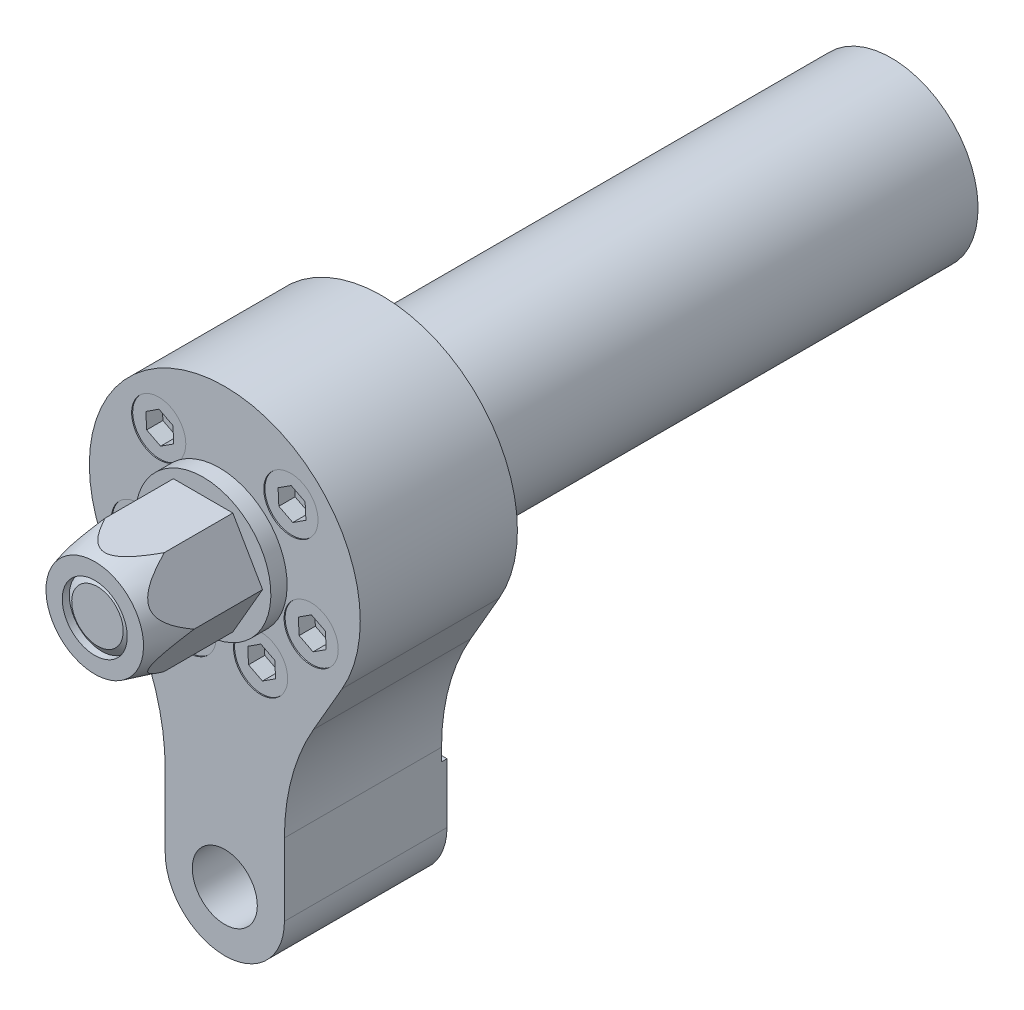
ISO-10303-21;
HEADER;
FILE_DESCRIPTION(('STEP AP214'),'2;1');
FILE_NAME('part.step','',(''),(''),'','','');
FILE_SCHEMA(('AUTOMOTIVE_DESIGN { 1 0 10303 214 1 1 1 1 }'));
ENDSEC;
DATA;
#1=APPLICATION_CONTEXT('core data for automotive mechanical design processes');
#2=APPLICATION_PROTOCOL_DEFINITION('international standard','automotive_design',2000,#1);
#3=PRODUCT_CONTEXT('',#1,'mechanical');
#4=PRODUCT('Part','Part','',(#3));
#5=PRODUCT_RELATED_PRODUCT_CATEGORY('part','',(#4));
#6=PRODUCT_DEFINITION_FORMATION('','',#4);
#7=PRODUCT_DEFINITION_CONTEXT('part definition',#1,'design');
#8=PRODUCT_DEFINITION('design','',#6,#7);
#9=PRODUCT_DEFINITION_SHAPE('','',#8);
#10=(LENGTH_UNIT() NAMED_UNIT(*) SI_UNIT(.MILLI.,.METRE.));
#11=(NAMED_UNIT(*) PLANE_ANGLE_UNIT() SI_UNIT($,.RADIAN.));
#12=(NAMED_UNIT(*) SI_UNIT($,.STERADIAN.) SOLID_ANGLE_UNIT());
#13=UNCERTAINTY_MEASURE_WITH_UNIT(LENGTH_MEASURE(1.E-05),#10,'distance_accuracy_value','');
#14=(GEOMETRIC_REPRESENTATION_CONTEXT(3) GLOBAL_UNCERTAINTY_ASSIGNED_CONTEXT((#13)) GLOBAL_UNIT_ASSIGNED_CONTEXT((#10,
#11,#12)) REPRESENTATION_CONTEXT('',''));
#15=CARTESIAN_POINT('',(0.,0.,0.));
#16=DIRECTION('',(0.,0.,1.));
#17=DIRECTION('',(1.,0.,0.));
#18=AXIS2_PLACEMENT_3D('',#15,#16,#17);
#19=CARTESIAN_POINT('',(-18.5065023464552,-5.28577035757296,76.8));
#20=DIRECTION('',(0.543019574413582,-0.839720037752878,0.));
#21=DIRECTION('',(0.839720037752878,0.543019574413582,0.));
#22=AXIS2_PLACEMENT_3D('',#19,#20,#21);
#23=PLANE('',#22);
#24=DIRECTION('',(0.,0.,1.));
#25=VECTOR('',#24,1.);
#26=CARTESIAN_POINT('',(-16.0824393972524,-3.71820787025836,76.8));
#27=LINE('',#26,#25);
#28=CARTESIAN_POINT('',(-16.0824393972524,-3.71820787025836,76.8));
#29=VERTEX_POINT('',#28);
#30=CARTESIAN_POINT('',(-16.0824393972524,-3.71820787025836,79.8));
#31=VERTEX_POINT('',#30);
#32=EDGE_CURVE('E24',#29,#31,#27,.T.);
#33=ORIENTED_EDGE('',*,*,#32,.T.);
#34=DIRECTION('',(0.839720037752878,0.543019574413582,0.));
#35=VECTOR('',#34,1.);
#36=CARTESIAN_POINT('',(-18.5065023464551,-5.28577035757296,79.8));
#37=LINE('',#36,#35);
#38=CARTESIAN_POINT('',(-18.5065023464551,-5.28577035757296,79.8));
#39=VERTEX_POINT('',#38);
#40=EDGE_CURVE('E33',#39,#31,#37,.T.);
#41=ORIENTED_EDGE('',*,*,#40,.F.);
#42=DIRECTION('',(0.,0.,1.));
#43=VECTOR('',#42,1.);
#44=CARTESIAN_POINT('',(-18.5065023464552,-5.28577035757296,76.8));
#45=LINE('',#44,#43);
#46=CARTESIAN_POINT('',(-18.5065023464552,-5.28577035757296,76.8));
#47=VERTEX_POINT('',#46);
#48=EDGE_CURVE('E1792',#47,#39,#45,.T.);
#49=ORIENTED_EDGE('',*,*,#48,.F.);
#50=DIRECTION('',(0.839720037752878,0.543019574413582,0.));
#51=VECTOR('',#50,1.);
#52=CARTESIAN_POINT('',(-18.5065023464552,-5.28577035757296,76.8));
#53=LINE('',#52,#51);
#54=EDGE_CURVE('E1795',#47,#29,#53,.T.);
#55=ORIENTED_EDGE('',*,*,#54,.T.);
#56=EDGE_LOOP('',(#33,#41,#49,#55));
#57=FACE_BOUND('',#56,.T.);
#58=ADVANCED_FACE('F14',(#57),#23,.T.);
#59=CARTESIAN_POINT('',(-13.5128589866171,-5.03372672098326,76.8));
#60=DIRECTION('',(0.455709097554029,0.890128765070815,0.));
#61=DIRECTION('',(-0.890128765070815,0.455709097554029,0.));
#62=AXIS2_PLACEMENT_3D('',#59,#60,#61);
#63=PLANE('',#62);
#64=DIRECTION('',(0.,0.,1.));
#65=VECTOR('',#64,1.);
#66=CARTESIAN_POINT('',(-13.5128589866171,-5.03372672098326,76.8));
#67=LINE('',#66,#65);
#68=CARTESIAN_POINT('',(-13.5128589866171,-5.03372672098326,76.8));
#69=VERTEX_POINT('',#68);
#70=CARTESIAN_POINT('',(-13.5128589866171,-5.03372672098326,79.8));
#71=VERTEX_POINT('',#70);
#72=EDGE_CURVE('E1780',#69,#71,#67,.T.);
#73=ORIENTED_EDGE('',*,*,#72,.T.);
#74=DIRECTION('',(-0.890128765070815,0.455709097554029,0.));
#75=VECTOR('',#74,1.);
#76=CARTESIAN_POINT('',(-13.5128589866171,-5.03372672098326,79.8));
#77=LINE('',#76,#75);
#78=EDGE_CURVE('E1814',#71,#31,#77,.T.);
#79=ORIENTED_EDGE('',*,*,#78,.T.);
#80=ORIENTED_EDGE('',*,*,#32,.F.);
#81=DIRECTION('',(-0.890128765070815,0.455709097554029,0.));
#82=VECTOR('',#81,1.);
#83=CARTESIAN_POINT('',(-13.5128589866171,-5.03372672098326,76.8));
#84=LINE('',#83,#82);
#85=EDGE_CURVE('E1798',#69,#29,#84,.T.);
#86=ORIENTED_EDGE('',*,*,#85,.F.);
#87=EDGE_LOOP('',(#73,#79,#80,#86));
#88=FACE_BOUND('',#87,.T.);
#89=ADVANCED_FACE('F489',(#88),#63,.F.);
#90=CARTESIAN_POINT('',(-13.3673415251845,-7.91680805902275,76.8));
#91=DIRECTION('',(0.998728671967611,0.0504087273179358,0.));
#92=DIRECTION('',(-0.0504087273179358,0.998728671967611,0.));
#93=AXIS2_PLACEMENT_3D('',#90,#91,#92);
#94=PLANE('',#93);
#95=DIRECTION('',(0.,0.,1.));
#96=VECTOR('',#95,1.);
#97=CARTESIAN_POINT('',(-13.3673415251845,-7.91680805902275,76.8));
#98=LINE('',#97,#96);
#99=CARTESIAN_POINT('',(-13.3673415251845,-7.91680805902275,76.8));
#100=VERTEX_POINT('',#99);
#101=CARTESIAN_POINT('',(-13.3673415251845,-7.91680805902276,79.8));
#102=VERTEX_POINT('',#101);
#103=EDGE_CURVE('E1783',#100,#102,#98,.T.);
#104=ORIENTED_EDGE('',*,*,#103,.T.);
#105=DIRECTION('',(-0.0504087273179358,0.998728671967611,0.));
#106=VECTOR('',#105,1.);
#107=CARTESIAN_POINT('',(-13.3673415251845,-7.91680805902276,79.8));
#108=LINE('',#107,#106);
#109=EDGE_CURVE('E1817',#102,#71,#108,.T.);
#110=ORIENTED_EDGE('',*,*,#109,.T.);
#111=ORIENTED_EDGE('',*,*,#72,.F.);
#112=DIRECTION('',(-0.0504087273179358,0.998728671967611,0.));
#113=VECTOR('',#112,1.);
#114=CARTESIAN_POINT('',(-13.3673415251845,-7.91680805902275,76.8));
#115=LINE('',#114,#113);
#116=EDGE_CURVE('E1802',#100,#69,#115,.T.);
#117=ORIENTED_EDGE('',*,*,#116,.F.);
#118=EDGE_LOOP('',(#104,#110,#111,#117));
#119=FACE_BOUND('',#118,.T.);
#120=ADVANCED_FACE('F494',(#119),#94,.F.);
#121=CARTESIAN_POINT('',(-13.3673415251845,-7.91680805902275,76.8));
#122=DIRECTION('',(-0.543019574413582,0.839720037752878,0.));
#123=DIRECTION('',(-0.839720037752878,-0.543019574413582,0.));
#124=AXIS2_PLACEMENT_3D('',#121,#122,#123);
#125=PLANE('',#124);
#126=DIRECTION('',(0.,0.,1.));
#127=VECTOR('',#126,1.);
#128=CARTESIAN_POINT('',(-15.7914044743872,-9.48437054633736,76.8));
#129=LINE('',#128,#127);
#130=CARTESIAN_POINT('',(-15.7914044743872,-9.48437054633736,76.8));
#131=VERTEX_POINT('',#130);
#132=CARTESIAN_POINT('',(-15.7914044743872,-9.48437054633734,79.8));
#133=VERTEX_POINT('',#132);
#134=EDGE_CURVE('E1786',#131,#133,#129,.T.);
#135=ORIENTED_EDGE('',*,*,#134,.T.);
#136=DIRECTION('',(-0.839720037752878,-0.543019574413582,0.));
#137=VECTOR('',#136,1.);
#138=CARTESIAN_POINT('',(-13.3673415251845,-7.91680805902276,79.8));
#139=LINE('',#138,#137);
#140=EDGE_CURVE('E1820',#102,#133,#139,.T.);
#141=ORIENTED_EDGE('',*,*,#140,.F.);
#142=ORIENTED_EDGE('',*,*,#103,.F.);
#143=DIRECTION('',(-0.839720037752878,-0.543019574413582,0.));
#144=VECTOR('',#143,1.);
#145=CARTESIAN_POINT('',(-13.3673415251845,-7.91680805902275,76.8));
#146=LINE('',#145,#144);
#147=EDGE_CURVE('E1805',#100,#131,#146,.T.);
#148=ORIENTED_EDGE('',*,*,#147,.T.);
#149=EDGE_LOOP('',(#135,#141,#142,#148));
#150=FACE_BOUND('',#149,.T.);
#151=ADVANCED_FACE('F508',(#150),#125,.T.);
#152=CARTESIAN_POINT('',(-18.3609848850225,-8.16885169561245,76.8));
#153=DIRECTION('',(-0.455709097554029,-0.890128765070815,0.));
#154=DIRECTION('',(0.890128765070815,-0.455709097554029,0.));
#155=AXIS2_PLACEMENT_3D('',#152,#153,#154);
#156=PLANE('',#155);
#157=DIRECTION('',(0.,0.,1.));
#158=VECTOR('',#157,1.);
#159=CARTESIAN_POINT('',(-18.3609848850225,-8.16885169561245,76.8));
#160=LINE('',#159,#158);
#161=CARTESIAN_POINT('',(-18.3609848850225,-8.16885169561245,76.8));
#162=VERTEX_POINT('',#161);
#163=CARTESIAN_POINT('',(-18.3609848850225,-8.16885169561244,79.8));
#164=VERTEX_POINT('',#163);
#165=EDGE_CURVE('E1789',#162,#164,#160,.T.);
#166=ORIENTED_EDGE('',*,*,#165,.T.);
#167=DIRECTION('',(0.890128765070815,-0.455709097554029,0.));
#168=VECTOR('',#167,1.);
#169=CARTESIAN_POINT('',(-18.3609848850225,-8.16885169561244,79.8));
#170=LINE('',#169,#168);
#171=EDGE_CURVE('E1823',#164,#133,#170,.T.);
#172=ORIENTED_EDGE('',*,*,#171,.T.);
#173=ORIENTED_EDGE('',*,*,#134,.F.);
#174=DIRECTION('',(0.890128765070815,-0.455709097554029,0.));
#175=VECTOR('',#174,1.);
#176=CARTESIAN_POINT('',(-18.3609848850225,-8.16885169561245,76.8));
#177=LINE('',#176,#175);
#178=EDGE_CURVE('E1808',#162,#131,#177,.T.);
#179=ORIENTED_EDGE('',*,*,#178,.F.);
#180=EDGE_LOOP('',(#166,#172,#173,#179));
#181=FACE_BOUND('',#180,.T.);
#182=ADVANCED_FACE('F503',(#181),#156,.F.);
#183=CARTESIAN_POINT('',(-18.5065023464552,-5.28577035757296,76.8));
#184=DIRECTION('',(-0.998728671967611,-0.0504087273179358,0.));
#185=DIRECTION('',(0.0504087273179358,-0.998728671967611,0.));
#186=AXIS2_PLACEMENT_3D('',#183,#184,#185);
#187=PLANE('',#186);
#188=DIRECTION('',(0.0504087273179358,-0.998728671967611,0.));
#189=VECTOR('',#188,1.);
#190=CARTESIAN_POINT('',(-18.5065023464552,-5.28577035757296,76.8));
#191=LINE('',#190,#189);
#192=EDGE_CURVE('E1794',#47,#162,#191,.T.);
#193=ORIENTED_EDGE('',*,*,#192,.F.);
#194=ORIENTED_EDGE('',*,*,#48,.T.);
#195=DIRECTION('',(0.0504087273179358,-0.998728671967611,0.));
#196=VECTOR('',#195,1.);
#197=CARTESIAN_POINT('',(-18.5065023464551,-5.28577035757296,79.8));
#198=LINE('',#197,#196);
#199=EDGE_CURVE('E1799',#39,#164,#198,.T.);
#200=ORIENTED_EDGE('',*,*,#199,.T.);
#201=ORIENTED_EDGE('',*,*,#165,.F.);
#202=EDGE_LOOP('',(#193,#194,#200,#201));
#203=FACE_BOUND('',#202,.T.);
#204=ADVANCED_FACE('F500',(#203),#187,.F.);
#205=CARTESIAN_POINT('',(-16.0824393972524,-3.71820787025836,76.8));
#206=DIRECTION('',(0.,0.,1.));
#207=DIRECTION('',(0.455709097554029,0.890128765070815,0.));
#208=AXIS2_PLACEMENT_3D('',#205,#206,#207);
#209=PLANE('',#208);
#210=ORIENTED_EDGE('',*,*,#54,.F.);
#211=ORIENTED_EDGE('',*,*,#192,.T.);
#212=ORIENTED_EDGE('',*,*,#178,.T.);
#213=ORIENTED_EDGE('',*,*,#147,.F.);
#214=ORIENTED_EDGE('',*,*,#116,.T.);
#215=ORIENTED_EDGE('',*,*,#85,.T.);
#216=EDGE_LOOP('',(#210,#211,#212,#213,#214,#215));
#217=FACE_BOUND('',#216,.T.);
#218=ADVANCED_FACE('F499',(#217),#209,.T.);
#219=CARTESIAN_POINT('',(-15.9369219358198,-6.60128920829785,79.8));
#220=DIRECTION('',(0.,0.,1.));
#221=DIRECTION('',(0.455709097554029,0.890128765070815,0.));
#222=AXIS2_PLACEMENT_3D('',#219,#220,#221);
#223=PLANE('',#222);
#224=CARTESIAN_POINT('',(-15.9369219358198,-6.60128920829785,79.8));
#225=DIRECTION('',(0.,0.,1.));
#226=DIRECTION('',(0.455709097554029,0.890128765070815,0.));
#227=AXIS2_PLACEMENT_3D('',#224,#225,#226);
#228=CIRCLE('',#227,5.);
#229=CARTESIAN_POINT('',(-13.6583764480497,-2.15064538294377,79.8));
#230=VERTEX_POINT('',#229);
#231=EDGE_CURVE('E9',#230,#230,#228,.T.);
#232=ORIENTED_EDGE('',*,*,#231,.T.);
#233=EDGE_LOOP('',(#232));
#234=FACE_BOUND('',#233,.T.);
#235=ORIENTED_EDGE('',*,*,#199,.F.);
#236=ORIENTED_EDGE('',*,*,#40,.T.);
#237=ORIENTED_EDGE('',*,*,#78,.F.);
#238=ORIENTED_EDGE('',*,*,#109,.F.);
#239=ORIENTED_EDGE('',*,*,#140,.T.);
#240=ORIENTED_EDGE('',*,*,#171,.F.);
#241=EDGE_LOOP('',(#235,#236,#237,#238,#239,#240));
#242=FACE_BOUND('',#241,.T.);
#243=ADVANCED_FACE('F505',(#234,#242),#223,.T.);
#244=CARTESIAN_POINT('',(0.,0.,103.5));
#245=DIRECTION('',(0.,0.,-1.));
#246=DIRECTION('',(0.994898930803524,-0.100876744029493,0.));
#247=AXIS2_PLACEMENT_3D('',#244,#245,#246);
#248=PLANE('',#247);
#249=CARTESIAN_POINT('',(0.,0.,103.5));
#250=DIRECTION('',(0.,0.,-1.));
#251=DIRECTION('',(0.994898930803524,-0.100876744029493,0.));
#252=AXIS2_PLACEMENT_3D('',#249,#250,#251);
#253=CIRCLE('',#252,4.75);
#254=CARTESIAN_POINT('',(4.72576992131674,-0.479164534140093,103.5));
#255=VERTEX_POINT('',#254);
#256=EDGE_CURVE('E1485',#255,#255,#253,.T.);
#257=ORIENTED_EDGE('',*,*,#256,.F.);
#258=EDGE_LOOP('',(#257));
#259=FACE_BOUND('',#258,.T.);
#260=ADVANCED_FACE('F518',(#259),#248,.F.);
#261=CARTESIAN_POINT('',(0.,0.,103.5));
#262=DIRECTION('',(0.,0.,-1.));
#263=DIRECTION('',(0.994898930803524,-0.100876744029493,0.));
#264=AXIS2_PLACEMENT_3D('',#261,#262,#263);
#265=CONICAL_SURFACE('',#264,4.75,1.00148313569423);
#266=CARTESIAN_POINT('',(0.,0.,102.7));
#267=DIRECTION('',(0.,0.,-1.));
#268=DIRECTION('',(0.994898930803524,-0.100876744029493,0.));
#269=AXIS2_PLACEMENT_3D('',#266,#267,#268);
#270=CIRCLE('',#269,6.);
#271=CARTESIAN_POINT('',(5.96939358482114,-0.605260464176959,102.7));
#272=VERTEX_POINT('',#271);
#273=EDGE_CURVE('E1483',#272,#272,#270,.T.);
#274=ORIENTED_EDGE('',*,*,#273,.F.);
#275=EDGE_LOOP('',(#274));
#276=FACE_BOUND('',#275,.T.);
#277=ORIENTED_EDGE('',*,*,#256,.T.);
#278=EDGE_LOOP('',(#277));
#279=FACE_BOUND('',#278,.T.);
#280=ADVANCED_FACE('F684',(#276,#279),#265,.T.);
#281=CARTESIAN_POINT('',(0.,0.,102.5));
#282=DIRECTION('',(0.,0.,1.));
#283=DIRECTION('',(0.,-1.,0.));
#284=AXIS2_PLACEMENT_3D('',#281,#282,#283);
#285=CYLINDRICAL_SURFACE('',#284,6.);
#286=CARTESIAN_POINT('',(0.,0.,104.));
#287=DIRECTION('',(0.,0.,1.));
#288=DIRECTION('',(0.,-1.,0.));
#289=AXIS2_PLACEMENT_3D('',#286,#287,#288);
#290=CIRCLE('',#289,6.);
#291=CARTESIAN_POINT('',(0.,-6.,104.));
#292=VERTEX_POINT('',#291);
#293=EDGE_CURVE('E361',#292,#292,#290,.T.);
#294=ORIENTED_EDGE('',*,*,#293,.T.);
#295=EDGE_LOOP('',(#294));
#296=FACE_BOUND('',#295,.T.);
#297=ORIENTED_EDGE('',*,*,#273,.T.);
#298=EDGE_LOOP('',(#297));
#299=FACE_BOUND('',#298,.T.);
#300=ADVANCED_FACE('F687',(#296,#299),#285,.F.);
#301=CARTESIAN_POINT('',(5.48482755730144,-9.5,104.));
#302=DIRECTION('',(0.,0.,-1.));
#303=DIRECTION('',(0.,1.,0.));
#304=AXIS2_PLACEMENT_3D('',#301,#302,#303);
#305=PLANE('',#304);
#306=ORIENTED_EDGE('',*,*,#293,.F.);
#307=EDGE_LOOP('',(#306));
#308=FACE_BOUND('',#307,.T.);
#309=CARTESIAN_POINT('',(0.,0.,104.));
#310=DIRECTION('',(0.,0.,-1.));
#311=DIRECTION('',(0.,1.,0.));
#312=AXIS2_PLACEMENT_3D('',#309,#310,#311);
#313=CIRCLE('',#312,9.);
#314=CARTESIAN_POINT('',(0.,9.,104.));
#315=VERTEX_POINT('',#314);
#316=EDGE_CURVE('E366',#315,#315,#313,.T.);
#317=ORIENTED_EDGE('',*,*,#316,.F.);
#318=EDGE_LOOP('',(#317));
#319=FACE_BOUND('',#318,.T.);
#320=ADVANCED_FACE('F694',(#308,#319),#305,.F.);
#321=CARTESIAN_POINT('',(0.,0.,104.));
#322=DIRECTION('',(0.,0.,-1.));
#323=DIRECTION('',(0.,1.,0.));
#324=AXIS2_PLACEMENT_3D('',#321,#322,#323);
#325=CONICAL_SURFACE('',#324,9.,0.261799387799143);
#326=ORIENTED_EDGE('',*,*,#316,.T.);
#327=EDGE_LOOP('',(#326));
#328=FACE_BOUND('',#327,.T.);
#329=CARTESIAN_POINT('',(5.48477396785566,9.50009281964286,96.6489470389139));
#330=CARTESIAN_POINT('',(5.52140411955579,9.43664753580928,96.785646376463));
#331=CARTESIAN_POINT('',(5.55845781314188,9.37246865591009,96.9218905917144));
#332=CARTESIAN_POINT('',(5.63351038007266,9.24247379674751,97.1933482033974));
#333=CARTESIAN_POINT('',(5.67150933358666,9.17665767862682,97.3285615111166));
#334=CARTESIAN_POINT('',(5.7872004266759,8.97627482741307,97.7329238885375));
#335=CARTESIAN_POINT('',(5.86645564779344,8.83900075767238,98.0003024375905));
#336=CARTESIAN_POINT('',(6.03108079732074,8.55386163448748,98.531840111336));
#337=CARTESIAN_POINT('',(6.11651202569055,8.40589040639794,98.7959236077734));
#338=CARTESIAN_POINT('',(6.29400864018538,8.09845725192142,99.3148633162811));
#339=CARTESIAN_POINT('',(6.38606866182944,7.93900461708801,99.5697267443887));
#340=CARTESIAN_POINT('',(6.5279906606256,7.69318850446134,99.9349353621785));
#341=CARTESIAN_POINT('',(6.57447101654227,7.6126821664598,100.050540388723));
#342=CARTESIAN_POINT('',(6.66967254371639,7.44778828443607,100.278040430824));
#343=CARTESIAN_POINT('',(6.71839397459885,7.36340029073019,100.389935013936));
#344=CARTESIAN_POINT('',(6.81836528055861,7.19024490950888,100.609013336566));
#345=CARTESIAN_POINT('',(6.86961351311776,7.10148036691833,100.716200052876));
#346=CARTESIAN_POINT('',(6.97503097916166,6.91889195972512,100.924631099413));
#347=CARTESIAN_POINT('',(7.02919960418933,6.82506914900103,101.025876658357));
#348=CARTESIAN_POINT('',(7.17259272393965,6.57670498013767,101.276159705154));
#349=CARTESIAN_POINT('',(7.26426902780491,6.41791696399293,101.41971983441));
#350=CARTESIAN_POINT('',(7.4572676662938,6.08363351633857,101.678122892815));
#351=CARTESIAN_POINT('',(7.55856078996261,5.90818867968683,101.793049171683));
#352=CARTESIAN_POINT('',(7.73568046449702,5.60140840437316,101.948502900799));
#353=CARTESIAN_POINT('',(7.80882479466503,5.47471870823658,102.001064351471));
#354=CARTESIAN_POINT('',(7.95843191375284,5.21559157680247,102.081593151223));
#355=CARTESIAN_POINT('',(8.03489015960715,5.0831620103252,102.109593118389));
#356=CARTESIAN_POINT('',(8.18956368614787,4.81525960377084,102.137572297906));
#357=CARTESIAN_POINT('',(8.26778647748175,4.6797737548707,102.137391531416));
#358=CARTESIAN_POINT('',(8.42290740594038,4.41109642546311,102.108641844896));
#359=CARTESIAN_POINT('',(8.49980470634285,4.27790639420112,102.080055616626));
#360=CARTESIAN_POINT('',(8.66600981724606,3.99003069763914,101.989492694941));
#361=CARTESIAN_POINT('',(8.75451388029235,3.83673716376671,101.921744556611));
#362=CARTESIAN_POINT('',(8.9250208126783,3.54141049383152,101.759068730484));
#363=CARTESIAN_POINT('',(9.00700829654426,3.39940400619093,101.664079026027));
#364=CARTESIAN_POINT('',(9.15571704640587,3.14183289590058,101.46665369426));
#365=CARTESIAN_POINT('',(9.22312154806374,3.02508487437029,101.36622597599));
#366=CARTESIAN_POINT('',(9.35342948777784,2.79938490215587,101.154196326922));
#367=CARTESIAN_POINT('',(9.41632882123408,2.69044006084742,101.04258442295));
#368=CARTESIAN_POINT('',(9.53860327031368,2.47865450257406,100.810311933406));
#369=CARTESIAN_POINT('',(9.59795050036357,2.37586208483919,100.689593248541));
#370=CARTESIAN_POINT('',(9.71319638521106,2.17625035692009,100.441879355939));
#371=CARTESIAN_POINT('',(9.7690964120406,2.07942867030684,100.314886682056));
#372=CARTESIAN_POINT('',(9.88120706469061,1.88524732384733,100.048320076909));
#373=CARTESIAN_POINT('',(9.93723888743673,1.78819736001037,99.9084469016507));
#374=CARTESIAN_POINT('',(10.0465134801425,1.59892821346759,99.6243936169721));
#375=CARTESIAN_POINT('',(10.0997557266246,1.50670993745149,99.4802127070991));
#376=CARTESIAN_POINT('',(10.2560364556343,1.23602377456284,99.0422195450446));
#377=CARTESIAN_POINT('',(10.355491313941,1.06376290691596,98.7432937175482));
#378=CARTESIAN_POINT('',(10.5436360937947,0.737886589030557,98.1477355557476));
#379=CARTESIAN_POINT('',(10.6325885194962,0.583816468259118,97.8514296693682));
#380=CARTESIAN_POINT('',(10.7619316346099,0.359787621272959,97.4029441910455));
#381=CARTESIAN_POINT('',(10.8042989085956,0.286405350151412,97.2530271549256));
#382=CARTESIAN_POINT('',(10.8878539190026,0.141683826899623,96.9519078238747));
#383=CARTESIAN_POINT('',(10.92904180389,0.0703443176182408,96.8007056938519));
#384=CARTESIAN_POINT('',(10.9697087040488,-9.28196430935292E-05,96.6489470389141));
#385=B_SPLINE_CURVE_WITH_KNOTS('',3,(#329,#330,#331,#332,#333,#334,#335,#336,#337,#338,#339,
#340,#341,#342,#343,#344,#345,#346,#347,#348,#349,#350,#351,#352,#353,#354,#355,#356,#357,#358,
#359,#360,#361,#362,#363,#364,#365,#366,#367,#368,#369,#370,#371,#372,#373,#374,#375,#376,#377,
#378,#379,#380,#381,#382,#383,#384),.UNSPECIFIED.,.F.,.F.,(4,2,2,2,2,2,2,2,2,2,2,2,2,2,2,2,2,2,
2,2,2,2,2,2,2,2,2,4),(0.,0.46527166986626,0.930582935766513,1.86288009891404,2.80621835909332,
3.74880160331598,4.19374668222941,4.6387434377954,5.08345464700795,5.52807355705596,
6.22496409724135,6.91980172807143,7.38441639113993,7.84841309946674,8.31504396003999,
8.78195932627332,9.34736634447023,9.9140708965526,10.417652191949,10.9216866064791,
11.4292645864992,11.9366392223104,12.4741532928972,13.0117678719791,14.0882991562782,
15.124886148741,15.6414873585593,16.1580232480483),.UNSPECIFIED.);
#386=CARTESIAN_POINT('',(5.48482755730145,9.5,96.6491470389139));
#387=VERTEX_POINT('',#386);
#388=CARTESIAN_POINT('',(10.9696551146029,0.,96.6491470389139));
#389=VERTEX_POINT('',#388);
#390=EDGE_CURVE('E739',#387,#389,#385,.T.);
#391=ORIENTED_EDGE('',*,*,#390,.F.);
#392=CARTESIAN_POINT('',(-10.5930853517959,9.5,84.4852353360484));
#393=CARTESIAN_POINT('',(-10.3867862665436,9.5,85.0582720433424));
#394=CARTESIAN_POINT('',(-10.1781960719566,9.5,85.6304959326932));
#395=CARTESIAN_POINT('',(-9.75531618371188,9.5,86.7729685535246));
#396=CARTESIAN_POINT('',(-9.54102530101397,9.5,87.3432168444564));
#397=CARTESIAN_POINT('',(-9.10382949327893,9.5,88.4860699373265));
#398=CARTESIAN_POINT('',(-8.88086608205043,9.5,89.0586524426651));
#399=CARTESIAN_POINT('',(-8.42656753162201,9.5,90.2003990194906));
#400=CARTESIAN_POINT('',(-8.19523355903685,9.5,90.7695635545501));
#401=CARTESIAN_POINT('',(-7.69638648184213,9.5,91.9651862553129));
#402=CARTESIAN_POINT('',(-7.42767382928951,9.5,92.5911483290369));
#403=CARTESIAN_POINT('',(-7.01176021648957,9.5,93.5245512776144));
#404=CARTESIAN_POINT('',(-6.87094481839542,9.5,93.8348389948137));
#405=CARTESIAN_POINT('',(-6.58430638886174,9.5,94.453088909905));
#406=CARTESIAN_POINT('',(-6.43848350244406,9.5,94.7610511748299));
#407=CARTESIAN_POINT('',(-6.14151865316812,9.5,95.3728776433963));
#408=CARTESIAN_POINT('',(-5.99040045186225,9.5,95.6767533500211));
#409=CARTESIAN_POINT('',(-5.68113249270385,9.5,96.2808941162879));
#410=CARTESIAN_POINT('',(-5.52298323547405,9.5,96.5811594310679));
#411=CARTESIAN_POINT('',(-5.19822051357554,9.5,97.176791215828));
#412=CARTESIAN_POINT('',(-5.03161371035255,9.5,97.4721613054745));
#413=CARTESIAN_POINT('',(-4.68775946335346,9.5,98.0566144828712));
#414=CARTESIAN_POINT('',(-4.51051470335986,9.5,98.3456991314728));
#415=CARTESIAN_POINT('',(-4.25847143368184,9.5,98.7355351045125));
#416=CARTESIAN_POINT('',(-4.18955111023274,9.5,98.8400955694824));
#417=CARTESIAN_POINT('',(-4.04964371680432,9.5,99.0478279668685));
#418=CARTESIAN_POINT('',(-3.97865658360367,9.5,99.1509998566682));
#419=CARTESIAN_POINT('',(-3.76219828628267,9.5,99.4582448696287));
#420=CARTESIAN_POINT('',(-3.61330113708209,9.5,99.6599365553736));
#421=CARTESIAN_POINT('',(-3.30570634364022,9.5,100.052671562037));
#422=CARTESIAN_POINT('',(-3.14711585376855,9.5,100.243798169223));
#423=CARTESIAN_POINT('',(-2.81619521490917,9.5,100.61364851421));
#424=CARTESIAN_POINT('',(-2.6438790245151,9.5,100.792384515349));
#425=CARTESIAN_POINT('',(-2.3171328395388,9.5,101.098374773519));
#426=CARTESIAN_POINT('',(-2.16577693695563,9.5,101.228867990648));
#427=CARTESIAN_POINT('',(-1.84943658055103,9.5,101.47300937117));
#428=CARTESIAN_POINT('',(-1.68443082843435,9.5,101.586630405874));
#429=CARTESIAN_POINT('',(-1.3365493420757,9.5,101.79060023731));
#430=CARTESIAN_POINT('',(-1.15343980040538,9.5,101.880568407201));
#431=CARTESIAN_POINT('',(-0.868668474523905,9.5,101.987805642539));
#432=CARTESIAN_POINT('',(-0.772184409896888,9.5,102.018911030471));
#433=CARTESIAN_POINT('',(-0.576470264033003,9.5,102.070628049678));
#434=CARTESIAN_POINT('',(-0.477241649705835,9.5,102.09124517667));
#435=CARTESIAN_POINT('',(-0.231365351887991,9.5,102.127603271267));
#436=CARTESIAN_POINT('',(-0.0836886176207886,9.5,102.13685521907));
#437=CARTESIAN_POINT('',(0.211017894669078,9.5,102.12950171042));
#438=CARTESIAN_POINT('',(0.358047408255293,9.5,102.112886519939));
#439=CARTESIAN_POINT('',(0.646523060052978,9.5,102.056020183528));
#440=CARTESIAN_POINT('',(0.787994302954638,9.5,102.015892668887));
#441=CARTESIAN_POINT('',(1.06373187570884,9.5,101.916094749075));
#442=CARTESIAN_POINT('',(1.19799615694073,9.5,101.856418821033));
#443=CARTESIAN_POINT('',(1.44574007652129,9.5,101.728399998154));
#444=CARTESIAN_POINT('',(1.55996843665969,9.5,101.661474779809));
#445=CARTESIAN_POINT('',(1.78215011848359,9.5,101.517828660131));
#446=CARTESIAN_POINT('',(1.89009841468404,9.5,101.441100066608));
#447=CARTESIAN_POINT('',(2.10050135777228,9.5,101.279714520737));
#448=CARTESIAN_POINT('',(2.20293315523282,9.5,101.195028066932));
#449=CARTESIAN_POINT('',(2.40241915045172,9.5,101.019647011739));
#450=CARTESIAN_POINT('',(2.49947492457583,9.5,100.928954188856));
#451=CARTESIAN_POINT('',(2.73414563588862,9.5,100.698256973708));
#452=CARTESIAN_POINT('',(2.8689611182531,9.5,100.555411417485));
#453=CARTESIAN_POINT('',(3.13002980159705,9.5,100.262051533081));
#454=CARTESIAN_POINT('',(3.25627818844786,9.5,100.111532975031));
#455=CARTESIAN_POINT('',(3.50179075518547,9.5,99.8044804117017));
#456=CARTESIAN_POINT('',(3.62104165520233,9.5,99.6479358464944));
#457=CARTESIAN_POINT('',(3.85346172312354,9.5,99.3303893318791));
#458=CARTESIAN_POINT('',(3.96663011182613,9.5,99.169386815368));
#459=CARTESIAN_POINT('',(4.18907157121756,9.5,98.8419762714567));
#460=CARTESIAN_POINT('',(4.29828386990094,9.5,98.6755271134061));
#461=CARTESIAN_POINT('',(4.51216387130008,9.5,98.3397339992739));
#462=CARTESIAN_POINT('',(4.61683137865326,9.5,98.1703899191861));
#463=CARTESIAN_POINT('',(4.82209575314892,9.5,97.8295608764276));
#464=CARTESIAN_POINT('',(4.92269778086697,9.5,97.6580790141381));
#465=CARTESIAN_POINT('',(5.12046278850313,9.5,97.3131585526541));
#466=CARTESIAN_POINT('',(5.21762590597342,9.5,97.1397200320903));
#467=CARTESIAN_POINT('',(5.54258667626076,9.5,96.5477669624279));
#468=CARTESIAN_POINT('',(5.76327055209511,9.5,96.1253412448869));
#469=CARTESIAN_POINT('',(6.19163008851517,9.5,95.2739194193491));
#470=CARTESIAN_POINT('',(6.39930328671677,9.5,94.8449220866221));
#471=CARTESIAN_POINT('',(6.80452894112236,9.5,93.9818863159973));
#472=CARTESIAN_POINT('',(7.00207547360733,9.5,93.547845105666));
#473=CARTESIAN_POINT('',(7.38893726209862,9.5,92.6761064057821));
#474=CARTESIAN_POINT('',(7.57825222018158,9.5,92.2384087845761));
#475=CARTESIAN_POINT('',(7.95071358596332,9.5,91.3587559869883));
#476=CARTESIAN_POINT('',(8.13383837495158,9.5,90.916791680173));
#477=CARTESIAN_POINT('',(8.49441316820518,9.5,90.0305513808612));
#478=CARTESIAN_POINT('',(8.67186308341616,9.5,89.5862753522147));
#479=CARTESIAN_POINT('',(9.0218958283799,9.5,88.6959980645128));
#480=CARTESIAN_POINT('',(9.194480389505,9.5,88.2499974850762));
#481=CARTESIAN_POINT('',(9.53553537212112,9.5,87.3564246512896));
#482=CARTESIAN_POINT('',(9.70400576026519,9.5,86.908852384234));
#483=CARTESIAN_POINT('',(10.1663281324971,9.5,85.6657059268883));
#484=CARTESIAN_POINT('',(10.4563743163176,9.5,84.8687160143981));
#485=CARTESIAN_POINT('',(11.0276878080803,9.5,83.2715157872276));
#486=CARTESIAN_POINT('',(11.30895420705,9.5,82.4713051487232));
#487=CARTESIAN_POINT('',(11.862634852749,9.5,80.8733796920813));
#488=CARTESIAN_POINT('',(12.1350931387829,9.5,80.0756801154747));
#489=CARTESIAN_POINT('',(12.5394021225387,9.5,78.8777208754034));
#490=CARTESIAN_POINT('',(12.6734326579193,9.5,78.4781946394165));
#491=CARTESIAN_POINT('',(12.9401612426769,9.5,77.6786991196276));
#492=CARTESIAN_POINT('',(13.0728592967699,9.5,77.2787298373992));
#493=CARTESIAN_POINT('',(13.2049516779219,9.5,76.8785604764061));
#494=B_SPLINE_CURVE_WITH_KNOTS('',3,(#392,#393,#394,#395,#396,#397,#398,#399,#400,#401,#402,
#403,#404,#405,#406,#407,#408,#409,#410,#411,#412,#413,#414,#415,#416,#417,#418,#419,#420,#421,
#422,#423,#424,#425,#426,#427,#428,#429,#430,#431,#432,#433,#434,#435,#436,#437,#438,#439,#440,
#441,#442,#443,#444,#445,#446,#447,#448,#449,#450,#451,#452,#453,#454,#455,#456,#457,#458,#459,
#460,#461,#462,#463,#464,#465,#466,#467,#468,#469,#470,#471,#472,#473,#474,#475,#476,#477,#478,
#479,#480,#481,#482,#483,#484,#485,#486,#487,#488,#489,#490,#491,#492,#493),.UNSPECIFIED.,.F.,
.F.,(4,2,2,2,2,2,2,2,2,2,2,2,2,2,2,2,2,2,2,2,2,2,2,2,2,2,2,2,2,2,2,2,2,2,2,2,2,2,2,2,2,2,2,2,2,
2,2,2,2,2,4),(0.,1.8271332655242,3.65465066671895,5.49797926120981,7.34105193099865,
9.38443436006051,10.4066360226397,11.4288081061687,12.4468675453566,13.4648546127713,
14.4820519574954,15.498993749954,15.874666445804,16.2503506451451,17.0021133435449,
17.746697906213,18.4905346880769,19.0891789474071,19.6887755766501,20.2975003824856,
20.6011206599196,20.9045816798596,21.3461445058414,21.7878735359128,22.2273004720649,
22.6668516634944,23.063430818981,23.4603230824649,23.8587495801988,24.257058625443,
24.8458435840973,25.4349567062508,26.0251539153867,26.6154265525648,27.2125787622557,
27.8097566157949,28.4061509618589,29.0025214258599,30.431961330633,31.861670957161,
33.2922075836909,34.7227959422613,36.1579506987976,37.5931279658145,39.0277878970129,
40.4624594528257,43.0067672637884,45.5513376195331,48.0801468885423,49.3443715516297,
50.6085917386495),.UNSPECIFIED.);
#495=CARTESIAN_POINT('',(-5.48482755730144,9.5,96.6491470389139));
#496=VERTEX_POINT('',#495);
#497=EDGE_CURVE('E732',#496,#387,#494,.T.);
#498=ORIENTED_EDGE('',*,*,#497,.F.);
#499=CARTESIAN_POINT('',(-10.9697087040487,-9.28196428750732E-05,96.6489470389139));
#500=CARTESIAN_POINT('',(-10.9330785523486,0.0633524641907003,96.785646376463));
#501=CARTESIAN_POINT('',(-10.8960248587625,0.127531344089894,96.9218905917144));
#502=CARTESIAN_POINT('',(-10.8209722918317,0.257526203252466,97.1933482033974));
#503=CARTESIAN_POINT('',(-10.7829733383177,0.32334232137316,97.3285615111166));
#504=CARTESIAN_POINT('',(-10.6672822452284,0.523725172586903,97.7329238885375));
#505=CARTESIAN_POINT('',(-10.5880270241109,0.660999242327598,98.0003024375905));
#506=CARTESIAN_POINT('',(-10.4234018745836,0.946138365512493,98.531840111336));
#507=CARTESIAN_POINT('',(-10.3379706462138,1.09410959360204,98.7959236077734));
#508=CARTESIAN_POINT('',(-10.160474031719,1.40154274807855,99.3148633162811));
#509=CARTESIAN_POINT('',(-10.0684140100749,1.56099538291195,99.5697267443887));
#510=CARTESIAN_POINT('',(-9.92649201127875,1.80681149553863,99.9349353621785));
#511=CARTESIAN_POINT('',(-9.88001165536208,1.88731783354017,100.050540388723));
#512=CARTESIAN_POINT('',(-9.78481012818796,2.0522117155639,100.278040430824));
#513=CARTESIAN_POINT('',(-9.7360886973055,2.13659970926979,100.389935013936));
#514=CARTESIAN_POINT('',(-9.63611739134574,2.30975509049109,100.609013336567));
#515=CARTESIAN_POINT('',(-9.5848691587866,2.39851963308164,100.716200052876));
#516=CARTESIAN_POINT('',(-9.47945169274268,2.58110804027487,100.924631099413));
#517=CARTESIAN_POINT('',(-9.42528306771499,2.67493085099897,101.025876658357));
#518=CARTESIAN_POINT('',(-9.28188994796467,2.92329501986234,101.276159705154));
#519=CARTESIAN_POINT('',(-9.19021364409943,3.08208303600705,101.41971983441));
#520=CARTESIAN_POINT('',(-8.99721500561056,3.4163664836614,101.678122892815));
#521=CARTESIAN_POINT('',(-8.89592188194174,3.59181132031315,101.793049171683));
#522=CARTESIAN_POINT('',(-8.71880220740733,3.89859159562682,101.948502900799));
#523=CARTESIAN_POINT('',(-8.64565787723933,4.02528129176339,102.001064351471));
#524=CARTESIAN_POINT('',(-8.49605075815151,4.2844084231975,102.081593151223));
#525=CARTESIAN_POINT('',(-8.41959251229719,4.41683798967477,102.109593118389));
#526=CARTESIAN_POINT('',(-8.26491898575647,4.68474039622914,102.137572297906));
#527=CARTESIAN_POINT('',(-8.18669619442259,4.82022624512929,102.137391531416));
#528=CARTESIAN_POINT('',(-8.03157526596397,5.08890357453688,102.108641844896));
#529=CARTESIAN_POINT('',(-7.95467796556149,5.22209360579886,102.080055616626));
#530=CARTESIAN_POINT('',(-7.78847285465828,5.50996930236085,101.989492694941));
#531=CARTESIAN_POINT('',(-7.69996879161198,5.6632628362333,101.921744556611));
#532=CARTESIAN_POINT('',(-7.52946185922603,5.95858950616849,101.759068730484));
#533=CARTESIAN_POINT('',(-7.44747437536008,6.10059599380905,101.664079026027));
#534=CARTESIAN_POINT('',(-7.29876562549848,6.3581671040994,101.46665369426));
#535=CARTESIAN_POINT('',(-7.23136112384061,6.47491512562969,101.36622597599));
#536=CARTESIAN_POINT('',(-7.10105318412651,6.70061509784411,101.154196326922));
#537=CARTESIAN_POINT('',(-7.03815385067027,6.80955993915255,101.042584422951));
#538=CARTESIAN_POINT('',(-6.91587940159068,7.02134549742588,100.810311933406));
#539=CARTESIAN_POINT('',(-6.85653217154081,7.12413791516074,100.689593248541));
#540=CARTESIAN_POINT('',(-6.7412862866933,7.32374964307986,100.441879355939));
#541=CARTESIAN_POINT('',(-6.68538625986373,7.42057132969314,100.314886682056));
#542=CARTESIAN_POINT('',(-6.57327560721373,7.61475267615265,100.048320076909));
#543=CARTESIAN_POINT('',(-6.51724378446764,7.71180263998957,99.9084469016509));
#544=CARTESIAN_POINT('',(-6.40796919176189,7.90107178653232,99.6243936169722));
#545=CARTESIAN_POINT('',(-6.35472694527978,7.99329006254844,99.4802127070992));
#546=CARTESIAN_POINT('',(-6.1984462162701,8.26397622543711,99.0422195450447));
#547=CARTESIAN_POINT('',(-6.09899135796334,8.43623709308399,98.7432937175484));
#548=CARTESIAN_POINT('',(-5.91084657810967,8.7621134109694,98.1477355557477));
#549=CARTESIAN_POINT('',(-5.82189415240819,8.91618353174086,97.8514296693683));
#550=CARTESIAN_POINT('',(-5.69255103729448,9.14021237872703,97.4029441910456));
#551=CARTESIAN_POINT('',(-5.65018376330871,9.21359464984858,97.2530271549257));
#552=CARTESIAN_POINT('',(-5.56662875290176,9.35831617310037,96.9519078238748));
#553=CARTESIAN_POINT('',(-5.5254408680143,9.42965568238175,96.8007056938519));
#554=CARTESIAN_POINT('',(-5.48477396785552,9.50009281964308,96.6489470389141));
#555=B_SPLINE_CURVE_WITH_KNOTS('',3,(#499,#500,#501,#502,#503,#504,#505,#506,#507,#508,#509,
#510,#511,#512,#513,#514,#515,#516,#517,#518,#519,#520,#521,#522,#523,#524,#525,#526,#527,#528,
#529,#530,#531,#532,#533,#534,#535,#536,#537,#538,#539,#540,#541,#542,#543,#544,#545,#546,#547,
#548,#549,#550,#551,#552,#553,#554),.UNSPECIFIED.,.F.,.F.,(4,2,2,2,2,2,2,2,2,2,2,2,2,2,2,2,2,2,
2,2,2,2,2,2,2,2,2,4),(0.,0.465271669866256,0.930582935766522,1.86288009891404,2.80621835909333,
3.74880160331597,4.19374668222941,4.6387434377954,5.08345464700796,5.52807355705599,
6.22496409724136,6.91980172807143,7.38441639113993,7.84841309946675,8.31504396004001,
8.78195932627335,9.34736634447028,9.91407089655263,10.417652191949,10.921686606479,
11.4292645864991,11.9366392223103,12.4741532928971,13.011767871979,14.0882991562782,
15.124886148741,15.6414873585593,16.1580232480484),.UNSPECIFIED.);
#556=CARTESIAN_POINT('',(-10.9696551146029,0.,96.6491470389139));
#557=VERTEX_POINT('',#556);
#558=EDGE_CURVE('E725',#557,#496,#555,.T.);
#559=ORIENTED_EDGE('',*,*,#558,.F.);
#560=CARTESIAN_POINT('',(-5.48477396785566,-9.50009281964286,96.6489470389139));
#561=CARTESIAN_POINT('',(-5.52140411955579,-9.43664753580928,96.785646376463));
#562=CARTESIAN_POINT('',(-5.55845781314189,-9.37246865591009,96.9218905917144));
#563=CARTESIAN_POINT('',(-5.63351038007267,-9.24247379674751,97.1933482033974));
#564=CARTESIAN_POINT('',(-5.67150933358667,-9.17665767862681,97.3285615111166));
#565=CARTESIAN_POINT('',(-5.78720042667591,-8.97627482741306,97.7329238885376));
#566=CARTESIAN_POINT('',(-5.86645564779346,-8.83900075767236,98.0003024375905));
#567=CARTESIAN_POINT('',(-6.03108079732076,-8.55386163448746,98.531840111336));
#568=CARTESIAN_POINT('',(-6.11651202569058,-8.40589040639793,98.7959236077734));
#569=CARTESIAN_POINT('',(-6.29400864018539,-8.09845725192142,99.3148633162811));
#570=CARTESIAN_POINT('',(-6.38606866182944,-7.93900461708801,99.5697267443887));
#571=CARTESIAN_POINT('',(-6.5279906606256,-7.69318850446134,99.9349353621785));
#572=CARTESIAN_POINT('',(-6.57447101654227,-7.61268216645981,100.050540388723));
#573=CARTESIAN_POINT('',(-6.66967254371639,-7.4477882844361,100.278040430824));
#574=CARTESIAN_POINT('',(-6.71839397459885,-7.36340029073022,100.389935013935));
#575=CARTESIAN_POINT('',(-6.81836528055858,-7.19024490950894,100.609013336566));
#576=CARTESIAN_POINT('',(-6.86961351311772,-7.10148036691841,100.716200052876));
#577=CARTESIAN_POINT('',(-6.97503097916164,-6.91889195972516,100.924631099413));
#578=CARTESIAN_POINT('',(-7.02919960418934,-6.82506914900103,101.025876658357));
#579=CARTESIAN_POINT('',(-7.17259272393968,-6.57670498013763,101.276159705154));
#580=CARTESIAN_POINT('',(-7.26426902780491,-6.41791696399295,101.41971983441));
#581=CARTESIAN_POINT('',(-7.45726766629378,-6.08363351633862,101.678122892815));
#582=CARTESIAN_POINT('',(-7.55856078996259,-5.90818867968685,101.793049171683));
#583=CARTESIAN_POINT('',(-7.73568046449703,-5.60140840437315,101.948502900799));
#584=CARTESIAN_POINT('',(-7.80882479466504,-5.47471870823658,102.001064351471));
#585=CARTESIAN_POINT('',(-7.95843191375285,-5.21559157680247,102.081593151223));
#586=CARTESIAN_POINT('',(-8.03489015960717,-5.0831620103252,102.109593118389));
#587=CARTESIAN_POINT('',(-8.18956368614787,-4.81525960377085,102.137572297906));
#588=CARTESIAN_POINT('',(-8.26778647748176,-4.6797737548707,102.137391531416));
#589=CARTESIAN_POINT('',(-8.42290740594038,-4.41109642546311,102.108641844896));
#590=CARTESIAN_POINT('',(-8.49980470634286,-4.27790639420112,102.080055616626));
#591=CARTESIAN_POINT('',(-8.66600981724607,-3.99003069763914,101.989492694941));
#592=CARTESIAN_POINT('',(-8.75451388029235,-3.83673716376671,101.921744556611));
#593=CARTESIAN_POINT('',(-8.92502081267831,-3.54141049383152,101.759068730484));
#594=CARTESIAN_POINT('',(-9.00700829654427,-3.39940400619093,101.664079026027));
#595=CARTESIAN_POINT('',(-9.15571704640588,-3.14183289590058,101.46665369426));
#596=CARTESIAN_POINT('',(-9.22312154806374,-3.0250848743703,101.36622597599));
#597=CARTESIAN_POINT('',(-9.35342948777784,-2.79938490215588,101.154196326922));
#598=CARTESIAN_POINT('',(-9.41632882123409,-2.69044006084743,101.04258442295));
#599=CARTESIAN_POINT('',(-9.53860327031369,-2.47865450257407,100.810311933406));
#600=CARTESIAN_POINT('',(-9.59795050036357,-2.3758620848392,100.689593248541));
#601=CARTESIAN_POINT('',(-9.71319638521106,-2.17625035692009,100.441879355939));
#602=CARTESIAN_POINT('',(-9.76909641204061,-2.07942867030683,100.314886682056));
#603=CARTESIAN_POINT('',(-9.88120706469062,-1.88524732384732,100.048320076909));
#604=CARTESIAN_POINT('',(-9.93723888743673,-1.78819736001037,99.9084469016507));
#605=CARTESIAN_POINT('',(-10.0465134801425,-1.5989282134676,99.624393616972));
#606=CARTESIAN_POINT('',(-10.0997557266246,-1.5067099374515,99.4802127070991));
#607=CARTESIAN_POINT('',(-10.2560364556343,-1.23602377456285,99.0422195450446));
#608=CARTESIAN_POINT('',(-10.355491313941,-1.06376290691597,98.7432937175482));
#609=CARTESIAN_POINT('',(-10.5436360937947,-0.737886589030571,98.1477355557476));
#610=CARTESIAN_POINT('',(-10.6325885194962,-0.58381646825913,97.8514296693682));
#611=CARTESIAN_POINT('',(-10.7619316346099,-0.359787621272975,97.4029441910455));
#612=CARTESIAN_POINT('',(-10.8042989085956,-0.28640535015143,97.2530271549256));
#613=CARTESIAN_POINT('',(-10.8878539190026,-0.141683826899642,96.9519078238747));
#614=CARTESIAN_POINT('',(-10.92904180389,-0.0703443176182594,96.8007056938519));
#615=CARTESIAN_POINT('',(-10.9697087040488,9.28196430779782E-05,96.6489470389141));
#616=B_SPLINE_CURVE_WITH_KNOTS('',3,(#560,#561,#562,#563,#564,#565,#566,#567,#568,#569,#570,
#571,#572,#573,#574,#575,#576,#577,#578,#579,#580,#581,#582,#583,#584,#585,#586,#587,#588,#589,
#590,#591,#592,#593,#594,#595,#596,#597,#598,#599,#600,#601,#602,#603,#604,#605,#606,#607,#608,
#609,#610,#611,#612,#613,#614,#615),.UNSPECIFIED.,.F.,.F.,(4,2,2,2,2,2,2,2,2,2,2,2,2,2,2,2,2,2,
2,2,2,2,2,2,2,2,2,4),(0.,0.465271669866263,0.930582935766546,1.86288009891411,2.80621835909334,
3.74880160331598,4.19374668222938,4.63874343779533,5.08345464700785,5.52807355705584,
6.22496409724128,6.91980172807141,7.3844163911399,7.84841309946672,8.31504396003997,
8.7819593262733,9.34736634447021,9.91407089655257,10.417652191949,10.9216866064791,
11.4292645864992,11.9366392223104,12.4741532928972,13.0117678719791,14.0882991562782,
15.1248861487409,15.6414873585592,16.1580232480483),.UNSPECIFIED.);
#617=CARTESIAN_POINT('',(-5.48482755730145,-9.5,96.6491470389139));
#618=VERTEX_POINT('',#617);
#619=EDGE_CURVE('E717',#618,#557,#616,.T.);
#620=ORIENTED_EDGE('',*,*,#619,.F.);
#621=CARTESIAN_POINT('',(-10.5930853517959,-9.5,84.4852353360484));
#622=CARTESIAN_POINT('',(-10.3867862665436,-9.5,85.0582720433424));
#623=CARTESIAN_POINT('',(-10.1781960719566,-9.5,85.6304959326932));
#624=CARTESIAN_POINT('',(-9.75531618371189,-9.5,86.7729685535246));
#625=CARTESIAN_POINT('',(-9.54102530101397,-9.5,87.3432168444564));
#626=CARTESIAN_POINT('',(-9.10382949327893,-9.5,88.4860699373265));
#627=CARTESIAN_POINT('',(-8.88086608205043,-9.5,89.0586524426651));
#628=CARTESIAN_POINT('',(-8.42656753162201,-9.5,90.2003990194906));
#629=CARTESIAN_POINT('',(-8.19523355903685,-9.5,90.7695635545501));
#630=CARTESIAN_POINT('',(-7.69638648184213,-9.5,91.9651862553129));
#631=CARTESIAN_POINT('',(-7.42767382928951,-9.5,92.5911483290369));
#632=CARTESIAN_POINT('',(-7.01176021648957,-9.5,93.5245512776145));
#633=CARTESIAN_POINT('',(-6.87094481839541,-9.5,93.8348389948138));
#634=CARTESIAN_POINT('',(-6.58430638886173,-9.5,94.4530889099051));
#635=CARTESIAN_POINT('',(-6.43848350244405,-9.5,94.7610511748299));
#636=CARTESIAN_POINT('',(-6.14151865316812,-9.5,95.3728776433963));
#637=CARTESIAN_POINT('',(-5.99040045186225,-9.5,95.6767533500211));
#638=CARTESIAN_POINT('',(-5.68113249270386,-9.5,96.280894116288));
#639=CARTESIAN_POINT('',(-5.52298323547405,-9.5,96.5811594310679));
#640=CARTESIAN_POINT('',(-5.19822051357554,-9.5,97.176791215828));
#641=CARTESIAN_POINT('',(-5.03161371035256,-9.5,97.4721613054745));
#642=CARTESIAN_POINT('',(-4.68775946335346,-9.5,98.0566144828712));
#643=CARTESIAN_POINT('',(-4.51051470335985,-9.5,98.3456991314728));
#644=CARTESIAN_POINT('',(-4.25847143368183,-9.5,98.7355351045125));
#645=CARTESIAN_POINT('',(-4.18955111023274,-9.5,98.8400955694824));
#646=CARTESIAN_POINT('',(-4.04964371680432,-9.5,99.0478279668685));
#647=CARTESIAN_POINT('',(-3.97865658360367,-9.5,99.1509998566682));
#648=CARTESIAN_POINT('',(-3.76219828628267,-9.5,99.4582448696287));
#649=CARTESIAN_POINT('',(-3.61330113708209,-9.5,99.6599365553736));
#650=CARTESIAN_POINT('',(-3.30570634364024,-9.5,100.052671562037));
#651=CARTESIAN_POINT('',(-3.14711585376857,-9.5,100.243798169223));
#652=CARTESIAN_POINT('',(-2.81619521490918,-9.5,100.61364851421));
#653=CARTESIAN_POINT('',(-2.6438790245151,-9.5,100.792384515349));
#654=CARTESIAN_POINT('',(-2.3171328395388,-9.5,101.098374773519));
#655=CARTESIAN_POINT('',(-2.16577693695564,-9.5,101.228867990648));
#656=CARTESIAN_POINT('',(-1.84943658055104,-9.5,101.47300937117));
#657=CARTESIAN_POINT('',(-1.68443082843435,-9.5,101.586630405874));
#658=CARTESIAN_POINT('',(-1.3365493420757,-9.5,101.79060023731));
#659=CARTESIAN_POINT('',(-1.15343980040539,-9.5,101.880568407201));
#660=CARTESIAN_POINT('',(-0.868668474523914,-9.5,101.987805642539));
#661=CARTESIAN_POINT('',(-0.772184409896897,-9.5,102.018911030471));
#662=CARTESIAN_POINT('',(-0.576470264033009,-9.5,102.070628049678));
#663=CARTESIAN_POINT('',(-0.477241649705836,-9.5,102.09124517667));
#664=CARTESIAN_POINT('',(-0.231365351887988,-9.5,102.127603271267));
#665=CARTESIAN_POINT('',(-0.0836886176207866,-9.5,102.13685521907));
#666=CARTESIAN_POINT('',(0.211017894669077,-9.5,102.12950171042));
#667=CARTESIAN_POINT('',(0.35804740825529,-9.5,102.112886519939));
#668=CARTESIAN_POINT('',(0.64652306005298,-9.5,102.056020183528));
#669=CARTESIAN_POINT('',(0.787994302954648,-9.5,102.015892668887));
#670=CARTESIAN_POINT('',(1.06373187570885,-9.5,101.916094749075));
#671=CARTESIAN_POINT('',(1.19799615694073,-9.5,101.856418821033));
#672=CARTESIAN_POINT('',(1.4457400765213,-9.5,101.728399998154));
#673=CARTESIAN_POINT('',(1.5599684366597,-9.5,101.661474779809));
#674=CARTESIAN_POINT('',(1.78215011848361,-9.5,101.517828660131));
#675=CARTESIAN_POINT('',(1.89009841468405,-9.5,101.441100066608));
#676=CARTESIAN_POINT('',(2.10050135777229,-9.5,101.279714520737));
#677=CARTESIAN_POINT('',(2.20293315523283,-9.5,101.195028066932));
#678=CARTESIAN_POINT('',(2.40241915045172,-9.5,101.019647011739));
#679=CARTESIAN_POINT('',(2.49947492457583,-9.5,100.928954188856));
#680=CARTESIAN_POINT('',(2.73414563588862,-9.5,100.698256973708));
#681=CARTESIAN_POINT('',(2.86896111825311,-9.5,100.555411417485));
#682=CARTESIAN_POINT('',(3.13002980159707,-9.5,100.262051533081));
#683=CARTESIAN_POINT('',(3.25627818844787,-9.5,100.111532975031));
#684=CARTESIAN_POINT('',(3.50179075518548,-9.5,99.8044804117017));
#685=CARTESIAN_POINT('',(3.62104165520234,-9.5,99.6479358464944));
#686=CARTESIAN_POINT('',(3.85346172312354,-9.5,99.3303893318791));
#687=CARTESIAN_POINT('',(3.96663011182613,-9.5,99.169386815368));
#688=CARTESIAN_POINT('',(4.18907157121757,-9.5,98.8419762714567));
#689=CARTESIAN_POINT('',(4.29828386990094,-9.5,98.6755271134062));
#690=CARTESIAN_POINT('',(4.51216387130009,-9.5,98.3397339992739));
#691=CARTESIAN_POINT('',(4.61683137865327,-9.5,98.1703899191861));
#692=CARTESIAN_POINT('',(4.82209575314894,-9.5,97.8295608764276));
#693=CARTESIAN_POINT('',(4.92269778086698,-9.5,97.6580790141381));
#694=CARTESIAN_POINT('',(5.12046278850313,-9.5,97.3131585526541));
#695=CARTESIAN_POINT('',(5.21762590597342,-9.5,97.1397200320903));
#696=CARTESIAN_POINT('',(5.54258667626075,-9.5,96.5477669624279));
#697=CARTESIAN_POINT('',(5.7632705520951,-9.5,96.1253412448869));
#698=CARTESIAN_POINT('',(6.19163008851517,-9.5,95.2739194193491));
#699=CARTESIAN_POINT('',(6.39930328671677,-9.5,94.8449220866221));
#700=CARTESIAN_POINT('',(6.80452894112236,-9.5,93.9818863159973));
#701=CARTESIAN_POINT('',(7.00207547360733,-9.5,93.547845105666));
#702=CARTESIAN_POINT('',(7.38893726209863,-9.5,92.6761064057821));
#703=CARTESIAN_POINT('',(7.57825222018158,-9.5,92.2384087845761));
#704=CARTESIAN_POINT('',(7.95071358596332,-9.5,91.3587559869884));
#705=CARTESIAN_POINT('',(8.13383837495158,-9.5,90.916791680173));
#706=CARTESIAN_POINT('',(8.49441316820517,-9.5,90.0305513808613));
#707=CARTESIAN_POINT('',(8.67186308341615,-9.5,89.5862753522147));
#708=CARTESIAN_POINT('',(9.02189582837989,-9.5,88.6959980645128));
#709=CARTESIAN_POINT('',(9.19448038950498,-9.5,88.2499974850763));
#710=CARTESIAN_POINT('',(9.5355353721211,-9.5,87.3564246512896));
#711=CARTESIAN_POINT('',(9.70400576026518,-9.5,86.9088523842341));
#712=CARTESIAN_POINT('',(10.1663281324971,-9.5,85.6657059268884));
#713=CARTESIAN_POINT('',(10.4563743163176,-9.5,84.8687160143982));
#714=CARTESIAN_POINT('',(11.0276878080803,-9.5,83.2715157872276));
#715=CARTESIAN_POINT('',(11.30895420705,-9.5,82.4713051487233));
#716=CARTESIAN_POINT('',(11.862634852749,-9.5,80.8733796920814));
#717=CARTESIAN_POINT('',(12.1350931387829,-9.5,80.0756801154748));
#718=CARTESIAN_POINT('',(12.5394021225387,-9.5,78.8777208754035));
#719=CARTESIAN_POINT('',(12.6734326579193,-9.5,78.4781946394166));
#720=CARTESIAN_POINT('',(12.9401612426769,-9.5,77.6786991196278));
#721=CARTESIAN_POINT('',(13.0728592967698,-9.5,77.2787298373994));
#722=CARTESIAN_POINT('',(13.2049516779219,-9.5,76.8785604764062));
#723=B_SPLINE_CURVE_WITH_KNOTS('',3,(#621,#622,#623,#624,#625,#626,#627,#628,#629,#630,#631,
#632,#633,#634,#635,#636,#637,#638,#639,#640,#641,#642,#643,#644,#645,#646,#647,#648,#649,#650,
#651,#652,#653,#654,#655,#656,#657,#658,#659,#660,#661,#662,#663,#664,#665,#666,#667,#668,#669,
#670,#671,#672,#673,#674,#675,#676,#677,#678,#679,#680,#681,#682,#683,#684,#685,#686,#687,#688,
#689,#690,#691,#692,#693,#694,#695,#696,#697,#698,#699,#700,#701,#702,#703,#704,#705,#706,#707,
#708,#709,#710,#711,#712,#713,#714,#715,#716,#717,#718,#719,#720,#721,#722),.UNSPECIFIED.,.F.,
.F.,(4,2,2,2,2,2,2,2,2,2,2,2,2,2,2,2,2,2,2,2,2,2,2,2,2,2,2,2,2,2,2,2,2,2,2,2,2,2,2,2,2,2,2,2,2,
2,2,2,2,2,4),(0.,1.82713326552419,3.65465066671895,5.4979792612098,7.34105193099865,
9.38443436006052,10.4066360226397,11.4288081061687,12.4468675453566,13.4648546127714,
14.4820519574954,15.498993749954,15.874666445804,16.2503506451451,17.0021133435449,
17.746697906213,18.490534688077,19.0891789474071,19.6887755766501,20.2975003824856,
20.6011206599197,20.9045816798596,21.3461445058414,21.7878735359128,22.2273004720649,
22.6668516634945,23.063430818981,23.4603230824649,23.8587495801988,24.257058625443,
24.8458435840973,25.4349567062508,26.0251539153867,26.6154265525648,27.2125787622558,
27.809756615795,28.406150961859,29.0025214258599,30.431961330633,31.861670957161,
33.2922075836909,34.7227959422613,36.1579506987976,37.5931279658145,39.0277878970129,
40.4624594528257,43.0067672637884,45.5513376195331,48.0801468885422,49.3443715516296,
50.6085917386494),.UNSPECIFIED.);
#724=CARTESIAN_POINT('',(5.48482755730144,-9.5,96.6491470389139));
#725=VERTEX_POINT('',#724);
#726=EDGE_CURVE('E707',#725,#618,#723,.F.);
#727=ORIENTED_EDGE('',*,*,#726,.F.);
#728=CARTESIAN_POINT('',(10.9697087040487,9.28196428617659E-05,96.6489470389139));
#729=CARTESIAN_POINT('',(10.9330785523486,-0.0633524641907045,96.785646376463));
#730=CARTESIAN_POINT('',(10.8960248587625,-0.127531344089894,96.9218905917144));
#731=CARTESIAN_POINT('',(10.8209722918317,-0.257526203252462,97.1933482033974));
#732=CARTESIAN_POINT('',(10.7829733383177,-0.323342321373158,97.3285615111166));
#733=CARTESIAN_POINT('',(10.6672822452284,-0.523725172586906,97.7329238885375));
#734=CARTESIAN_POINT('',(10.5880270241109,-0.660999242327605,98.0003024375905));
#735=CARTESIAN_POINT('',(10.4234018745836,-0.946138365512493,98.531840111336));
#736=CARTESIAN_POINT('',(10.3379706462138,-1.09410959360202,98.7959236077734));
#737=CARTESIAN_POINT('',(10.160474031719,-1.40154274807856,99.3148633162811));
#738=CARTESIAN_POINT('',(10.0684140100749,-1.56099538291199,99.5697267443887));
#739=CARTESIAN_POINT('',(9.92649201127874,-1.80681149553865,99.9349353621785));
#740=CARTESIAN_POINT('',(9.88001165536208,-1.88731783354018,100.050540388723));
#741=CARTESIAN_POINT('',(9.78481012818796,-2.0522117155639,100.278040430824));
#742=CARTESIAN_POINT('',(9.7360886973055,-2.13659970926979,100.389935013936));
#743=CARTESIAN_POINT('',(9.63611739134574,-2.30975509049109,100.609013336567));
#744=CARTESIAN_POINT('',(9.5848691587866,-2.39851963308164,100.716200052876));
#745=CARTESIAN_POINT('',(9.47945169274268,-2.58110804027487,100.924631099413));
#746=CARTESIAN_POINT('',(9.425283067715,-2.67493085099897,101.025876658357));
#747=CARTESIAN_POINT('',(9.28188994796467,-2.92329501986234,101.276159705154));
#748=CARTESIAN_POINT('',(9.19021364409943,-3.08208303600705,101.41971983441));
#749=CARTESIAN_POINT('',(8.99721500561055,-3.41636648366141,101.678122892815));
#750=CARTESIAN_POINT('',(8.89592188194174,-3.59181132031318,101.793049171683));
#751=CARTESIAN_POINT('',(8.71880220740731,-3.89859159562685,101.948502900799));
#752=CARTESIAN_POINT('',(8.64565787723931,-4.02528129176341,102.001064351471));
#753=CARTESIAN_POINT('',(8.49605075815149,-4.28440842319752,102.081593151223));
#754=CARTESIAN_POINT('',(8.41959251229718,-4.4168379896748,102.109593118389));
#755=CARTESIAN_POINT('',(8.26491898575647,-4.68474039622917,102.137572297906));
#756=CARTESIAN_POINT('',(8.18669619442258,-4.82022624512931,102.137391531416));
#757=CARTESIAN_POINT('',(8.03157526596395,-5.0889035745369,102.108641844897));
#758=CARTESIAN_POINT('',(7.95467796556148,-5.22209360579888,102.080055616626));
#759=CARTESIAN_POINT('',(7.78847285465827,-5.50996930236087,101.989492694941));
#760=CARTESIAN_POINT('',(7.69996879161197,-5.66326283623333,101.921744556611));
#761=CARTESIAN_POINT('',(7.52946185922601,-5.95858950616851,101.759068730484));
#762=CARTESIAN_POINT('',(7.44747437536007,-6.10059599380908,101.664079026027));
#763=CARTESIAN_POINT('',(7.29876562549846,-6.35816710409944,101.46665369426));
#764=CARTESIAN_POINT('',(7.23136112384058,-6.47491512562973,101.36622597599));
#765=CARTESIAN_POINT('',(7.10105318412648,-6.70061509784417,101.154196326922));
#766=CARTESIAN_POINT('',(7.03815385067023,-6.80955993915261,101.042584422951));
#767=CARTESIAN_POINT('',(6.91587940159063,-7.02134549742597,100.810311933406));
#768=CARTESIAN_POINT('',(6.85653217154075,-7.12413791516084,100.689593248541));
#769=CARTESIAN_POINT('',(6.74128628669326,-7.32374964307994,100.441879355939));
#770=CARTESIAN_POINT('',(6.68538625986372,-7.42057132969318,100.314886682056));
#771=CARTESIAN_POINT('',(6.57327560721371,-7.61475267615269,100.048320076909));
#772=CARTESIAN_POINT('',(6.51724378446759,-7.71180263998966,99.9084469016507));
#773=CARTESIAN_POINT('',(6.40796919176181,-7.90107178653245,99.6243936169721));
#774=CARTESIAN_POINT('',(6.35472694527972,-7.99329006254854,99.4802127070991));
#775=CARTESIAN_POINT('',(6.19844621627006,-8.26397622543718,99.0422195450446));
#776=CARTESIAN_POINT('',(6.0989913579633,-8.43623709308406,98.7432937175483));
#777=CARTESIAN_POINT('',(5.91084657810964,-8.76211341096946,98.1477355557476));
#778=CARTESIAN_POINT('',(5.82189415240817,-8.91618353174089,97.8514296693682));
#779=CARTESIAN_POINT('',(5.69255103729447,-9.14021237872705,97.4029441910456));
#780=CARTESIAN_POINT('',(5.6501837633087,-9.2135946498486,97.2530271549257));
#781=CARTESIAN_POINT('',(5.56662875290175,-9.35831617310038,96.9519078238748));
#782=CARTESIAN_POINT('',(5.52544086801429,-9.42965568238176,96.8007056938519));
#783=CARTESIAN_POINT('',(5.48477396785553,-9.50009281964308,96.6489470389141));
#784=B_SPLINE_CURVE_WITH_KNOTS('',3,(#728,#729,#730,#731,#732,#733,#734,#735,#736,#737,#738,
#739,#740,#741,#742,#743,#744,#745,#746,#747,#748,#749,#750,#751,#752,#753,#754,#755,#756,#757,
#758,#759,#760,#761,#762,#763,#764,#765,#766,#767,#768,#769,#770,#771,#772,#773,#774,#775,#776,
#777,#778,#779,#780,#781,#782,#783),.UNSPECIFIED.,.F.,.F.,(4,2,2,2,2,2,2,2,2,2,2,2,2,2,2,2,2,2,
2,2,2,2,2,2,2,2,2,4),(0.,0.46527166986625,0.930582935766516,1.86288009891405,2.80621835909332,
3.74880160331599,4.19374668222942,4.63874343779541,5.08345464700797,5.52807355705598,
6.22496409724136,6.91980172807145,7.38441639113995,7.84841309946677,8.31504396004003,
8.78195932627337,9.3473663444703,9.91407089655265,10.417652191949,10.9216866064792,
11.4292645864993,11.9366392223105,12.4741532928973,13.0117678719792,14.0882991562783,
15.124886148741,15.6414873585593,16.1580232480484),.UNSPECIFIED.);
#785=EDGE_CURVE('E746',#389,#725,#784,.T.);
#786=ORIENTED_EDGE('',*,*,#785,.F.);
#787=EDGE_LOOP('',(#391,#498,#559,#620,#727,#786));
#788=FACE_BOUND('',#787,.T.);
#789=ADVANCED_FACE('F696',(#328,#788),#325,.T.);
#790=CARTESIAN_POINT('',(-16.,0.,-43.));
#791=DIRECTION('',(0.,0.,-1.));
#792=DIRECTION('',(0.,1.,0.));
#793=AXIS2_PLACEMENT_3D('',#790,#791,#792);
#794=PLANE('',#793);
#795=CARTESIAN_POINT('',(0.,0.,-43.));
#796=DIRECTION('',(0.,0.,1.));
#797=DIRECTION('',(0.,-1.,0.));
#798=AXIS2_PLACEMENT_3D('',#795,#796,#797);
#799=CIRCLE('',#798,16.);
#800=CARTESIAN_POINT('',(0.,-16.,-43.));
#801=VERTEX_POINT('',#800);
#802=EDGE_CURVE('E18',#801,#801,#799,.T.);
#803=ORIENTED_EDGE('',*,*,#802,.F.);
#804=EDGE_LOOP('',(#803));
#805=FACE_BOUND('',#804,.T.);
#806=ADVANCED_FACE('F700',(#805),#794,.T.);
#807=CARTESIAN_POINT('',(5.48482755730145,9.5,104.));
#808=DIRECTION('',(0.,-1.,0.));
#809=DIRECTION('',(1.,0.,0.));
#810=AXIS2_PLACEMENT_3D('',#807,#808,#809);
#811=PLANE('',#810);
#812=DIRECTION('',(0.,0.,-1.));
#813=VECTOR('',#812,1.);
#814=CARTESIAN_POINT('',(-5.48482755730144,9.5,104.));
#815=LINE('',#814,#813);
#816=CARTESIAN_POINT('',(-5.48482755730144,9.5,84.));
#817=VERTEX_POINT('',#816);
#818=EDGE_CURVE('E1471',#496,#817,#815,.T.);
#819=ORIENTED_EDGE('',*,*,#818,.F.);
#820=ORIENTED_EDGE('',*,*,#497,.T.);
#821=DIRECTION('',(0.,0.,-1.));
#822=VECTOR('',#821,1.);
#823=CARTESIAN_POINT('',(5.48482755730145,9.5,104.));
#824=LINE('',#823,#822);
#825=CARTESIAN_POINT('',(5.48482755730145,9.5,84.));
#826=VERTEX_POINT('',#825);
#827=EDGE_CURVE('E1473',#387,#826,#824,.T.);
#828=ORIENTED_EDGE('',*,*,#827,.T.);
#829=DIRECTION('',(-1.,0.,0.));
#830=VECTOR('',#829,1.);
#831=CARTESIAN_POINT('',(5.48482755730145,9.5,84.));
#832=LINE('',#831,#830);
#833=EDGE_CURVE('E1511',#826,#817,#832,.T.);
#834=ORIENTED_EDGE('',*,*,#833,.T.);
#835=EDGE_LOOP('',(#819,#820,#828,#834));
#836=FACE_BOUND('',#835,.T.);
#837=ADVANCED_FACE('F702',(#836),#811,.F.);
#838=CARTESIAN_POINT('',(-5.48482755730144,9.5,104.));
#839=DIRECTION('',(0.866025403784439,-0.5,0.));
#840=DIRECTION('',(0.5,0.866025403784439,0.));
#841=AXIS2_PLACEMENT_3D('',#838,#839,#840);
#842=PLANE('',#841);
#843=DIRECTION('',(0.,0.,-1.));
#844=VECTOR('',#843,1.);
#845=CARTESIAN_POINT('',(-10.9696551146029,0.,104.));
#846=LINE('',#845,#844);
#847=CARTESIAN_POINT('',(-10.9696551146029,0.,84.));
#848=VERTEX_POINT('',#847);
#849=EDGE_CURVE('E1464',#557,#848,#846,.T.);
#850=ORIENTED_EDGE('',*,*,#849,.F.);
#851=ORIENTED_EDGE('',*,*,#558,.T.);
#852=ORIENTED_EDGE('',*,*,#818,.T.);
#853=DIRECTION('',(-0.5,-0.866025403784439,0.));
#854=VECTOR('',#853,1.);
#855=CARTESIAN_POINT('',(-5.48482755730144,9.5,84.));
#856=LINE('',#855,#854);
#857=EDGE_CURVE('E1517',#817,#848,#856,.T.);
#858=ORIENTED_EDGE('',*,*,#857,.T.);
#859=EDGE_LOOP('',(#850,#851,#852,#858));
#860=FACE_BOUND('',#859,.T.);
#861=ADVANCED_FACE('F789',(#860),#842,.F.);
#862=CARTESIAN_POINT('',(-10.9696551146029,0.,104.));
#863=DIRECTION('',(0.866025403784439,0.5,0.));
#864=DIRECTION('',(-0.5,0.866025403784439,0.));
#865=AXIS2_PLACEMENT_3D('',#862,#863,#864);
#866=PLANE('',#865);
#867=DIRECTION('',(0.,0.,-1.));
#868=VECTOR('',#867,1.);
#869=CARTESIAN_POINT('',(-5.48482755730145,-9.5,104.));
#870=LINE('',#869,#868);
#871=CARTESIAN_POINT('',(-5.48482755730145,-9.5,84.));
#872=VERTEX_POINT('',#871);
#873=EDGE_CURVE('E1462',#618,#872,#870,.T.);
#874=ORIENTED_EDGE('',*,*,#873,.F.);
#875=ORIENTED_EDGE('',*,*,#619,.T.);
#876=ORIENTED_EDGE('',*,*,#849,.T.);
#877=DIRECTION('',(0.5,-0.866025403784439,0.));
#878=VECTOR('',#877,1.);
#879=CARTESIAN_POINT('',(-10.9696551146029,0.,84.));
#880=LINE('',#879,#878);
#881=EDGE_CURVE('E1466',#848,#872,#880,.T.);
#882=ORIENTED_EDGE('',*,*,#881,.T.);
#883=EDGE_LOOP('',(#874,#875,#876,#882));
#884=FACE_BOUND('',#883,.T.);
#885=ADVANCED_FACE('F938',(#884),#866,.F.);
#886=CARTESIAN_POINT('',(-5.48482755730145,-9.5,104.));
#887=DIRECTION('',(0.,1.,0.));
#888=DIRECTION('',(-1.,0.,0.));
#889=AXIS2_PLACEMENT_3D('',#886,#887,#888);
#890=PLANE('',#889);
#891=DIRECTION('',(0.,0.,-1.));
#892=VECTOR('',#891,1.);
#893=CARTESIAN_POINT('',(5.48482755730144,-9.5,104.));
#894=LINE('',#893,#892);
#895=CARTESIAN_POINT('',(5.48482755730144,-9.5,84.));
#896=VERTEX_POINT('',#895);
#897=EDGE_CURVE('E1455',#725,#896,#894,.T.);
#898=ORIENTED_EDGE('',*,*,#897,.F.);
#899=ORIENTED_EDGE('',*,*,#726,.T.);
#900=ORIENTED_EDGE('',*,*,#873,.T.);
#901=DIRECTION('',(1.,0.,0.));
#902=VECTOR('',#901,1.);
#903=CARTESIAN_POINT('',(-5.48482755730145,-9.5,84.));
#904=LINE('',#903,#902);
#905=EDGE_CURVE('E1458',#872,#896,#904,.T.);
#906=ORIENTED_EDGE('',*,*,#905,.T.);
#907=EDGE_LOOP('',(#898,#899,#900,#906));
#908=FACE_BOUND('',#907,.T.);
#909=ADVANCED_FACE('F761',(#908),#890,.F.);
#910=CARTESIAN_POINT('',(5.48482755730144,-9.5,104.));
#911=DIRECTION('',(-0.866025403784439,0.5,0.));
#912=DIRECTION('',(-0.5,-0.866025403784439,0.));
#913=AXIS2_PLACEMENT_3D('',#910,#911,#912);
#914=PLANE('',#913);
#915=DIRECTION('',(0.,0.,-1.));
#916=VECTOR('',#915,1.);
#917=CARTESIAN_POINT('',(10.9696551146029,0.,104.));
#918=LINE('',#917,#916);
#919=CARTESIAN_POINT('',(10.9696551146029,0.,84.));
#920=VERTEX_POINT('',#919);
#921=EDGE_CURVE('E1475',#389,#920,#918,.T.);
#922=ORIENTED_EDGE('',*,*,#921,.F.);
#923=ORIENTED_EDGE('',*,*,#785,.T.);
#924=ORIENTED_EDGE('',*,*,#897,.T.);
#925=DIRECTION('',(0.5,0.866025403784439,0.));
#926=VECTOR('',#925,1.);
#927=CARTESIAN_POINT('',(5.48482755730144,-9.5,84.));
#928=LINE('',#927,#926);
#929=EDGE_CURVE('E1512',#896,#920,#928,.T.);
#930=ORIENTED_EDGE('',*,*,#929,.T.);
#931=EDGE_LOOP('',(#922,#923,#924,#930));
#932=FACE_BOUND('',#931,.T.);
#933=ADVANCED_FACE('F755',(#932),#914,.F.);
#934=CARTESIAN_POINT('',(10.9696551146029,0.,104.));
#935=DIRECTION('',(-0.866025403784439,-0.5,0.));
#936=DIRECTION('',(0.5,-0.866025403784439,0.));
#937=AXIS2_PLACEMENT_3D('',#934,#935,#936);
#938=PLANE('',#937);
#939=ORIENTED_EDGE('',*,*,#827,.F.);
#940=ORIENTED_EDGE('',*,*,#390,.T.);
#941=ORIENTED_EDGE('',*,*,#921,.T.);
#942=DIRECTION('',(-0.5,0.866025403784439,0.));
#943=VECTOR('',#942,1.);
#944=CARTESIAN_POINT('',(10.9696551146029,0.,84.));
#945=LINE('',#944,#943);
#946=EDGE_CURVE('E1508',#920,#826,#945,.T.);
#947=ORIENTED_EDGE('',*,*,#946,.T.);
#948=EDGE_LOOP('',(#939,#940,#941,#947));
#949=FACE_BOUND('',#948,.T.);
#950=ADVANCED_FACE('F595',(#949),#938,.F.);
#951=CARTESIAN_POINT('',(-6.7468066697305,-13.0538405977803,76.8));
#952=DIRECTION('',(0.,0.,1.));
#953=DIRECTION('',(0.455709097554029,0.890128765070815,0.));
#954=AXIS2_PLACEMENT_3D('',#951,#952,#953);
#955=PLANE('',#954);
#956=DIRECTION('',(0.839720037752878,0.543019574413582,0.));
#957=VECTOR('',#956,1.);
#958=CARTESIAN_POINT('',(-9.17086961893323,-14.6214030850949,76.8));
#959=LINE('',#958,#957);
#960=CARTESIAN_POINT('',(-9.17086961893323,-14.6214030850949,76.8));
#961=VERTEX_POINT('',#960);
#962=CARTESIAN_POINT('',(-6.7468066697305,-13.0538405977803,76.8));
#963=VERTEX_POINT('',#962);
#964=EDGE_CURVE('E1642',#961,#963,#959,.T.);
#965=ORIENTED_EDGE('',*,*,#964,.F.);
#966=DIRECTION('',(0.0504087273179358,-0.998728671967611,0.));
#967=VECTOR('',#966,1.);
#968=CARTESIAN_POINT('',(-9.17086961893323,-14.6214030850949,76.8));
#969=LINE('',#968,#967);
#970=CARTESIAN_POINT('',(-9.02535215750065,-17.5044844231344,76.8));
#971=VERTEX_POINT('',#970);
#972=EDGE_CURVE('E1641',#961,#971,#969,.T.);
#973=ORIENTED_EDGE('',*,*,#972,.T.);
#974=DIRECTION('',(0.890128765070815,-0.455709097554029,0.));
#975=VECTOR('',#974,1.);
#976=CARTESIAN_POINT('',(-9.02535215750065,-17.5044844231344,76.8));
#977=LINE('',#976,#975);
#978=CARTESIAN_POINT('',(-6.45577174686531,-18.8200032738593,76.8));
#979=VERTEX_POINT('',#978);
#980=EDGE_CURVE('E1655',#971,#979,#977,.T.);
#981=ORIENTED_EDGE('',*,*,#980,.T.);
#982=DIRECTION('',(-0.839720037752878,-0.543019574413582,0.));
#983=VECTOR('',#982,1.);
#984=CARTESIAN_POINT('',(-4.03170879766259,-17.2524407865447,76.8));
#985=LINE('',#984,#983);
#986=CARTESIAN_POINT('',(-4.03170879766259,-17.2524407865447,76.8));
#987=VERTEX_POINT('',#986);
#988=EDGE_CURVE('E1652',#987,#979,#985,.T.);
#989=ORIENTED_EDGE('',*,*,#988,.F.);
#990=DIRECTION('',(-0.0504087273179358,0.998728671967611,0.));
#991=VECTOR('',#990,1.);
#992=CARTESIAN_POINT('',(-4.03170879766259,-17.2524407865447,76.8));
#993=LINE('',#992,#991);
#994=CARTESIAN_POINT('',(-4.17722625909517,-14.3693594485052,76.8));
#995=VERTEX_POINT('',#994);
#996=EDGE_CURVE('E1649',#987,#995,#993,.T.);
#997=ORIENTED_EDGE('',*,*,#996,.T.);
#998=DIRECTION('',(-0.890128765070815,0.455709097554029,0.));
#999=VECTOR('',#998,1.);
#1000=CARTESIAN_POINT('',(-4.17722625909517,-14.3693594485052,76.8));
#1001=LINE('',#1000,#999);
#1002=EDGE_CURVE('E1645',#995,#963,#1001,.T.);
#1003=ORIENTED_EDGE('',*,*,#1002,.T.);
#1004=EDGE_LOOP('',(#965,#973,#981,#989,#997,#1003));
#1005=FACE_BOUND('',#1004,.T.);
#1006=ADVANCED_FACE('F592',(#1005),#955,.T.);
#1007=CARTESIAN_POINT('',(-12.3431094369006,15.0806733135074,76.8));
#1008=DIRECTION('',(0.,0.,1.));
#1009=DIRECTION('',(0.455709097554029,0.890128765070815,0.));
#1010=AXIS2_PLACEMENT_3D('',#1007,#1008,#1009);
#1011=PLANE('',#1010);
#1012=DIRECTION('',(0.839720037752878,0.543019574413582,0.));
#1013=VECTOR('',#1012,1.);
#1014=CARTESIAN_POINT('',(-14.7671723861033,13.5131108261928,76.8));
#1015=LINE('',#1014,#1013);
#1016=CARTESIAN_POINT('',(-14.7671723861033,13.5131108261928,76.8));
#1017=VERTEX_POINT('',#1016);
#1018=CARTESIAN_POINT('',(-12.3431094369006,15.0806733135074,76.8));
#1019=VERTEX_POINT('',#1018);
#1020=EDGE_CURVE('E1538',#1017,#1019,#1015,.T.);
#1021=ORIENTED_EDGE('',*,*,#1020,.F.);
#1022=DIRECTION('',(0.0504087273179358,-0.998728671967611,0.));
#1023=VECTOR('',#1022,1.);
#1024=CARTESIAN_POINT('',(-14.7671723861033,13.5131108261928,76.8));
#1025=LINE('',#1024,#1023);
#1026=CARTESIAN_POINT('',(-14.6216549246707,10.6300294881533,76.8));
#1027=VERTEX_POINT('',#1026);
#1028=EDGE_CURVE('E1537',#1017,#1027,#1025,.T.);
#1029=ORIENTED_EDGE('',*,*,#1028,.T.);
#1030=DIRECTION('',(0.890128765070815,-0.455709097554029,0.));
#1031=VECTOR('',#1030,1.);
#1032=CARTESIAN_POINT('',(-14.6216549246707,10.6300294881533,76.8));
#1033=LINE('',#1032,#1031);
#1034=CARTESIAN_POINT('',(-12.0520745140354,9.31451063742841,76.8));
#1035=VERTEX_POINT('',#1034);
#1036=EDGE_CURVE('E1551',#1027,#1035,#1033,.T.);
#1037=ORIENTED_EDGE('',*,*,#1036,.T.);
#1038=DIRECTION('',(-0.839720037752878,-0.543019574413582,0.));
#1039=VECTOR('',#1038,1.);
#1040=CARTESIAN_POINT('',(-9.62801156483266,10.882073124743,76.8));
#1041=LINE('',#1040,#1039);
#1042=CARTESIAN_POINT('',(-9.62801156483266,10.882073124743,76.8));
#1043=VERTEX_POINT('',#1042);
#1044=EDGE_CURVE('E1548',#1043,#1035,#1041,.T.);
#1045=ORIENTED_EDGE('',*,*,#1044,.F.);
#1046=DIRECTION('',(-0.0504087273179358,0.998728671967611,0.));
#1047=VECTOR('',#1046,1.);
#1048=CARTESIAN_POINT('',(-9.62801156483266,10.882073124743,76.8));
#1049=LINE('',#1048,#1047);
#1050=CARTESIAN_POINT('',(-9.77352902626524,13.7651544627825,76.8));
#1051=VERTEX_POINT('',#1050);
#1052=EDGE_CURVE('E1545',#1043,#1051,#1049,.T.);
#1053=ORIENTED_EDGE('',*,*,#1052,.T.);
#1054=DIRECTION('',(-0.890128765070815,0.455709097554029,0.));
#1055=VECTOR('',#1054,1.);
#1056=CARTESIAN_POINT('',(-9.77352902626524,13.7651544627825,76.8));
#1057=LINE('',#1056,#1055);
#1058=EDGE_CURVE('E1541',#1051,#1019,#1057,.T.);
#1059=ORIENTED_EDGE('',*,*,#1058,.T.);
#1060=EDGE_LOOP('',(#1021,#1029,#1037,#1045,#1053,#1059));
#1061=FACE_BOUND('',#1060,.T.);
#1062=ADVANCED_FACE('F525',(#1061),#1011,.T.);
#1063=CARTESIAN_POINT('',(15.791404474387,-3.71820787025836,76.8));
#1064=DIRECTION('',(0.,0.,1.));
#1065=DIRECTION('',(0.455709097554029,0.890128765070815,0.));
#1066=AXIS2_PLACEMENT_3D('',#1063,#1064,#1065);
#1067=PLANE('',#1066);
#1068=DIRECTION('',(0.839720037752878,0.543019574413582,0.));
#1069=VECTOR('',#1068,1.);
#1070=CARTESIAN_POINT('',(13.3673415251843,-5.28577035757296,76.8));
#1071=LINE('',#1070,#1069);
#1072=CARTESIAN_POINT('',(13.3673415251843,-5.28577035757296,76.8));
#1073=VERTEX_POINT('',#1072);
#1074=CARTESIAN_POINT('',(15.791404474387,-3.71820787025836,76.8));
#1075=VERTEX_POINT('',#1074);
#1076=EDGE_CURVE('E1745',#1073,#1075,#1071,.T.);
#1077=ORIENTED_EDGE('',*,*,#1076,.F.);
#1078=DIRECTION('',(0.0504087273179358,-0.998728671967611,0.));
#1079=VECTOR('',#1078,1.);
#1080=CARTESIAN_POINT('',(13.3673415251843,-5.28577035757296,76.8));
#1081=LINE('',#1080,#1079);
#1082=CARTESIAN_POINT('',(13.5128589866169,-8.16885169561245,76.8));
#1083=VERTEX_POINT('',#1082);
#1084=EDGE_CURVE('E1744',#1073,#1083,#1081,.T.);
#1085=ORIENTED_EDGE('',*,*,#1084,.T.);
#1086=DIRECTION('',(0.890128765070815,-0.455709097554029,0.));
#1087=VECTOR('',#1086,1.);
#1088=CARTESIAN_POINT('',(13.5128589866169,-8.16885169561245,76.8));
#1089=LINE('',#1088,#1087);
#1090=CARTESIAN_POINT('',(16.0824393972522,-9.48437054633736,76.8));
#1091=VERTEX_POINT('',#1090);
#1092=EDGE_CURVE('E1758',#1083,#1091,#1089,.T.);
#1093=ORIENTED_EDGE('',*,*,#1092,.T.);
#1094=DIRECTION('',(-0.839720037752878,-0.543019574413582,0.));
#1095=VECTOR('',#1094,1.);
#1096=CARTESIAN_POINT('',(18.506502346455,-7.91680805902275,76.8));
#1097=LINE('',#1096,#1095);
#1098=CARTESIAN_POINT('',(18.506502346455,-7.91680805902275,76.8));
#1099=VERTEX_POINT('',#1098);
#1100=EDGE_CURVE('E1755',#1099,#1091,#1097,.T.);
#1101=ORIENTED_EDGE('',*,*,#1100,.F.);
#1102=DIRECTION('',(-0.0504087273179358,0.998728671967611,0.));
#1103=VECTOR('',#1102,1.);
#1104=CARTESIAN_POINT('',(18.506502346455,-7.91680805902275,76.8));
#1105=LINE('',#1104,#1103);
#1106=CARTESIAN_POINT('',(18.3609848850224,-5.03372672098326,76.8));
#1107=VERTEX_POINT('',#1106);
#1108=EDGE_CURVE('E1752',#1099,#1107,#1105,.T.);
#1109=ORIENTED_EDGE('',*,*,#1108,.T.);
#1110=DIRECTION('',(-0.890128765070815,0.455709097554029,0.));
#1111=VECTOR('',#1110,1.);
#1112=CARTESIAN_POINT('',(18.3609848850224,-5.03372672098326,76.8));
#1113=LINE('',#1112,#1111);
#1114=EDGE_CURVE('E1748',#1107,#1075,#1113,.T.);
#1115=ORIENTED_EDGE('',*,*,#1114,.T.);
#1116=EDGE_LOOP('',(#1077,#1085,#1093,#1101,#1109,#1115));
#1117=FACE_BOUND('',#1116,.T.);
#1118=ADVANCED_FACE('F521',(#1117),#1067,.T.);
#1119=CARTESIAN_POINT('',(6.45577174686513,-13.0538405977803,76.8));
#1120=DIRECTION('',(0.,0.,1.));
#1121=DIRECTION('',(0.455709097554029,0.890128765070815,0.));
#1122=AXIS2_PLACEMENT_3D('',#1119,#1120,#1121);
#1123=PLANE('',#1122);
#1124=DIRECTION('',(0.839720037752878,0.543019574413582,0.));
#1125=VECTOR('',#1124,1.);
#1126=CARTESIAN_POINT('',(4.0317087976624,-14.6214030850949,76.8));
#1127=LINE('',#1126,#1125);
#1128=CARTESIAN_POINT('',(4.0317087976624,-14.6214030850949,76.8));
#1129=VERTEX_POINT('',#1128);
#1130=CARTESIAN_POINT('',(6.45577174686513,-13.0538405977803,76.8));
#1131=VERTEX_POINT('',#1130);
#1132=EDGE_CURVE('E1694',#1129,#1131,#1127,.T.);
#1133=ORIENTED_EDGE('',*,*,#1132,.F.);
#1134=DIRECTION('',(0.0504087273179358,-0.998728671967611,0.));
#1135=VECTOR('',#1134,1.);
#1136=CARTESIAN_POINT('',(4.0317087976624,-14.6214030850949,76.8));
#1137=LINE('',#1136,#1135);
#1138=CARTESIAN_POINT('',(4.17722625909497,-17.5044844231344,76.8));
#1139=VERTEX_POINT('',#1138);
#1140=EDGE_CURVE('E1693',#1129,#1139,#1137,.T.);
#1141=ORIENTED_EDGE('',*,*,#1140,.T.);
#1142=DIRECTION('',(0.890128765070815,-0.455709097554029,0.));
#1143=VECTOR('',#1142,1.);
#1144=CARTESIAN_POINT('',(4.17722625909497,-17.5044844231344,76.8));
#1145=LINE('',#1144,#1143);
#1146=CARTESIAN_POINT('',(6.74680666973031,-18.8200032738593,76.8));
#1147=VERTEX_POINT('',#1146);
#1148=EDGE_CURVE('E1707',#1139,#1147,#1145,.T.);
#1149=ORIENTED_EDGE('',*,*,#1148,.T.);
#1150=DIRECTION('',(-0.839720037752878,-0.543019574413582,0.));
#1151=VECTOR('',#1150,1.);
#1152=CARTESIAN_POINT('',(9.17086961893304,-17.2524407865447,76.8));
#1153=LINE('',#1152,#1151);
#1154=CARTESIAN_POINT('',(9.17086961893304,-17.2524407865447,76.8));
#1155=VERTEX_POINT('',#1154);
#1156=EDGE_CURVE('E1704',#1155,#1147,#1153,.T.);
#1157=ORIENTED_EDGE('',*,*,#1156,.F.);
#1158=DIRECTION('',(-0.0504087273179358,0.998728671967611,0.));
#1159=VECTOR('',#1158,1.);
#1160=CARTESIAN_POINT('',(9.17086961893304,-17.2524407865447,76.8));
#1161=LINE('',#1160,#1159);
#1162=CARTESIAN_POINT('',(9.02535215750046,-14.3693594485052,76.8));
#1163=VERTEX_POINT('',#1162);
#1164=EDGE_CURVE('E1701',#1155,#1163,#1161,.T.);
#1165=ORIENTED_EDGE('',*,*,#1164,.T.);
#1166=DIRECTION('',(-0.890128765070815,0.455709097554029,0.));
#1167=VECTOR('',#1166,1.);
#1168=CARTESIAN_POINT('',(9.02535215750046,-14.3693594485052,76.8));
#1169=LINE('',#1168,#1167);
#1170=EDGE_CURVE('E1697',#1163,#1131,#1169,.T.);
#1171=ORIENTED_EDGE('',*,*,#1170,.T.);
#1172=EDGE_LOOP('',(#1133,#1141,#1149,#1157,#1165,#1171));
#1173=FACE_BOUND('',#1172,.T.);
#1174=ADVANCED_FACE('F524',(#1173),#1123,.T.);
#1175=CARTESIAN_POINT('',(12.0520745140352,15.0806733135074,76.8));
#1176=DIRECTION('',(0.,0.,1.));
#1177=DIRECTION('',(0.455709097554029,0.890128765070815,0.));
#1178=AXIS2_PLACEMENT_3D('',#1175,#1176,#1177);
#1179=PLANE('',#1178);
#1180=DIRECTION('',(0.839720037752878,0.543019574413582,0.));
#1181=VECTOR('',#1180,1.);
#1182=CARTESIAN_POINT('',(9.62801156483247,13.5131108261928,76.8));
#1183=LINE('',#1182,#1181);
#1184=CARTESIAN_POINT('',(9.62801156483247,13.5131108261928,76.8));
#1185=VERTEX_POINT('',#1184);
#1186=CARTESIAN_POINT('',(12.0520745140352,15.0806733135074,76.8));
#1187=VERTEX_POINT('',#1186);
#1188=EDGE_CURVE('E1590',#1185,#1187,#1183,.T.);
#1189=ORIENTED_EDGE('',*,*,#1188,.F.);
#1190=DIRECTION('',(0.0504087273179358,-0.998728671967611,0.));
#1191=VECTOR('',#1190,1.);
#1192=CARTESIAN_POINT('',(9.62801156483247,13.5131108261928,76.8));
#1193=LINE('',#1192,#1191);
#1194=CARTESIAN_POINT('',(9.77352902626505,10.6300294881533,76.8));
#1195=VERTEX_POINT('',#1194);
#1196=EDGE_CURVE('E1589',#1185,#1195,#1193,.T.);
#1197=ORIENTED_EDGE('',*,*,#1196,.T.);
#1198=DIRECTION('',(0.890128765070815,-0.455709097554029,0.));
#1199=VECTOR('',#1198,1.);
#1200=CARTESIAN_POINT('',(9.77352902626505,10.6300294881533,76.8));
#1201=LINE('',#1200,#1199);
#1202=CARTESIAN_POINT('',(12.3431094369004,9.31451063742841,76.8));
#1203=VERTEX_POINT('',#1202);
#1204=EDGE_CURVE('E1603',#1195,#1203,#1201,.T.);
#1205=ORIENTED_EDGE('',*,*,#1204,.T.);
#1206=DIRECTION('',(-0.839720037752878,-0.543019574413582,0.));
#1207=VECTOR('',#1206,1.);
#1208=CARTESIAN_POINT('',(14.7671723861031,10.882073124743,76.8));
#1209=LINE('',#1208,#1207);
#1210=CARTESIAN_POINT('',(14.7671723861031,10.882073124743,76.8));
#1211=VERTEX_POINT('',#1210);
#1212=EDGE_CURVE('E1600',#1211,#1203,#1209,.T.);
#1213=ORIENTED_EDGE('',*,*,#1212,.F.);
#1214=DIRECTION('',(-0.0504087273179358,0.998728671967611,0.));
#1215=VECTOR('',#1214,1.);
#1216=CARTESIAN_POINT('',(14.7671723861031,10.882073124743,76.8));
#1217=LINE('',#1216,#1215);
#1218=CARTESIAN_POINT('',(14.6216549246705,13.7651544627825,76.8));
#1219=VERTEX_POINT('',#1218);
#1220=EDGE_CURVE('E1597',#1211,#1219,#1217,.T.);
#1221=ORIENTED_EDGE('',*,*,#1220,.T.);
#1222=DIRECTION('',(-0.890128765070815,0.455709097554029,0.));
#1223=VECTOR('',#1222,1.);
#1224=CARTESIAN_POINT('',(14.6216549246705,13.7651544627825,76.8));
#1225=LINE('',#1224,#1223);
#1226=EDGE_CURVE('E1593',#1219,#1187,#1225,.T.);
#1227=ORIENTED_EDGE('',*,*,#1226,.T.);
#1228=EDGE_LOOP('',(#1189,#1197,#1205,#1213,#1221,#1227));
#1229=FACE_BOUND('',#1228,.T.);
#1230=ADVANCED_FACE('F562',(#1229),#1179,.T.);
#1231=CARTESIAN_POINT('',(0.,0.,108.694682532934));
#1232=DIRECTION('',(0.,0.,1.));
#1233=DIRECTION('',(0.,-1.,0.));
#1234=AXIS2_PLACEMENT_3D('',#1231,#1232,#1233);
#1235=CYLINDRICAL_SURFACE('',#1234,16.);
#1236=ORIENTED_EDGE('',*,*,#802,.T.);
#1237=EDGE_LOOP('',(#1236));
#1238=FACE_BOUND('',#1237,.T.);
#1239=CARTESIAN_POINT('',(0.,0.,51.));
#1240=DIRECTION('',(0.,0.,1.));
#1241=DIRECTION('',(1.,0.,0.));
#1242=AXIS2_PLACEMENT_3D('',#1239,#1240,#1241);
#1243=CIRCLE('',#1242,16.);
#1244=CARTESIAN_POINT('',(16.,0.,51.));
#1245=VERTEX_POINT('',#1244);
#1246=EDGE_CURVE('E355',#1245,#1245,#1243,.T.);
#1247=ORIENTED_EDGE('',*,*,#1246,.F.);
#1248=EDGE_LOOP('',(#1247));
#1249=FACE_BOUND('',#1248,.T.);
#1250=ADVANCED_FACE('F16',(#1238,#1249),#1235,.T.);
#1251=CARTESIAN_POINT('',(0.,0.,84.));
#1252=DIRECTION('',(0.,0.,1.));
#1253=DIRECTION('',(0.,-1.,0.));
#1254=AXIS2_PLACEMENT_3D('',#1251,#1252,#1253);
#1255=PLANE('',#1254);
#1256=CARTESIAN_POINT('',(0.,0.,84.));
#1257=DIRECTION('',(0.,0.,-1.));
#1258=DIRECTION('',(0.,1.,0.));
#1259=AXIS2_PLACEMENT_3D('',#1256,#1257,#1258);
#1260=CIRCLE('',#1259,12.5);
#1261=CARTESIAN_POINT('',(0.,12.5,84.));
#1262=VERTEX_POINT('',#1261);
#1263=EDGE_CURVE('E1479',#1262,#1262,#1260,.T.);
#1264=ORIENTED_EDGE('',*,*,#1263,.F.);
#1265=EDGE_LOOP('',(#1264));
#1266=FACE_BOUND('',#1265,.T.);
#1267=ORIENTED_EDGE('',*,*,#946,.F.);
#1268=ORIENTED_EDGE('',*,*,#929,.F.);
#1269=ORIENTED_EDGE('',*,*,#905,.F.);
#1270=ORIENTED_EDGE('',*,*,#881,.F.);
#1271=ORIENTED_EDGE('',*,*,#857,.F.);
#1272=ORIENTED_EDGE('',*,*,#833,.F.);
#1273=EDGE_LOOP('',(#1267,#1268,#1269,#1270,#1271,#1272));
#1274=FACE_BOUND('',#1273,.T.);
#1275=ADVANCED_FACE('F611',(#1266,#1274),#1255,.T.);
#1276=CARTESIAN_POINT('',(-9.02535215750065,-17.5044844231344,76.8));
#1277=DIRECTION('',(-0.455709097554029,-0.890128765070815,0.));
#1278=DIRECTION('',(0.890128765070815,-0.455709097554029,0.));
#1279=AXIS2_PLACEMENT_3D('',#1276,#1277,#1278);
#1280=PLANE('',#1279);
#1281=DIRECTION('',(0.,0.,1.));
#1282=VECTOR('',#1281,1.);
#1283=CARTESIAN_POINT('',(-9.02535215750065,-17.5044844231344,76.8));
#1284=LINE('',#1283,#1282);
#1285=CARTESIAN_POINT('',(-9.02535215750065,-17.5044844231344,79.8));
#1286=VERTEX_POINT('',#1285);
#1287=EDGE_CURVE('E1636',#971,#1286,#1284,.T.);
#1288=ORIENTED_EDGE('',*,*,#1287,.T.);
#1289=DIRECTION('',(0.890128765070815,-0.455709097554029,0.));
#1290=VECTOR('',#1289,1.);
#1291=CARTESIAN_POINT('',(-9.02535215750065,-17.5044844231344,79.8));
#1292=LINE('',#1291,#1290);
#1293=CARTESIAN_POINT('',(-6.45577174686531,-18.8200032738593,79.8));
#1294=VERTEX_POINT('',#1293);
#1295=EDGE_CURVE('E1671',#1286,#1294,#1292,.T.);
#1296=ORIENTED_EDGE('',*,*,#1295,.T.);
#1297=DIRECTION('',(0.,0.,1.));
#1298=VECTOR('',#1297,1.);
#1299=CARTESIAN_POINT('',(-6.45577174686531,-18.8200032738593,76.8));
#1300=LINE('',#1299,#1298);
#1301=EDGE_CURVE('E1634',#979,#1294,#1300,.T.);
#1302=ORIENTED_EDGE('',*,*,#1301,.F.);
#1303=ORIENTED_EDGE('',*,*,#980,.F.);
#1304=EDGE_LOOP('',(#1288,#1296,#1302,#1303));
#1305=FACE_BOUND('',#1304,.T.);
#1306=ADVANCED_FACE('F597',(#1305),#1280,.F.);
#1307=CARTESIAN_POINT('',(-4.03170879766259,-17.2524407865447,76.8));
#1308=DIRECTION('',(-0.543019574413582,0.839720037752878,0.));
#1309=DIRECTION('',(-0.839720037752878,-0.543019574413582,0.));
#1310=AXIS2_PLACEMENT_3D('',#1307,#1308,#1309);
#1311=PLANE('',#1310);
#1312=ORIENTED_EDGE('',*,*,#1301,.T.);
#1313=DIRECTION('',(-0.839720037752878,-0.543019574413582,0.));
#1314=VECTOR('',#1313,1.);
#1315=CARTESIAN_POINT('',(-4.03170879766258,-17.2524407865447,79.8));
#1316=LINE('',#1315,#1314);
#1317=CARTESIAN_POINT('',(-4.03170879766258,-17.2524407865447,79.8));
#1318=VERTEX_POINT('',#1317);
#1319=EDGE_CURVE('E1668',#1318,#1294,#1316,.T.);
#1320=ORIENTED_EDGE('',*,*,#1319,.F.);
#1321=DIRECTION('',(0.,0.,1.));
#1322=VECTOR('',#1321,1.);
#1323=CARTESIAN_POINT('',(-4.03170879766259,-17.2524407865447,76.8));
#1324=LINE('',#1323,#1322);
#1325=EDGE_CURVE('E1632',#987,#1318,#1324,.T.);
#1326=ORIENTED_EDGE('',*,*,#1325,.F.);
#1327=ORIENTED_EDGE('',*,*,#988,.T.);
#1328=EDGE_LOOP('',(#1312,#1320,#1326,#1327));
#1329=FACE_BOUND('',#1328,.T.);
#1330=ADVANCED_FACE('F610',(#1329),#1311,.T.);
#1331=CARTESIAN_POINT('',(-4.03170879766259,-17.2524407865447,76.8));
#1332=DIRECTION('',(0.998728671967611,0.0504087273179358,0.));
#1333=DIRECTION('',(-0.0504087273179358,0.998728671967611,0.));
#1334=AXIS2_PLACEMENT_3D('',#1331,#1332,#1333);
#1335=PLANE('',#1334);
#1336=ORIENTED_EDGE('',*,*,#1325,.T.);
#1337=DIRECTION('',(-0.0504087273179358,0.998728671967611,0.));
#1338=VECTOR('',#1337,1.);
#1339=CARTESIAN_POINT('',(-4.03170879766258,-17.2524407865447,79.8));
#1340=LINE('',#1339,#1338);
#1341=CARTESIAN_POINT('',(-4.17722625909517,-14.3693594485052,79.8));
#1342=VERTEX_POINT('',#1341);
#1343=EDGE_CURVE('E1665',#1318,#1342,#1340,.T.);
#1344=ORIENTED_EDGE('',*,*,#1343,.T.);
#1345=DIRECTION('',(0.,0.,1.));
#1346=VECTOR('',#1345,1.);
#1347=CARTESIAN_POINT('',(-4.17722625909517,-14.3693594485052,76.8));
#1348=LINE('',#1347,#1346);
#1349=EDGE_CURVE('E1630',#995,#1342,#1348,.T.);
#1350=ORIENTED_EDGE('',*,*,#1349,.F.);
#1351=ORIENTED_EDGE('',*,*,#996,.F.);
#1352=EDGE_LOOP('',(#1336,#1344,#1350,#1351));
#1353=FACE_BOUND('',#1352,.T.);
#1354=ADVANCED_FACE('F615',(#1353),#1335,.F.);
#1355=CARTESIAN_POINT('',(-4.17722625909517,-14.3693594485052,76.8));
#1356=DIRECTION('',(0.455709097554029,0.890128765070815,0.));
#1357=DIRECTION('',(-0.890128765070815,0.455709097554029,0.));
#1358=AXIS2_PLACEMENT_3D('',#1355,#1356,#1357);
#1359=PLANE('',#1358);
#1360=ORIENTED_EDGE('',*,*,#1349,.T.);
#1361=DIRECTION('',(-0.890128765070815,0.455709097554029,0.));
#1362=VECTOR('',#1361,1.);
#1363=CARTESIAN_POINT('',(-4.17722625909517,-14.3693594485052,79.8));
#1364=LINE('',#1363,#1362);
#1365=CARTESIAN_POINT('',(-6.7468066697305,-13.0538405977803,79.8));
#1366=VERTEX_POINT('',#1365);
#1367=EDGE_CURVE('E1662',#1342,#1366,#1364,.T.);
#1368=ORIENTED_EDGE('',*,*,#1367,.T.);
#1369=DIRECTION('',(0.,0.,1.));
#1370=VECTOR('',#1369,1.);
#1371=CARTESIAN_POINT('',(-6.7468066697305,-13.0538405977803,76.8));
#1372=LINE('',#1371,#1370);
#1373=EDGE_CURVE('E1628',#963,#1366,#1372,.T.);
#1374=ORIENTED_EDGE('',*,*,#1373,.F.);
#1375=ORIENTED_EDGE('',*,*,#1002,.F.);
#1376=EDGE_LOOP('',(#1360,#1368,#1374,#1375));
#1377=FACE_BOUND('',#1376,.T.);
#1378=ADVANCED_FACE('F601',(#1377),#1359,.F.);
#1379=CARTESIAN_POINT('',(-9.17086961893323,-14.6214030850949,76.8));
#1380=DIRECTION('',(0.543019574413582,-0.839720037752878,0.));
#1381=DIRECTION('',(0.839720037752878,0.543019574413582,0.));
#1382=AXIS2_PLACEMENT_3D('',#1379,#1380,#1381);
#1383=PLANE('',#1382);
#1384=ORIENTED_EDGE('',*,*,#1373,.T.);
#1385=DIRECTION('',(0.839720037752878,0.543019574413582,0.));
#1386=VECTOR('',#1385,1.);
#1387=CARTESIAN_POINT('',(-9.17086961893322,-14.6214030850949,79.8));
#1388=LINE('',#1387,#1386);
#1389=CARTESIAN_POINT('',(-9.17086961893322,-14.6214030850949,79.8));
#1390=VERTEX_POINT('',#1389);
#1391=EDGE_CURVE('E1575',#1390,#1366,#1388,.T.);
#1392=ORIENTED_EDGE('',*,*,#1391,.F.);
#1393=DIRECTION('',(0.,0.,1.));
#1394=VECTOR('',#1393,1.);
#1395=CARTESIAN_POINT('',(-9.17086961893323,-14.6214030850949,76.8));
#1396=LINE('',#1395,#1394);
#1397=EDGE_CURVE('E1638',#961,#1390,#1396,.T.);
#1398=ORIENTED_EDGE('',*,*,#1397,.F.);
#1399=ORIENTED_EDGE('',*,*,#964,.T.);
#1400=EDGE_LOOP('',(#1384,#1392,#1398,#1399));
#1401=FACE_BOUND('',#1400,.T.);
#1402=ADVANCED_FACE('F559',(#1401),#1383,.T.);
#1403=CARTESIAN_POINT('',(-9.17086961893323,-14.6214030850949,76.8));
#1404=DIRECTION('',(-0.998728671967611,-0.0504087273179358,0.));
#1405=DIRECTION('',(0.0504087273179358,-0.998728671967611,0.));
#1406=AXIS2_PLACEMENT_3D('',#1403,#1404,#1405);
#1407=PLANE('',#1406);
#1408=ORIENTED_EDGE('',*,*,#972,.F.);
#1409=ORIENTED_EDGE('',*,*,#1397,.T.);
#1410=DIRECTION('',(0.0504087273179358,-0.998728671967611,0.));
#1411=VECTOR('',#1410,1.);
#1412=CARTESIAN_POINT('',(-9.17086961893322,-14.6214030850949,79.8));
#1413=LINE('',#1412,#1411);
#1414=EDGE_CURVE('E1646',#1390,#1286,#1413,.T.);
#1415=ORIENTED_EDGE('',*,*,#1414,.T.);
#1416=ORIENTED_EDGE('',*,*,#1287,.F.);
#1417=EDGE_LOOP('',(#1408,#1409,#1415,#1416));
#1418=FACE_BOUND('',#1417,.T.);
#1419=ADVANCED_FACE('F598',(#1418),#1407,.F.);
#1420=CARTESIAN_POINT('',(-14.6216549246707,10.6300294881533,76.8));
#1421=DIRECTION('',(-0.455709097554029,-0.890128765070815,0.));
#1422=DIRECTION('',(0.890128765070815,-0.455709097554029,0.));
#1423=AXIS2_PLACEMENT_3D('',#1420,#1421,#1422);
#1424=PLANE('',#1423);
#1425=DIRECTION('',(0.,0.,1.));
#1426=VECTOR('',#1425,1.);
#1427=CARTESIAN_POINT('',(-14.6216549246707,10.6300294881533,76.8));
#1428=LINE('',#1427,#1426);
#1429=CARTESIAN_POINT('',(-14.6216549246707,10.6300294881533,79.8));
#1430=VERTEX_POINT('',#1429);
#1431=EDGE_CURVE('E1532',#1027,#1430,#1428,.T.);
#1432=ORIENTED_EDGE('',*,*,#1431,.T.);
#1433=DIRECTION('',(0.890128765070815,-0.455709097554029,0.));
#1434=VECTOR('',#1433,1.);
#1435=CARTESIAN_POINT('',(-14.6216549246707,10.6300294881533,79.8));
#1436=LINE('',#1435,#1434);
#1437=CARTESIAN_POINT('',(-12.0520745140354,9.31451063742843,79.8));
#1438=VERTEX_POINT('',#1437);
#1439=EDGE_CURVE('E1567',#1430,#1438,#1436,.T.);
#1440=ORIENTED_EDGE('',*,*,#1439,.T.);
#1441=DIRECTION('',(0.,0.,1.));
#1442=VECTOR('',#1441,1.);
#1443=CARTESIAN_POINT('',(-12.0520745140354,9.31451063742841,76.8));
#1444=LINE('',#1443,#1442);
#1445=EDGE_CURVE('E1530',#1035,#1438,#1444,.T.);
#1446=ORIENTED_EDGE('',*,*,#1445,.F.);
#1447=ORIENTED_EDGE('',*,*,#1036,.F.);
#1448=EDGE_LOOP('',(#1432,#1440,#1446,#1447));
#1449=FACE_BOUND('',#1448,.T.);
#1450=ADVANCED_FACE('F605',(#1449),#1424,.F.);
#1451=CARTESIAN_POINT('',(-9.62801156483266,10.882073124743,76.8));
#1452=DIRECTION('',(-0.543019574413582,0.839720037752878,0.));
#1453=DIRECTION('',(-0.839720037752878,-0.543019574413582,0.));
#1454=AXIS2_PLACEMENT_3D('',#1451,#1452,#1453);
#1455=PLANE('',#1454);
#1456=ORIENTED_EDGE('',*,*,#1445,.T.);
#1457=DIRECTION('',(-0.839720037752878,-0.543019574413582,0.));
#1458=VECTOR('',#1457,1.);
#1459=CARTESIAN_POINT('',(-9.62801156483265,10.882073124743,79.8));
#1460=LINE('',#1459,#1458);
#1461=CARTESIAN_POINT('',(-9.62801156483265,10.882073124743,79.8));
#1462=VERTEX_POINT('',#1461);
#1463=EDGE_CURVE('E1564',#1462,#1438,#1460,.T.);
#1464=ORIENTED_EDGE('',*,*,#1463,.F.);
#1465=DIRECTION('',(0.,0.,1.));
#1466=VECTOR('',#1465,1.);
#1467=CARTESIAN_POINT('',(-9.62801156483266,10.882073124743,76.8));
#1468=LINE('',#1467,#1466);
#1469=EDGE_CURVE('E1528',#1043,#1462,#1468,.T.);
#1470=ORIENTED_EDGE('',*,*,#1469,.F.);
#1471=ORIENTED_EDGE('',*,*,#1044,.T.);
#1472=EDGE_LOOP('',(#1456,#1464,#1470,#1471));
#1473=FACE_BOUND('',#1472,.T.);
#1474=ADVANCED_FACE('F669',(#1473),#1455,.T.);
#1475=CARTESIAN_POINT('',(-9.62801156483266,10.882073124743,76.8));
#1476=DIRECTION('',(0.998728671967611,0.0504087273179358,0.));
#1477=DIRECTION('',(-0.0504087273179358,0.998728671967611,0.));
#1478=AXIS2_PLACEMENT_3D('',#1475,#1476,#1477);
#1479=PLANE('',#1478);
#1480=ORIENTED_EDGE('',*,*,#1469,.T.);
#1481=DIRECTION('',(-0.0504087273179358,0.998728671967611,0.));
#1482=VECTOR('',#1481,1.);
#1483=CARTESIAN_POINT('',(-9.62801156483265,10.882073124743,79.8));
#1484=LINE('',#1483,#1482);
#1485=CARTESIAN_POINT('',(-9.77352902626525,13.7651544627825,79.8));
#1486=VERTEX_POINT('',#1485);
#1487=EDGE_CURVE('E1561',#1462,#1486,#1484,.T.);
#1488=ORIENTED_EDGE('',*,*,#1487,.T.);
#1489=DIRECTION('',(0.,0.,1.));
#1490=VECTOR('',#1489,1.);
#1491=CARTESIAN_POINT('',(-9.77352902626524,13.7651544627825,76.8));
#1492=LINE('',#1491,#1490);
#1493=EDGE_CURVE('E1526',#1051,#1486,#1492,.T.);
#1494=ORIENTED_EDGE('',*,*,#1493,.F.);
#1495=ORIENTED_EDGE('',*,*,#1052,.F.);
#1496=EDGE_LOOP('',(#1480,#1488,#1494,#1495));
#1497=FACE_BOUND('',#1496,.T.);
#1498=ADVANCED_FACE('F673',(#1497),#1479,.F.);
#1499=CARTESIAN_POINT('',(-9.77352902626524,13.7651544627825,76.8));
#1500=DIRECTION('',(0.455709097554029,0.890128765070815,0.));
#1501=DIRECTION('',(-0.890128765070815,0.455709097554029,0.));
#1502=AXIS2_PLACEMENT_3D('',#1499,#1500,#1501);
#1503=PLANE('',#1502);
#1504=ORIENTED_EDGE('',*,*,#1493,.T.);
#1505=DIRECTION('',(-0.890128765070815,0.455709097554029,0.));
#1506=VECTOR('',#1505,1.);
#1507=CARTESIAN_POINT('',(-9.77352902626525,13.7651544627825,79.8));
#1508=LINE('',#1507,#1506);
#1509=CARTESIAN_POINT('',(-12.3431094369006,15.0806733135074,79.8));
#1510=VERTEX_POINT('',#1509);
#1511=EDGE_CURVE('E1558',#1486,#1510,#1508,.T.);
#1512=ORIENTED_EDGE('',*,*,#1511,.T.);
#1513=DIRECTION('',(0.,0.,1.));
#1514=VECTOR('',#1513,1.);
#1515=CARTESIAN_POINT('',(-12.3431094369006,15.0806733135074,76.8));
#1516=LINE('',#1515,#1514);
#1517=EDGE_CURVE('E1524',#1019,#1510,#1516,.T.);
#1518=ORIENTED_EDGE('',*,*,#1517,.F.);
#1519=ORIENTED_EDGE('',*,*,#1058,.F.);
#1520=EDGE_LOOP('',(#1504,#1512,#1518,#1519));
#1521=FACE_BOUND('',#1520,.T.);
#1522=ADVANCED_FACE('F662',(#1521),#1503,.F.);
#1523=CARTESIAN_POINT('',(-14.7671723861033,13.5131108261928,76.8));
#1524=DIRECTION('',(0.543019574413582,-0.839720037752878,0.));
#1525=DIRECTION('',(0.839720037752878,0.543019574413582,0.));
#1526=AXIS2_PLACEMENT_3D('',#1523,#1524,#1525);
#1527=PLANE('',#1526);
#1528=ORIENTED_EDGE('',*,*,#1517,.T.);
#1529=DIRECTION('',(0.839720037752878,0.543019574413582,0.));
#1530=VECTOR('',#1529,1.);
#1531=CARTESIAN_POINT('',(-14.7671723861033,13.5131108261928,79.8));
#1532=LINE('',#1531,#1530);
#1533=CARTESIAN_POINT('',(-14.7671723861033,13.5131108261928,79.8));
#1534=VERTEX_POINT('',#1533);
#1535=EDGE_CURVE('E1490',#1534,#1510,#1532,.T.);
#1536=ORIENTED_EDGE('',*,*,#1535,.F.);
#1537=DIRECTION('',(0.,0.,1.));
#1538=VECTOR('',#1537,1.);
#1539=CARTESIAN_POINT('',(-14.7671723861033,13.5131108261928,76.8));
#1540=LINE('',#1539,#1538);
#1541=EDGE_CURVE('E1534',#1017,#1534,#1540,.T.);
#1542=ORIENTED_EDGE('',*,*,#1541,.F.);
#1543=ORIENTED_EDGE('',*,*,#1020,.T.);
#1544=EDGE_LOOP('',(#1528,#1536,#1542,#1543));
#1545=FACE_BOUND('',#1544,.T.);
#1546=ADVANCED_FACE('F627',(#1545),#1527,.T.);
#1547=CARTESIAN_POINT('',(-14.7671723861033,13.5131108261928,76.8));
#1548=DIRECTION('',(-0.998728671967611,-0.0504087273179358,0.));
#1549=DIRECTION('',(0.0504087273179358,-0.998728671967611,0.));
#1550=AXIS2_PLACEMENT_3D('',#1547,#1548,#1549);
#1551=PLANE('',#1550);
#1552=ORIENTED_EDGE('',*,*,#1028,.F.);
#1553=ORIENTED_EDGE('',*,*,#1541,.T.);
#1554=DIRECTION('',(0.0504087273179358,-0.998728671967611,0.));
#1555=VECTOR('',#1554,1.);
#1556=CARTESIAN_POINT('',(-14.7671723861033,13.5131108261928,79.8));
#1557=LINE('',#1556,#1555);
#1558=EDGE_CURVE('E1542',#1534,#1430,#1557,.T.);
#1559=ORIENTED_EDGE('',*,*,#1558,.T.);
#1560=ORIENTED_EDGE('',*,*,#1431,.F.);
#1561=EDGE_LOOP('',(#1552,#1553,#1559,#1560));
#1562=FACE_BOUND('',#1561,.T.);
#1563=ADVANCED_FACE('F542',(#1562),#1551,.F.);
#1564=CARTESIAN_POINT('',(13.5128589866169,-8.16885169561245,76.8));
#1565=DIRECTION('',(-0.455709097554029,-0.890128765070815,0.));
#1566=DIRECTION('',(0.890128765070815,-0.455709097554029,0.));
#1567=AXIS2_PLACEMENT_3D('',#1564,#1565,#1566);
#1568=PLANE('',#1567);
#1569=DIRECTION('',(0.,0.,1.));
#1570=VECTOR('',#1569,1.);
#1571=CARTESIAN_POINT('',(13.5128589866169,-8.16885169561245,76.8));
#1572=LINE('',#1571,#1570);
#1573=CARTESIAN_POINT('',(13.5128589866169,-8.16885169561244,79.8));
#1574=VERTEX_POINT('',#1573);
#1575=EDGE_CURVE('E1739',#1083,#1574,#1572,.T.);
#1576=ORIENTED_EDGE('',*,*,#1575,.T.);
#1577=DIRECTION('',(0.890128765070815,-0.455709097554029,0.));
#1578=VECTOR('',#1577,1.);
#1579=CARTESIAN_POINT('',(13.5128589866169,-8.16885169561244,79.8));
#1580=LINE('',#1579,#1578);
#1581=CARTESIAN_POINT('',(16.0824393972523,-9.48437054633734,79.8));
#1582=VERTEX_POINT('',#1581);
#1583=EDGE_CURVE('E1774',#1574,#1582,#1580,.T.);
#1584=ORIENTED_EDGE('',*,*,#1583,.T.);
#1585=DIRECTION('',(0.,0.,1.));
#1586=VECTOR('',#1585,1.);
#1587=CARTESIAN_POINT('',(16.0824393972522,-9.48437054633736,76.8));
#1588=LINE('',#1587,#1586);
#1589=EDGE_CURVE('E1737',#1091,#1582,#1588,.T.);
#1590=ORIENTED_EDGE('',*,*,#1589,.F.);
#1591=ORIENTED_EDGE('',*,*,#1092,.F.);
#1592=EDGE_LOOP('',(#1576,#1584,#1590,#1591));
#1593=FACE_BOUND('',#1592,.T.);
#1594=ADVANCED_FACE('F527',(#1593),#1568,.F.);
#1595=CARTESIAN_POINT('',(18.506502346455,-7.91680805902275,76.8));
#1596=DIRECTION('',(-0.543019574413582,0.839720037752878,0.));
#1597=DIRECTION('',(-0.839720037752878,-0.543019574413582,0.));
#1598=AXIS2_PLACEMENT_3D('',#1595,#1596,#1597);
#1599=PLANE('',#1598);
#1600=ORIENTED_EDGE('',*,*,#1589,.T.);
#1601=DIRECTION('',(-0.839720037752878,-0.543019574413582,0.));
#1602=VECTOR('',#1601,1.);
#1603=CARTESIAN_POINT('',(18.506502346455,-7.91680805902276,79.8));
#1604=LINE('',#1603,#1602);
#1605=CARTESIAN_POINT('',(18.506502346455,-7.91680805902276,79.8));
#1606=VERTEX_POINT('',#1605);
#1607=EDGE_CURVE('E1771',#1606,#1582,#1604,.T.);
#1608=ORIENTED_EDGE('',*,*,#1607,.F.);
#1609=DIRECTION('',(0.,0.,1.));
#1610=VECTOR('',#1609,1.);
#1611=CARTESIAN_POINT('',(18.506502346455,-7.91680805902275,76.8));
#1612=LINE('',#1611,#1610);
#1613=EDGE_CURVE('E1735',#1099,#1606,#1612,.T.);
#1614=ORIENTED_EDGE('',*,*,#1613,.F.);
#1615=ORIENTED_EDGE('',*,*,#1100,.T.);
#1616=EDGE_LOOP('',(#1600,#1608,#1614,#1615));
#1617=FACE_BOUND('',#1616,.T.);
#1618=ADVANCED_FACE('F541',(#1617),#1599,.T.);
#1619=CARTESIAN_POINT('',(18.506502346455,-7.91680805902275,76.8));
#1620=DIRECTION('',(0.998728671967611,0.0504087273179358,0.));
#1621=DIRECTION('',(-0.0504087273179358,0.998728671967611,0.));
#1622=AXIS2_PLACEMENT_3D('',#1619,#1620,#1621);
#1623=PLANE('',#1622);
#1624=ORIENTED_EDGE('',*,*,#1613,.T.);
#1625=DIRECTION('',(-0.0504087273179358,0.998728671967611,0.));
#1626=VECTOR('',#1625,1.);
#1627=CARTESIAN_POINT('',(18.506502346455,-7.91680805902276,79.8));
#1628=LINE('',#1627,#1626);
#1629=CARTESIAN_POINT('',(18.3609848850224,-5.03372672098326,79.8));
#1630=VERTEX_POINT('',#1629);
#1631=EDGE_CURVE('E1768',#1606,#1630,#1628,.T.);
#1632=ORIENTED_EDGE('',*,*,#1631,.T.);
#1633=DIRECTION('',(0.,0.,1.));
#1634=VECTOR('',#1633,1.);
#1635=CARTESIAN_POINT('',(18.3609848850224,-5.03372672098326,76.8));
#1636=LINE('',#1635,#1634);
#1637=EDGE_CURVE('E1733',#1107,#1630,#1636,.T.);
#1638=ORIENTED_EDGE('',*,*,#1637,.F.);
#1639=ORIENTED_EDGE('',*,*,#1108,.F.);
#1640=EDGE_LOOP('',(#1624,#1632,#1638,#1639));
#1641=FACE_BOUND('',#1640,.T.);
#1642=ADVANCED_FACE('F546',(#1641),#1623,.F.);
#1643=CARTESIAN_POINT('',(18.3609848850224,-5.03372672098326,76.8));
#1644=DIRECTION('',(0.455709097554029,0.890128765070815,0.));
#1645=DIRECTION('',(-0.890128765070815,0.455709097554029,0.));
#1646=AXIS2_PLACEMENT_3D('',#1643,#1644,#1645);
#1647=PLANE('',#1646);
#1648=ORIENTED_EDGE('',*,*,#1637,.T.);
#1649=DIRECTION('',(-0.890128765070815,0.455709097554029,0.));
#1650=VECTOR('',#1649,1.);
#1651=CARTESIAN_POINT('',(18.3609848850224,-5.03372672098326,79.8));
#1652=LINE('',#1651,#1650);
#1653=CARTESIAN_POINT('',(15.791404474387,-3.71820787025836,79.8));
#1654=VERTEX_POINT('',#1653);
#1655=EDGE_CURVE('E1765',#1630,#1654,#1652,.T.);
#1656=ORIENTED_EDGE('',*,*,#1655,.T.);
#1657=DIRECTION('',(0.,0.,1.));
#1658=VECTOR('',#1657,1.);
#1659=CARTESIAN_POINT('',(15.791404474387,-3.71820787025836,76.8));
#1660=LINE('',#1659,#1658);
#1661=EDGE_CURVE('E1731',#1075,#1654,#1660,.T.);
#1662=ORIENTED_EDGE('',*,*,#1661,.F.);
#1663=ORIENTED_EDGE('',*,*,#1114,.F.);
#1664=EDGE_LOOP('',(#1648,#1656,#1662,#1663));
#1665=FACE_BOUND('',#1664,.T.);
#1666=ADVANCED_FACE('F532',(#1665),#1647,.F.);
#1667=CARTESIAN_POINT('',(13.3673415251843,-5.28577035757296,76.8));
#1668=DIRECTION('',(0.543019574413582,-0.839720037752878,0.));
#1669=DIRECTION('',(0.839720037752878,0.543019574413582,0.));
#1670=AXIS2_PLACEMENT_3D('',#1667,#1668,#1669);
#1671=PLANE('',#1670);
#1672=ORIENTED_EDGE('',*,*,#1661,.T.);
#1673=DIRECTION('',(0.839720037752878,0.543019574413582,0.));
#1674=VECTOR('',#1673,1.);
#1675=CARTESIAN_POINT('',(13.3673415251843,-5.28577035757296,79.8));
#1676=LINE('',#1675,#1674);
#1677=CARTESIAN_POINT('',(13.3673415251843,-5.28577035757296,79.8));
#1678=VERTEX_POINT('',#1677);
#1679=EDGE_CURVE('E1679',#1678,#1654,#1676,.T.);
#1680=ORIENTED_EDGE('',*,*,#1679,.F.);
#1681=DIRECTION('',(0.,0.,1.));
#1682=VECTOR('',#1681,1.);
#1683=CARTESIAN_POINT('',(13.3673415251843,-5.28577035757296,76.8));
#1684=LINE('',#1683,#1682);
#1685=EDGE_CURVE('E1741',#1073,#1678,#1684,.T.);
#1686=ORIENTED_EDGE('',*,*,#1685,.F.);
#1687=ORIENTED_EDGE('',*,*,#1076,.T.);
#1688=EDGE_LOOP('',(#1672,#1680,#1686,#1687));
#1689=FACE_BOUND('',#1688,.T.);
#1690=ADVANCED_FACE('F529',(#1689),#1671,.T.);
#1691=CARTESIAN_POINT('',(13.3673415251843,-5.28577035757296,76.8));
#1692=DIRECTION('',(-0.998728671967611,-0.0504087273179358,0.));
#1693=DIRECTION('',(0.0504087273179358,-0.998728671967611,0.));
#1694=AXIS2_PLACEMENT_3D('',#1691,#1692,#1693);
#1695=PLANE('',#1694);
#1696=ORIENTED_EDGE('',*,*,#1084,.F.);
#1697=ORIENTED_EDGE('',*,*,#1685,.T.);
#1698=DIRECTION('',(0.0504087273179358,-0.998728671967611,0.));
#1699=VECTOR('',#1698,1.);
#1700=CARTESIAN_POINT('',(13.3673415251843,-5.28577035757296,79.8));
#1701=LINE('',#1700,#1699);
#1702=EDGE_CURVE('E1749',#1678,#1574,#1701,.T.);
#1703=ORIENTED_EDGE('',*,*,#1702,.T.);
#1704=ORIENTED_EDGE('',*,*,#1575,.F.);
#1705=EDGE_LOOP('',(#1696,#1697,#1703,#1704));
#1706=FACE_BOUND('',#1705,.T.);
#1707=ADVANCED_FACE('F528',(#1706),#1695,.F.);
#1708=CARTESIAN_POINT('',(4.17722625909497,-17.5044844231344,76.8));
#1709=DIRECTION('',(-0.455709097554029,-0.890128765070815,0.));
#1710=DIRECTION('',(0.890128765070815,-0.455709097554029,0.));
#1711=AXIS2_PLACEMENT_3D('',#1708,#1709,#1710);
#1712=PLANE('',#1711);
#1713=DIRECTION('',(0.,0.,1.));
#1714=VECTOR('',#1713,1.);
#1715=CARTESIAN_POINT('',(4.17722625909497,-17.5044844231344,76.8));
#1716=LINE('',#1715,#1714);
#1717=CARTESIAN_POINT('',(4.17722625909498,-17.5044844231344,79.8));
#1718=VERTEX_POINT('',#1717);
#1719=EDGE_CURVE('E1688',#1139,#1718,#1716,.T.);
#1720=ORIENTED_EDGE('',*,*,#1719,.T.);
#1721=DIRECTION('',(0.890128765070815,-0.455709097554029,0.));
#1722=VECTOR('',#1721,1.);
#1723=CARTESIAN_POINT('',(4.17722625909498,-17.5044844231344,79.8));
#1724=LINE('',#1723,#1722);
#1725=CARTESIAN_POINT('',(6.74680666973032,-18.8200032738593,79.8));
#1726=VERTEX_POINT('',#1725);
#1727=EDGE_CURVE('E1723',#1718,#1726,#1724,.T.);
#1728=ORIENTED_EDGE('',*,*,#1727,.T.);
#1729=DIRECTION('',(0.,0.,1.));
#1730=VECTOR('',#1729,1.);
#1731=CARTESIAN_POINT('',(6.74680666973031,-18.8200032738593,76.8));
#1732=LINE('',#1731,#1730);
#1733=EDGE_CURVE('E1686',#1147,#1726,#1732,.T.);
#1734=ORIENTED_EDGE('',*,*,#1733,.F.);
#1735=ORIENTED_EDGE('',*,*,#1148,.F.);
#1736=EDGE_LOOP('',(#1720,#1728,#1734,#1735));
#1737=FACE_BOUND('',#1736,.T.);
#1738=ADVANCED_FACE('F536',(#1737),#1712,.F.);
#1739=CARTESIAN_POINT('',(9.17086961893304,-17.2524407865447,76.8));
#1740=DIRECTION('',(-0.543019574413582,0.839720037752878,0.));
#1741=DIRECTION('',(-0.839720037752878,-0.543019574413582,0.));
#1742=AXIS2_PLACEMENT_3D('',#1739,#1740,#1741);
#1743=PLANE('',#1742);
#1744=ORIENTED_EDGE('',*,*,#1733,.T.);
#1745=DIRECTION('',(-0.839720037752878,-0.543019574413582,0.));
#1746=VECTOR('',#1745,1.);
#1747=CARTESIAN_POINT('',(9.17086961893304,-17.2524407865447,79.8));
#1748=LINE('',#1747,#1746);
#1749=CARTESIAN_POINT('',(9.17086961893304,-17.2524407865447,79.8));
#1750=VERTEX_POINT('',#1749);
#1751=EDGE_CURVE('E1720',#1750,#1726,#1748,.T.);
#1752=ORIENTED_EDGE('',*,*,#1751,.F.);
#1753=DIRECTION('',(0.,0.,1.));
#1754=VECTOR('',#1753,1.);
#1755=CARTESIAN_POINT('',(9.17086961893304,-17.2524407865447,76.8));
#1756=LINE('',#1755,#1754);
#1757=EDGE_CURVE('E1684',#1155,#1750,#1756,.T.);
#1758=ORIENTED_EDGE('',*,*,#1757,.F.);
#1759=ORIENTED_EDGE('',*,*,#1156,.T.);
#1760=EDGE_LOOP('',(#1744,#1752,#1758,#1759));
#1761=FACE_BOUND('',#1760,.T.);
#1762=ADVANCED_FACE('F575',(#1761),#1743,.T.);
#1763=CARTESIAN_POINT('',(9.17086961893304,-17.2524407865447,76.8));
#1764=DIRECTION('',(0.998728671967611,0.0504087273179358,0.));
#1765=DIRECTION('',(-0.0504087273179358,0.998728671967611,0.));
#1766=AXIS2_PLACEMENT_3D('',#1763,#1764,#1765);
#1767=PLANE('',#1766);
#1768=ORIENTED_EDGE('',*,*,#1757,.T.);
#1769=DIRECTION('',(-0.0504087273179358,0.998728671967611,0.));
#1770=VECTOR('',#1769,1.);
#1771=CARTESIAN_POINT('',(9.17086961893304,-17.2524407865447,79.8));
#1772=LINE('',#1771,#1770);
#1773=CARTESIAN_POINT('',(9.02535215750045,-14.3693594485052,79.8));
#1774=VERTEX_POINT('',#1773);
#1775=EDGE_CURVE('E1717',#1750,#1774,#1772,.T.);
#1776=ORIENTED_EDGE('',*,*,#1775,.T.);
#1777=DIRECTION('',(0.,0.,1.));
#1778=VECTOR('',#1777,1.);
#1779=CARTESIAN_POINT('',(9.02535215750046,-14.3693594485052,76.8));
#1780=LINE('',#1779,#1778);
#1781=EDGE_CURVE('E1682',#1163,#1774,#1780,.T.);
#1782=ORIENTED_EDGE('',*,*,#1781,.F.);
#1783=ORIENTED_EDGE('',*,*,#1164,.F.);
#1784=EDGE_LOOP('',(#1768,#1776,#1782,#1783));
#1785=FACE_BOUND('',#1784,.T.);
#1786=ADVANCED_FACE('F579',(#1785),#1767,.F.);
#1787=CARTESIAN_POINT('',(9.02535215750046,-14.3693594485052,76.8));
#1788=DIRECTION('',(0.455709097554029,0.890128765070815,0.));
#1789=DIRECTION('',(-0.890128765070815,0.455709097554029,0.));
#1790=AXIS2_PLACEMENT_3D('',#1787,#1788,#1789);
#1791=PLANE('',#1790);
#1792=ORIENTED_EDGE('',*,*,#1781,.T.);
#1793=DIRECTION('',(-0.890128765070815,0.455709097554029,0.));
#1794=VECTOR('',#1793,1.);
#1795=CARTESIAN_POINT('',(9.02535215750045,-14.3693594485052,79.8));
#1796=LINE('',#1795,#1794);
#1797=CARTESIAN_POINT('',(6.45577174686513,-13.0538405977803,79.8));
#1798=VERTEX_POINT('',#1797);
#1799=EDGE_CURVE('E1714',#1774,#1798,#1796,.T.);
#1800=ORIENTED_EDGE('',*,*,#1799,.T.);
#1801=DIRECTION('',(0.,0.,1.));
#1802=VECTOR('',#1801,1.);
#1803=CARTESIAN_POINT('',(6.45577174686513,-13.0538405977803,76.8));
#1804=LINE('',#1803,#1802);
#1805=EDGE_CURVE('E1680',#1131,#1798,#1804,.T.);
#1806=ORIENTED_EDGE('',*,*,#1805,.F.);
#1807=ORIENTED_EDGE('',*,*,#1170,.F.);
#1808=EDGE_LOOP('',(#1792,#1800,#1806,#1807));
#1809=FACE_BOUND('',#1808,.T.);
#1810=ADVANCED_FACE('F567',(#1809),#1791,.F.);
#1811=CARTESIAN_POINT('',(4.0317087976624,-14.6214030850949,76.8));
#1812=DIRECTION('',(0.543019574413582,-0.839720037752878,0.));
#1813=DIRECTION('',(0.839720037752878,0.543019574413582,0.));
#1814=AXIS2_PLACEMENT_3D('',#1811,#1812,#1813);
#1815=PLANE('',#1814);
#1816=ORIENTED_EDGE('',*,*,#1805,.T.);
#1817=DIRECTION('',(0.839720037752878,0.543019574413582,0.));
#1818=VECTOR('',#1817,1.);
#1819=CARTESIAN_POINT('',(4.03170879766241,-14.6214030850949,79.8));
#1820=LINE('',#1819,#1818);
#1821=CARTESIAN_POINT('',(4.03170879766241,-14.6214030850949,79.8));
#1822=VERTEX_POINT('',#1821);
#1823=EDGE_CURVE('E1627',#1822,#1798,#1820,.T.);
#1824=ORIENTED_EDGE('',*,*,#1823,.F.);
#1825=DIRECTION('',(0.,0.,1.));
#1826=VECTOR('',#1825,1.);
#1827=CARTESIAN_POINT('',(4.0317087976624,-14.6214030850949,76.8));
#1828=LINE('',#1827,#1826);
#1829=EDGE_CURVE('E1690',#1129,#1822,#1828,.T.);
#1830=ORIENTED_EDGE('',*,*,#1829,.F.);
#1831=ORIENTED_EDGE('',*,*,#1132,.T.);
#1832=EDGE_LOOP('',(#1816,#1824,#1830,#1831));
#1833=FACE_BOUND('',#1832,.T.);
#1834=ADVANCED_FACE('F520',(#1833),#1815,.T.);
#1835=CARTESIAN_POINT('',(4.0317087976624,-14.6214030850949,76.8));
#1836=DIRECTION('',(-0.998728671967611,-0.0504087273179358,0.));
#1837=DIRECTION('',(0.0504087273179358,-0.998728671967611,0.));
#1838=AXIS2_PLACEMENT_3D('',#1835,#1836,#1837);
#1839=PLANE('',#1838);
#1840=ORIENTED_EDGE('',*,*,#1140,.F.);
#1841=ORIENTED_EDGE('',*,*,#1829,.T.);
#1842=DIRECTION('',(0.0504087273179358,-0.998728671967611,0.));
#1843=VECTOR('',#1842,1.);
#1844=CARTESIAN_POINT('',(4.03170879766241,-14.6214030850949,79.8));
#1845=LINE('',#1844,#1843);
#1846=EDGE_CURVE('E1698',#1822,#1718,#1845,.T.);
#1847=ORIENTED_EDGE('',*,*,#1846,.T.);
#1848=ORIENTED_EDGE('',*,*,#1719,.F.);
#1849=EDGE_LOOP('',(#1840,#1841,#1847,#1848));
#1850=FACE_BOUND('',#1849,.T.);
#1851=ADVANCED_FACE('F564',(#1850),#1839,.F.);
#1852=CARTESIAN_POINT('',(9.77352902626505,10.6300294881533,76.8));
#1853=DIRECTION('',(-0.455709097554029,-0.890128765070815,0.));
#1854=DIRECTION('',(0.890128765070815,-0.455709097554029,0.));
#1855=AXIS2_PLACEMENT_3D('',#1852,#1853,#1854);
#1856=PLANE('',#1855);
#1857=DIRECTION('',(0.,0.,1.));
#1858=VECTOR('',#1857,1.);
#1859=CARTESIAN_POINT('',(9.77352902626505,10.6300294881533,76.8));
#1860=LINE('',#1859,#1858);
#1861=CARTESIAN_POINT('',(9.77352902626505,10.6300294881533,79.8));
#1862=VERTEX_POINT('',#1861);
#1863=EDGE_CURVE('E1584',#1195,#1862,#1860,.T.);
#1864=ORIENTED_EDGE('',*,*,#1863,.T.);
#1865=DIRECTION('',(0.890128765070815,-0.455709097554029,0.));
#1866=VECTOR('',#1865,1.);
#1867=CARTESIAN_POINT('',(9.77352902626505,10.6300294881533,79.8));
#1868=LINE('',#1867,#1866);
#1869=CARTESIAN_POINT('',(12.3431094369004,9.31451063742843,79.8));
#1870=VERTEX_POINT('',#1869);
#1871=EDGE_CURVE('E1619',#1862,#1870,#1868,.T.);
#1872=ORIENTED_EDGE('',*,*,#1871,.T.);
#1873=DIRECTION('',(0.,0.,1.));
#1874=VECTOR('',#1873,1.);
#1875=CARTESIAN_POINT('',(12.3431094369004,9.31451063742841,76.8));
#1876=LINE('',#1875,#1874);
#1877=EDGE_CURVE('E1582',#1203,#1870,#1876,.T.);
#1878=ORIENTED_EDGE('',*,*,#1877,.F.);
#1879=ORIENTED_EDGE('',*,*,#1204,.F.);
#1880=EDGE_LOOP('',(#1864,#1872,#1878,#1879));
#1881=FACE_BOUND('',#1880,.T.);
#1882=ADVANCED_FACE('F571',(#1881),#1856,.F.);
#1883=CARTESIAN_POINT('',(14.7671723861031,10.882073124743,76.8));
#1884=DIRECTION('',(-0.543019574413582,0.839720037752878,0.));
#1885=DIRECTION('',(-0.839720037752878,-0.543019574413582,0.));
#1886=AXIS2_PLACEMENT_3D('',#1883,#1884,#1885);
#1887=PLANE('',#1886);
#1888=ORIENTED_EDGE('',*,*,#1877,.T.);
#1889=DIRECTION('',(-0.839720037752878,-0.543019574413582,0.));
#1890=VECTOR('',#1889,1.);
#1891=CARTESIAN_POINT('',(14.7671723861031,10.882073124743,79.8));
#1892=LINE('',#1891,#1890);
#1893=CARTESIAN_POINT('',(14.7671723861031,10.882073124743,79.8));
#1894=VERTEX_POINT('',#1893);
#1895=EDGE_CURVE('E1616',#1894,#1870,#1892,.T.);
#1896=ORIENTED_EDGE('',*,*,#1895,.F.);
#1897=DIRECTION('',(0.,0.,1.));
#1898=VECTOR('',#1897,1.);
#1899=CARTESIAN_POINT('',(14.7671723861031,10.882073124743,76.8));
#1900=LINE('',#1899,#1898);
#1901=EDGE_CURVE('E1580',#1211,#1894,#1900,.T.);
#1902=ORIENTED_EDGE('',*,*,#1901,.F.);
#1903=ORIENTED_EDGE('',*,*,#1212,.T.);
#1904=EDGE_LOOP('',(#1888,#1896,#1902,#1903));
#1905=FACE_BOUND('',#1904,.T.);
#1906=ADVANCED_FACE('F641',(#1905),#1887,.T.);
#1907=CARTESIAN_POINT('',(14.7671723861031,10.882073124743,76.8));
#1908=DIRECTION('',(0.998728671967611,0.0504087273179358,0.));
#1909=DIRECTION('',(-0.0504087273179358,0.998728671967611,0.));
#1910=AXIS2_PLACEMENT_3D('',#1907,#1908,#1909);
#1911=PLANE('',#1910);
#1912=ORIENTED_EDGE('',*,*,#1901,.T.);
#1913=DIRECTION('',(-0.0504087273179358,0.998728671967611,0.));
#1914=VECTOR('',#1913,1.);
#1915=CARTESIAN_POINT('',(14.7671723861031,10.882073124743,79.8));
#1916=LINE('',#1915,#1914);
#1917=CARTESIAN_POINT('',(14.6216549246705,13.7651544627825,79.8));
#1918=VERTEX_POINT('',#1917);
#1919=EDGE_CURVE('E1613',#1894,#1918,#1916,.T.);
#1920=ORIENTED_EDGE('',*,*,#1919,.T.);
#1921=DIRECTION('',(0.,0.,1.));
#1922=VECTOR('',#1921,1.);
#1923=CARTESIAN_POINT('',(14.6216549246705,13.7651544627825,76.8));
#1924=LINE('',#1923,#1922);
#1925=EDGE_CURVE('E1578',#1219,#1918,#1924,.T.);
#1926=ORIENTED_EDGE('',*,*,#1925,.F.);
#1927=ORIENTED_EDGE('',*,*,#1220,.F.);
#1928=EDGE_LOOP('',(#1912,#1920,#1926,#1927));
#1929=FACE_BOUND('',#1928,.T.);
#1930=ADVANCED_FACE('F645',(#1929),#1911,.F.);
#1931=CARTESIAN_POINT('',(14.6216549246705,13.7651544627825,76.8));
#1932=DIRECTION('',(0.455709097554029,0.890128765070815,0.));
#1933=DIRECTION('',(-0.890128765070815,0.455709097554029,0.));
#1934=AXIS2_PLACEMENT_3D('',#1931,#1932,#1933);
#1935=PLANE('',#1934);
#1936=ORIENTED_EDGE('',*,*,#1925,.T.);
#1937=DIRECTION('',(-0.890128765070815,0.455709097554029,0.));
#1938=VECTOR('',#1937,1.);
#1939=CARTESIAN_POINT('',(14.6216549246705,13.7651544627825,79.8));
#1940=LINE('',#1939,#1938);
#1941=CARTESIAN_POINT('',(12.0520745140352,15.0806733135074,79.8));
#1942=VERTEX_POINT('',#1941);
#1943=EDGE_CURVE('E1610',#1918,#1942,#1940,.T.);
#1944=ORIENTED_EDGE('',*,*,#1943,.T.);
#1945=DIRECTION('',(0.,0.,1.));
#1946=VECTOR('',#1945,1.);
#1947=CARTESIAN_POINT('',(12.0520745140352,15.0806733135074,76.8));
#1948=LINE('',#1947,#1946);
#1949=EDGE_CURVE('E1576',#1187,#1942,#1948,.T.);
#1950=ORIENTED_EDGE('',*,*,#1949,.F.);
#1951=ORIENTED_EDGE('',*,*,#1226,.F.);
#1952=EDGE_LOOP('',(#1936,#1944,#1950,#1951));
#1953=FACE_BOUND('',#1952,.T.);
#1954=ADVANCED_FACE('F634',(#1953),#1935,.F.);
#1955=CARTESIAN_POINT('',(9.62801156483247,13.5131108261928,76.8));
#1956=DIRECTION('',(0.543019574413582,-0.839720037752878,0.));
#1957=DIRECTION('',(0.839720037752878,0.543019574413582,0.));
#1958=AXIS2_PLACEMENT_3D('',#1955,#1956,#1957);
#1959=PLANE('',#1958);
#1960=ORIENTED_EDGE('',*,*,#1949,.T.);
#1961=DIRECTION('',(0.839720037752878,0.543019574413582,0.));
#1962=VECTOR('',#1961,1.);
#1963=CARTESIAN_POINT('',(9.62801156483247,13.5131108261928,79.8));
#1964=LINE('',#1963,#1962);
#1965=CARTESIAN_POINT('',(9.62801156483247,13.5131108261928,79.8));
#1966=VERTEX_POINT('',#1965);
#1967=EDGE_CURVE('E1523',#1966,#1942,#1964,.T.);
#1968=ORIENTED_EDGE('',*,*,#1967,.F.);
#1969=DIRECTION('',(0.,0.,1.));
#1970=VECTOR('',#1969,1.);
#1971=CARTESIAN_POINT('',(9.62801156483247,13.5131108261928,76.8));
#1972=LINE('',#1971,#1970);
#1973=EDGE_CURVE('E1586',#1185,#1966,#1972,.T.);
#1974=ORIENTED_EDGE('',*,*,#1973,.F.);
#1975=ORIENTED_EDGE('',*,*,#1188,.T.);
#1976=EDGE_LOOP('',(#1960,#1968,#1974,#1975));
#1977=FACE_BOUND('',#1976,.T.);
#1978=ADVANCED_FACE('F591',(#1977),#1959,.T.);
#1979=CARTESIAN_POINT('',(9.62801156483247,13.5131108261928,76.8));
#1980=DIRECTION('',(-0.998728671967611,-0.0504087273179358,0.));
#1981=DIRECTION('',(0.0504087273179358,-0.998728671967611,0.));
#1982=AXIS2_PLACEMENT_3D('',#1979,#1980,#1981);
#1983=PLANE('',#1982);
#1984=ORIENTED_EDGE('',*,*,#1196,.F.);
#1985=ORIENTED_EDGE('',*,*,#1973,.T.);
#1986=DIRECTION('',(0.0504087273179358,-0.998728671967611,0.));
#1987=VECTOR('',#1986,1.);
#1988=CARTESIAN_POINT('',(9.62801156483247,13.5131108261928,79.8));
#1989=LINE('',#1988,#1987);
#1990=EDGE_CURVE('E1594',#1966,#1862,#1989,.T.);
#1991=ORIENTED_EDGE('',*,*,#1990,.T.);
#1992=ORIENTED_EDGE('',*,*,#1863,.F.);
#1993=EDGE_LOOP('',(#1984,#1985,#1991,#1992));
#1994=FACE_BOUND('',#1993,.T.);
#1995=ADVANCED_FACE('F631',(#1994),#1983,.F.);
#1996=CARTESIAN_POINT('',(0.,-23.0297542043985,51.));
#1997=DIRECTION('',(0.,0.,1.));
#1998=DIRECTION('',(1.,0.,0.));
#1999=AXIS2_PLACEMENT_3D('',#1996,#1997,#1998);
#2000=PLANE('',#1999);
#2001=ORIENTED_EDGE('',*,*,#1246,.T.);
#2002=EDGE_LOOP('',(#2001));
#2003=FACE_BOUND('',#2002,.T.);
#2004=DIRECTION('',(0.,-1.,0.));
#2005=VECTOR('',#2004,1.);
#2006=CARTESIAN_POINT('',(-11.,-55.,51.));
#2007=LINE('',#2006,#2005);
#2008=CARTESIAN_POINT('',(-11.,-41.6654088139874,51.));
#2009=VERTEX_POINT('',#2008);
#2010=CARTESIAN_POINT('',(-11.,-44.,51.));
#2011=VERTEX_POINT('',#2010);
#2012=EDGE_CURVE('E354',#2009,#2011,#2007,.T.);
#2013=ORIENTED_EDGE('',*,*,#2012,.F.);
#2014=CARTESIAN_POINT('',(-51.,-41.6654088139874,51.));
#2015=DIRECTION('',(0.,0.,1.));
#2016=DIRECTION('',(1.,0.,0.));
#2017=AXIS2_PLACEMENT_3D('',#2014,#2015,#2016);
#2018=CIRCLE('',#2017,40.);
#2019=CARTESIAN_POINT('',(-16.3589838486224,-21.6654088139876,51.));
#2020=VERTEX_POINT('',#2019);
#2021=EDGE_CURVE('E372',#2009,#2020,#2018,.T.);
#2022=ORIENTED_EDGE('',*,*,#2021,.T.);
#2023=DIRECTION('',(-0.5,0.866025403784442,0.));
#2024=VECTOR('',#2023,1.);
#2025=CARTESIAN_POINT('',(-16.3589838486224,-21.6654088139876,51.));
#2026=LINE('',#2025,#2024);
#2027=CARTESIAN_POINT('',(-21.6506350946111,-12.4999999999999,51.));
#2028=VERTEX_POINT('',#2027);
#2029=EDGE_CURVE('E374',#2020,#2028,#2026,.T.);
#2030=ORIENTED_EDGE('',*,*,#2029,.T.);
#2031=CARTESIAN_POINT('',(0.,0.,51.));
#2032=DIRECTION('',(0.,0.,1.));
#2033=DIRECTION('',(1.,0.,0.));
#2034=AXIS2_PLACEMENT_3D('',#2031,#2032,#2033);
#2035=CIRCLE('',#2034,25.);
#2036=CARTESIAN_POINT('',(21.6506350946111,-12.4999999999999,51.));
#2037=VERTEX_POINT('',#2036);
#2038=EDGE_CURVE('E431',#2037,#2028,#2035,.T.);
#2039=ORIENTED_EDGE('',*,*,#2038,.F.);
#2040=DIRECTION('',(-0.499999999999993,-0.866025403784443,0.));
#2041=VECTOR('',#2040,1.);
#2042=CARTESIAN_POINT('',(16.3589838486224,-21.6654088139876,51.));
#2043=LINE('',#2042,#2041);
#2044=CARTESIAN_POINT('',(16.3589838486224,-21.6654088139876,51.));
#2045=VERTEX_POINT('',#2044);
#2046=EDGE_CURVE('E392',#2037,#2045,#2043,.T.);
#2047=ORIENTED_EDGE('',*,*,#2046,.T.);
#2048=CARTESIAN_POINT('',(51.,-41.6654088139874,51.));
#2049=DIRECTION('',(0.,0.,1.));
#2050=DIRECTION('',(1.,0.,0.));
#2051=AXIS2_PLACEMENT_3D('',#2048,#2049,#2050);
#2052=CIRCLE('',#2051,40.);
#2053=CARTESIAN_POINT('',(11.,-41.6654088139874,51.));
#2054=VERTEX_POINT('',#2053);
#2055=EDGE_CURVE('E390',#2045,#2054,#2052,.T.);
#2056=ORIENTED_EDGE('',*,*,#2055,.T.);
#2057=DIRECTION('',(0.,1.,0.));
#2058=VECTOR('',#2057,1.);
#2059=CARTESIAN_POINT('',(11.,-55.,51.));
#2060=LINE('',#2059,#2058);
#2061=CARTESIAN_POINT('',(11.,-44.,51.));
#2062=VERTEX_POINT('',#2061);
#2063=EDGE_CURVE('E434',#2062,#2054,#2060,.T.);
#2064=ORIENTED_EDGE('',*,*,#2063,.F.);
#2065=DIRECTION('',(-1.,0.,0.));
#2066=VECTOR('',#2065,1.);
#2067=CARTESIAN_POINT('',(17.7861381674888,-44.,51.));
#2068=LINE('',#2067,#2066);
#2069=EDGE_CURVE('E424',#2062,#2011,#2068,.T.);
#2070=ORIENTED_EDGE('',*,*,#2069,.T.);
#2071=EDGE_LOOP('',(#2013,#2022,#2030,#2039,#2047,#2056,#2064,#2070));
#2072=FACE_BOUND('',#2071,.T.);
#2073=ADVANCED_FACE('F453',(#2003,#2072),#2000,.F.);
#2074=CARTESIAN_POINT('',(0.,0.,81.));
#2075=DIRECTION('',(0.,0.,-1.));
#2076=DIRECTION('',(0.,1.,0.));
#2077=AXIS2_PLACEMENT_3D('',#2074,#2075,#2076);
#2078=CYLINDRICAL_SURFACE('',#2077,12.5);
#2079=ORIENTED_EDGE('',*,*,#1263,.T.);
#2080=EDGE_LOOP('',(#2079));
#2081=FACE_BOUND('',#2080,.T.);
#2082=CARTESIAN_POINT('',(0.,0.,81.));
#2083=DIRECTION('',(0.,0.,-1.));
#2084=DIRECTION('',(0.,1.,0.));
#2085=AXIS2_PLACEMENT_3D('',#2082,#2083,#2084);
#2086=CIRCLE('',#2085,12.5);
#2087=CARTESIAN_POINT('',(0.,12.5,81.));
#2088=VERTEX_POINT('',#2087);
#2089=EDGE_CURVE('E1477',#2088,#2088,#2086,.T.);
#2090=ORIENTED_EDGE('',*,*,#2089,.F.);
#2091=EDGE_LOOP('',(#2090));
#2092=FACE_BOUND('',#2091,.T.);
#2093=ADVANCED_FACE('F625',(#2081,#2092),#2078,.T.);
#2094=CARTESIAN_POINT('',(-6.60128920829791,-15.9369219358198,79.8));
#2095=DIRECTION('',(0.,0.,1.));
#2096=DIRECTION('',(0.455709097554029,0.890128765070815,0.));
#2097=AXIS2_PLACEMENT_3D('',#2094,#2095,#2096);
#2098=PLANE('',#2097);
#2099=CARTESIAN_POINT('',(-6.60128920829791,-15.9369219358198,79.8));
#2100=DIRECTION('',(0.,0.,1.));
#2101=DIRECTION('',(0.455709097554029,0.890128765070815,0.));
#2102=AXIS2_PLACEMENT_3D('',#2099,#2100,#2101);
#2103=CIRCLE('',#2102,5.);
#2104=CARTESIAN_POINT('',(-4.32274372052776,-11.4862781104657,79.8));
#2105=VERTEX_POINT('',#2104);
#2106=EDGE_CURVE('E1624',#2105,#2105,#2103,.T.);
#2107=ORIENTED_EDGE('',*,*,#2106,.T.);
#2108=EDGE_LOOP('',(#2107));
#2109=FACE_BOUND('',#2108,.T.);
#2110=ORIENTED_EDGE('',*,*,#1414,.F.);
#2111=ORIENTED_EDGE('',*,*,#1391,.T.);
#2112=ORIENTED_EDGE('',*,*,#1367,.F.);
#2113=ORIENTED_EDGE('',*,*,#1343,.F.);
#2114=ORIENTED_EDGE('',*,*,#1319,.T.);
#2115=ORIENTED_EDGE('',*,*,#1295,.F.);
#2116=EDGE_LOOP('',(#2110,#2111,#2112,#2113,#2114,#2115));
#2117=FACE_BOUND('',#2116,.T.);
#2118=ADVANCED_FACE('F607',(#2109,#2117),#2098,.T.);
#2119=CARTESIAN_POINT('',(-12.197591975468,12.1975919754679,79.8));
#2120=DIRECTION('',(0.,0.,1.));
#2121=DIRECTION('',(0.455709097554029,0.890128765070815,0.));
#2122=AXIS2_PLACEMENT_3D('',#2119,#2120,#2121);
#2123=PLANE('',#2122);
#2124=CARTESIAN_POINT('',(-12.197591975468,12.1975919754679,79.8));
#2125=DIRECTION('',(0.,0.,1.));
#2126=DIRECTION('',(0.455709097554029,0.890128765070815,0.));
#2127=AXIS2_PLACEMENT_3D('',#2124,#2125,#2126);
#2128=CIRCLE('',#2127,5.);
#2129=CARTESIAN_POINT('',(-9.91904648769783,16.648235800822,79.8));
#2130=VERTEX_POINT('',#2129);
#2131=EDGE_CURVE('E1493',#2130,#2130,#2128,.T.);
#2132=ORIENTED_EDGE('',*,*,#2131,.T.);
#2133=EDGE_LOOP('',(#2132));
#2134=FACE_BOUND('',#2133,.T.);
#2135=ORIENTED_EDGE('',*,*,#1558,.F.);
#2136=ORIENTED_EDGE('',*,*,#1535,.T.);
#2137=ORIENTED_EDGE('',*,*,#1511,.F.);
#2138=ORIENTED_EDGE('',*,*,#1487,.F.);
#2139=ORIENTED_EDGE('',*,*,#1463,.T.);
#2140=ORIENTED_EDGE('',*,*,#1439,.F.);
#2141=EDGE_LOOP('',(#2135,#2136,#2137,#2138,#2139,#2140));
#2142=FACE_BOUND('',#2141,.T.);
#2143=ADVANCED_FACE('F557',(#2134,#2142),#2123,.T.);
#2144=CARTESIAN_POINT('',(15.9369219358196,-6.60128920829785,79.8));
#2145=DIRECTION('',(0.,0.,1.));
#2146=DIRECTION('',(0.455709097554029,0.890128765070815,0.));
#2147=AXIS2_PLACEMENT_3D('',#2144,#2145,#2146);
#2148=PLANE('',#2147);
#2149=CARTESIAN_POINT('',(15.9369219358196,-6.60128920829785,79.8));
#2150=DIRECTION('',(0.,0.,1.));
#2151=DIRECTION('',(0.455709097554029,0.890128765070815,0.));
#2152=AXIS2_PLACEMENT_3D('',#2149,#2150,#2151);
#2153=CIRCLE('',#2152,5.);
#2154=CARTESIAN_POINT('',(18.2154674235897,-2.15064538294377,79.8));
#2155=VERTEX_POINT('',#2154);
#2156=EDGE_CURVE('E1728',#2155,#2155,#2153,.T.);
#2157=ORIENTED_EDGE('',*,*,#2156,.T.);
#2158=EDGE_LOOP('',(#2157));
#2159=FACE_BOUND('',#2158,.T.);
#2160=ORIENTED_EDGE('',*,*,#1702,.F.);
#2161=ORIENTED_EDGE('',*,*,#1679,.T.);
#2162=ORIENTED_EDGE('',*,*,#1655,.F.);
#2163=ORIENTED_EDGE('',*,*,#1631,.F.);
#2164=ORIENTED_EDGE('',*,*,#1607,.T.);
#2165=ORIENTED_EDGE('',*,*,#1583,.F.);
#2166=EDGE_LOOP('',(#2160,#2161,#2162,#2163,#2164,#2165));
#2167=FACE_BOUND('',#2166,.T.);
#2168=ADVANCED_FACE('F538',(#2159,#2167),#2148,.T.);
#2169=CARTESIAN_POINT('',(6.60128920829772,-15.9369219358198,79.8));
#2170=DIRECTION('',(0.,0.,1.));
#2171=DIRECTION('',(0.455709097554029,0.890128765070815,0.));
#2172=AXIS2_PLACEMENT_3D('',#2169,#2170,#2171);
#2173=PLANE('',#2172);
#2174=CARTESIAN_POINT('',(6.60128920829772,-15.9369219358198,79.8));
#2175=DIRECTION('',(0.,0.,1.));
#2176=DIRECTION('',(0.455709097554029,0.890128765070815,0.));
#2177=AXIS2_PLACEMENT_3D('',#2174,#2175,#2176);
#2178=CIRCLE('',#2177,5.);
#2179=CARTESIAN_POINT('',(8.87983469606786,-11.4862781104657,79.8));
#2180=VERTEX_POINT('',#2179);
#2181=EDGE_CURVE('E1676',#2180,#2180,#2178,.T.);
#2182=ORIENTED_EDGE('',*,*,#2181,.T.);
#2183=EDGE_LOOP('',(#2182));
#2184=FACE_BOUND('',#2183,.T.);
#2185=ORIENTED_EDGE('',*,*,#1846,.F.);
#2186=ORIENTED_EDGE('',*,*,#1823,.T.);
#2187=ORIENTED_EDGE('',*,*,#1799,.F.);
#2188=ORIENTED_EDGE('',*,*,#1775,.F.);
#2189=ORIENTED_EDGE('',*,*,#1751,.T.);
#2190=ORIENTED_EDGE('',*,*,#1727,.F.);
#2191=EDGE_LOOP('',(#2185,#2186,#2187,#2188,#2189,#2190));
#2192=FACE_BOUND('',#2191,.T.);
#2193=ADVANCED_FACE('F556',(#2184,#2192),#2173,.T.);
#2194=CARTESIAN_POINT('',(12.1975919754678,12.1975919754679,79.8));
#2195=DIRECTION('',(0.,0.,1.));
#2196=DIRECTION('',(0.455709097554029,0.890128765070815,0.));
#2197=AXIS2_PLACEMENT_3D('',#2194,#2195,#2196);
#2198=PLANE('',#2197);
#2199=CARTESIAN_POINT('',(12.1975919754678,12.1975919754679,79.8));
#2200=DIRECTION('',(0.,0.,1.));
#2201=DIRECTION('',(0.455709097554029,0.890128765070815,0.));
#2202=AXIS2_PLACEMENT_3D('',#2199,#2200,#2201);
#2203=CIRCLE('',#2202,5.);
#2204=CARTESIAN_POINT('',(14.4761374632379,16.648235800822,79.8));
#2205=VERTEX_POINT('',#2204);
#2206=EDGE_CURVE('E1572',#2205,#2205,#2203,.T.);
#2207=ORIENTED_EDGE('',*,*,#2206,.T.);
#2208=EDGE_LOOP('',(#2207));
#2209=FACE_BOUND('',#2208,.T.);
#2210=ORIENTED_EDGE('',*,*,#1990,.F.);
#2211=ORIENTED_EDGE('',*,*,#1967,.T.);
#2212=ORIENTED_EDGE('',*,*,#1943,.F.);
#2213=ORIENTED_EDGE('',*,*,#1919,.F.);
#2214=ORIENTED_EDGE('',*,*,#1895,.T.);
#2215=ORIENTED_EDGE('',*,*,#1871,.F.);
#2216=EDGE_LOOP('',(#2210,#2211,#2212,#2213,#2214,#2215));
#2217=FACE_BOUND('',#2216,.T.);
#2218=ADVANCED_FACE('F589',(#2209,#2217),#2198,.T.);
#2219=CARTESIAN_POINT('',(0.,-55.,50.));
#2220=DIRECTION('',(0.,0.,1.));
#2221=DIRECTION('',(1.,0.,0.));
#2222=AXIS2_PLACEMENT_3D('',#2219,#2220,#2221);
#2223=PLANE('',#2222);
#2224=DIRECTION('',(1.,0.,0.));
#2225=VECTOR('',#2224,1.);
#2226=CARTESIAN_POINT('',(0.,-44.,50.));
#2227=LINE('',#2226,#2225);
#2228=CARTESIAN_POINT('',(-11.,-44.,50.));
#2229=VERTEX_POINT('',#2228);
#2230=CARTESIAN_POINT('',(11.,-44.,50.));
#2231=VERTEX_POINT('',#2230);
#2232=EDGE_CURVE('E352',#2229,#2231,#2227,.T.);
#2233=ORIENTED_EDGE('',*,*,#2232,.T.);
#2234=DIRECTION('',(0.,1.,0.));
#2235=VECTOR('',#2234,1.);
#2236=CARTESIAN_POINT('',(11.,-55.,50.));
#2237=LINE('',#2236,#2235);
#2238=CARTESIAN_POINT('',(11.,-55.,50.));
#2239=VERTEX_POINT('',#2238);
#2240=EDGE_CURVE('E327',#2239,#2231,#2237,.T.);
#2241=ORIENTED_EDGE('',*,*,#2240,.F.);
#2242=CARTESIAN_POINT('',(0.,-55.,50.));
#2243=DIRECTION('',(0.,0.,1.));
#2244=DIRECTION('',(1.,0.,0.));
#2245=AXIS2_PLACEMENT_3D('',#2242,#2243,#2244);
#2246=CIRCLE('',#2245,11.);
#2247=CARTESIAN_POINT('',(-11.,-55.,50.));
#2248=VERTEX_POINT('',#2247);
#2249=EDGE_CURVE('E333',#2248,#2239,#2246,.T.);
#2250=ORIENTED_EDGE('',*,*,#2249,.F.);
#2251=DIRECTION('',(0.,-1.,0.));
#2252=VECTOR('',#2251,1.);
#2253=CARTESIAN_POINT('',(-11.,-55.,50.));
#2254=LINE('',#2253,#2252);
#2255=EDGE_CURVE('E315',#2229,#2248,#2254,.T.);
#2256=ORIENTED_EDGE('',*,*,#2255,.F.);
#2257=EDGE_LOOP('',(#2233,#2241,#2250,#2256));
#2258=FACE_BOUND('',#2257,.T.);
#2259=CARTESIAN_POINT('',(0.,-55.,50.));
#2260=DIRECTION('',(0.,0.,1.));
#2261=DIRECTION('',(1.,0.,0.));
#2262=AXIS2_PLACEMENT_3D('',#2259,#2260,#2261);
#2263=CIRCLE('',#2262,6.);
#2264=CARTESIAN_POINT('',(6.,-55.,50.));
#2265=VERTEX_POINT('',#2264);
#2266=EDGE_CURVE('E346',#2265,#2265,#2263,.T.);
#2267=ORIENTED_EDGE('',*,*,#2266,.T.);
#2268=EDGE_LOOP('',(#2267));
#2269=FACE_BOUND('',#2268,.T.);
#2270=ADVANCED_FACE('F338',(#2258,#2269),#2223,.F.);
#2271=CARTESIAN_POINT('',(17.7861381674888,-44.,51.));
#2272=DIRECTION('',(0.,-1.,0.));
#2273=DIRECTION('',(1.,0.,0.));
#2274=AXIS2_PLACEMENT_3D('',#2271,#2272,#2273);
#2275=PLANE('',#2274);
#2276=DIRECTION('',(0.,0.,1.));
#2277=VECTOR('',#2276,1.);
#2278=CARTESIAN_POINT('',(11.,-44.,80.));
#2279=LINE('',#2278,#2277);
#2280=EDGE_CURVE('E428',#2231,#2062,#2279,.T.);
#2281=ORIENTED_EDGE('',*,*,#2280,.F.);
#2282=ORIENTED_EDGE('',*,*,#2232,.F.);
#2283=DIRECTION('',(0.,0.,-1.));
#2284=VECTOR('',#2283,1.);
#2285=CARTESIAN_POINT('',(-11.,-44.,80.));
#2286=LINE('',#2285,#2284);
#2287=EDGE_CURVE('E322',#2011,#2229,#2286,.T.);
#2288=ORIENTED_EDGE('',*,*,#2287,.F.);
#2289=ORIENTED_EDGE('',*,*,#2069,.F.);
#2290=EDGE_LOOP('',(#2281,#2282,#2288,#2289));
#2291=FACE_BOUND('',#2290,.T.);
#2292=ADVANCED_FACE('F458',(#2291),#2275,.F.);
#2293=CARTESIAN_POINT('',(0.,0.,81.));
#2294=DIRECTION('',(0.,0.,-1.));
#2295=DIRECTION('',(0.,1.,0.));
#2296=AXIS2_PLACEMENT_3D('',#2293,#2294,#2295);
#2297=PLANE('',#2296);
#2298=CARTESIAN_POINT('',(0.,0.,81.));
#2299=DIRECTION('',(0.,0.,-1.));
#2300=DIRECTION('',(-1.,0.,0.));
#2301=AXIS2_PLACEMENT_3D('',#2298,#2299,#2300);
#2302=CIRCLE('',#2301,6.);
#2303=CARTESIAN_POINT('',(-6.,0.,81.));
#2304=VERTEX_POINT('',#2303);
#2305=EDGE_CURVE('E370',#2304,#2304,#2302,.F.);
#2306=ORIENTED_EDGE('',*,*,#2305,.T.);
#2307=EDGE_LOOP('',(#2306));
#2308=FACE_BOUND('',#2307,.T.);
#2309=ORIENTED_EDGE('',*,*,#2089,.T.);
#2310=EDGE_LOOP('',(#2309));
#2311=FACE_BOUND('',#2310,.T.);
#2312=ADVANCED_FACE('F763',(#2308,#2311),#2297,.T.);
#2313=CARTESIAN_POINT('',(0.,-55.,80.));
#2314=DIRECTION('',(0.,0.,1.));
#2315=DIRECTION('',(1.,0.,0.));
#2316=AXIS2_PLACEMENT_3D('',#2313,#2314,#2315);
#2317=CYLINDRICAL_SURFACE('',#2316,6.);
#2318=ORIENTED_EDGE('',*,*,#2266,.F.);
#2319=EDGE_LOOP('',(#2318));
#2320=FACE_BOUND('',#2319,.T.);
#2321=CARTESIAN_POINT('',(0.,-55.,80.));
#2322=DIRECTION('',(0.,0.,1.));
#2323=DIRECTION('',(1.,0.,0.));
#2324=AXIS2_PLACEMENT_3D('',#2321,#2322,#2323);
#2325=CIRCLE('',#2324,6.);
#2326=CARTESIAN_POINT('',(6.,-55.,80.));
#2327=VERTEX_POINT('',#2326);
#2328=EDGE_CURVE('E342',#2327,#2327,#2325,.T.);
#2329=ORIENTED_EDGE('',*,*,#2328,.T.);
#2330=EDGE_LOOP('',(#2329));
#2331=FACE_BOUND('',#2330,.T.);
#2332=ADVANCED_FACE('F766',(#2320,#2331),#2317,.F.);
#2333=CARTESIAN_POINT('',(-6.60128920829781,-15.9369219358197,80.));
#2334=DIRECTION('',(0.,0.,1.));
#2335=DIRECTION('',(1.,0.,0.));
#2336=AXIS2_PLACEMENT_3D('',#2333,#2334,#2335);
#2337=CYLINDRICAL_SURFACE('',#2336,5.);
#2338=ORIENTED_EDGE('',*,*,#2106,.F.);
#2339=EDGE_LOOP('',(#2338));
#2340=FACE_BOUND('',#2339,.T.);
#2341=CARTESIAN_POINT('',(-6.60128920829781,-15.9369219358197,80.));
#2342=DIRECTION('',(0.,0.,1.));
#2343=DIRECTION('',(1.,0.,0.));
#2344=AXIS2_PLACEMENT_3D('',#2341,#2342,#2343);
#2345=CIRCLE('',#2344,5.);
#2346=CARTESIAN_POINT('',(-1.60128920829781,-15.9369219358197,80.));
#2347=VERTEX_POINT('',#2346);
#2348=EDGE_CURVE('E418',#2347,#2347,#2345,.T.);
#2349=ORIENTED_EDGE('',*,*,#2348,.T.);
#2350=EDGE_LOOP('',(#2349));
#2351=FACE_BOUND('',#2350,.T.);
#2352=ADVANCED_FACE('F801',(#2340,#2351),#2337,.F.);
#2353=CARTESIAN_POINT('',(-12.197591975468,12.1975919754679,80.));
#2354=DIRECTION('',(0.,0.,1.));
#2355=DIRECTION('',(1.,0.,0.));
#2356=AXIS2_PLACEMENT_3D('',#2353,#2354,#2355);
#2357=CYLINDRICAL_SURFACE('',#2356,5.);
#2358=ORIENTED_EDGE('',*,*,#2131,.F.);
#2359=EDGE_LOOP('',(#2358));
#2360=FACE_BOUND('',#2359,.T.);
#2361=CARTESIAN_POINT('',(-12.197591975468,12.1975919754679,80.));
#2362=DIRECTION('',(0.,0.,1.));
#2363=DIRECTION('',(1.,0.,0.));
#2364=AXIS2_PLACEMENT_3D('',#2361,#2362,#2363);
#2365=CIRCLE('',#2364,5.);
#2366=CARTESIAN_POINT('',(-7.19759197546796,12.1975919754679,80.));
#2367=VERTEX_POINT('',#2366);
#2368=EDGE_CURVE('E415',#2367,#2367,#2365,.T.);
#2369=ORIENTED_EDGE('',*,*,#2368,.T.);
#2370=EDGE_LOOP('',(#2369));
#2371=FACE_BOUND('',#2370,.T.);
#2372=ADVANCED_FACE('F812',(#2360,#2371),#2357,.F.);
#2373=CARTESIAN_POINT('',(15.9369219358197,-6.60128920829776,80.));
#2374=DIRECTION('',(0.,0.,1.));
#2375=DIRECTION('',(1.,0.,0.));
#2376=AXIS2_PLACEMENT_3D('',#2373,#2374,#2375);
#2377=CYLINDRICAL_SURFACE('',#2376,5.);
#2378=ORIENTED_EDGE('',*,*,#2156,.F.);
#2379=EDGE_LOOP('',(#2378));
#2380=FACE_BOUND('',#2379,.T.);
#2381=CARTESIAN_POINT('',(15.9369219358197,-6.60128920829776,80.));
#2382=DIRECTION('',(0.,0.,1.));
#2383=DIRECTION('',(1.,0.,0.));
#2384=AXIS2_PLACEMENT_3D('',#2381,#2382,#2383);
#2385=CIRCLE('',#2384,5.);
#2386=CARTESIAN_POINT('',(20.9369219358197,-6.60128920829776,80.));
#2387=VERTEX_POINT('',#2386);
#2388=EDGE_CURVE('E412',#2387,#2387,#2385,.T.);
#2389=ORIENTED_EDGE('',*,*,#2388,.T.);
#2390=EDGE_LOOP('',(#2389));
#2391=FACE_BOUND('',#2390,.T.);
#2392=ADVANCED_FACE('F816',(#2380,#2391),#2377,.F.);
#2393=CARTESIAN_POINT('',(6.60128920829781,-15.9369219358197,80.));
#2394=DIRECTION('',(0.,0.,1.));
#2395=DIRECTION('',(1.,0.,0.));
#2396=AXIS2_PLACEMENT_3D('',#2393,#2394,#2395);
#2397=CYLINDRICAL_SURFACE('',#2396,5.);
#2398=ORIENTED_EDGE('',*,*,#2181,.F.);
#2399=EDGE_LOOP('',(#2398));
#2400=FACE_BOUND('',#2399,.T.);
#2401=CARTESIAN_POINT('',(6.60128920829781,-15.9369219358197,80.));
#2402=DIRECTION('',(0.,0.,1.));
#2403=DIRECTION('',(1.,0.,0.));
#2404=AXIS2_PLACEMENT_3D('',#2401,#2402,#2403);
#2405=CIRCLE('',#2404,5.);
#2406=CARTESIAN_POINT('',(11.6012892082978,-15.9369219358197,80.));
#2407=VERTEX_POINT('',#2406);
#2408=EDGE_CURVE('E409',#2407,#2407,#2405,.T.);
#2409=ORIENTED_EDGE('',*,*,#2408,.T.);
#2410=EDGE_LOOP('',(#2409));
#2411=FACE_BOUND('',#2410,.T.);
#2412=ADVANCED_FACE('F820',(#2400,#2411),#2397,.F.);
#2413=CARTESIAN_POINT('',(12.197591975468,12.1975919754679,80.));
#2414=DIRECTION('',(0.,0.,1.));
#2415=DIRECTION('',(1.,0.,0.));
#2416=AXIS2_PLACEMENT_3D('',#2413,#2414,#2415);
#2417=CYLINDRICAL_SURFACE('',#2416,5.);
#2418=ORIENTED_EDGE('',*,*,#2206,.F.);
#2419=EDGE_LOOP('',(#2418));
#2420=FACE_BOUND('',#2419,.T.);
#2421=CARTESIAN_POINT('',(12.197591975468,12.1975919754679,80.));
#2422=DIRECTION('',(0.,0.,1.));
#2423=DIRECTION('',(1.,0.,0.));
#2424=AXIS2_PLACEMENT_3D('',#2421,#2422,#2423);
#2425=CIRCLE('',#2424,5.);
#2426=CARTESIAN_POINT('',(17.197591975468,12.1975919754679,80.));
#2427=VERTEX_POINT('',#2426);
#2428=EDGE_CURVE('E395',#2427,#2427,#2425,.T.);
#2429=ORIENTED_EDGE('',*,*,#2428,.T.);
#2430=EDGE_LOOP('',(#2429));
#2431=FACE_BOUND('',#2430,.T.);
#2432=ADVANCED_FACE('F824',(#2420,#2431),#2417,.F.);
#2433=CARTESIAN_POINT('',(16.3589838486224,-21.6654088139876,19.9507311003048));
#2434=DIRECTION('',(0.866025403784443,-0.499999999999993,0.));
#2435=DIRECTION('',(0.499999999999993,0.866025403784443,0.));
#2436=AXIS2_PLACEMENT_3D('',#2433,#2434,#2435);
#2437=PLANE('',#2436);
#2438=ORIENTED_EDGE('',*,*,#2046,.F.);
#2439=DIRECTION('',(0.,0.,1.));
#2440=VECTOR('',#2439,1.);
#2441=CARTESIAN_POINT('',(21.6506350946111,-12.4999999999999,19.9507311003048));
#2442=LINE('',#2441,#2440);
#2443=CARTESIAN_POINT('',(21.6506350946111,-12.4999999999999,80.));
#2444=VERTEX_POINT('',#2443);
#2445=EDGE_CURVE('E393',#2037,#2444,#2442,.T.);
#2446=ORIENTED_EDGE('',*,*,#2445,.T.);
#2447=DIRECTION('',(0.499999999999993,0.866025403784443,0.));
#2448=VECTOR('',#2447,1.);
#2449=CARTESIAN_POINT('',(16.3589838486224,-21.6654088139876,80.));
#2450=LINE('',#2449,#2448);
#2451=CARTESIAN_POINT('',(16.3589838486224,-21.6654088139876,80.));
#2452=VERTEX_POINT('',#2451);
#2453=EDGE_CURVE('E398',#2452,#2444,#2450,.T.);
#2454=ORIENTED_EDGE('',*,*,#2453,.F.);
#2455=DIRECTION('',(0.,0.,1.));
#2456=VECTOR('',#2455,1.);
#2457=CARTESIAN_POINT('',(16.3589838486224,-21.6654088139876,19.9507311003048));
#2458=LINE('',#2457,#2456);
#2459=EDGE_CURVE('E403',#2045,#2452,#2458,.T.);
#2460=ORIENTED_EDGE('',*,*,#2459,.F.);
#2461=EDGE_LOOP('',(#2438,#2446,#2454,#2460));
#2462=FACE_BOUND('',#2461,.T.);
#2463=ADVANCED_FACE('F468',(#2462),#2437,.T.);
#2464=CARTESIAN_POINT('',(51.,-41.6654088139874,19.9507311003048));
#2465=DIRECTION('',(0.,0.,1.));
#2466=DIRECTION('',(1.,0.,0.));
#2467=AXIS2_PLACEMENT_3D('',#2464,#2465,#2466);
#2468=CYLINDRICAL_SURFACE('',#2467,40.);
#2469=ORIENTED_EDGE('',*,*,#2055,.F.);
#2470=ORIENTED_EDGE('',*,*,#2459,.T.);
#2471=CARTESIAN_POINT('',(51.,-41.6654088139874,80.));
#2472=DIRECTION('',(0.,0.,-1.));
#2473=DIRECTION('',(-1.,0.,0.));
#2474=AXIS2_PLACEMENT_3D('',#2471,#2472,#2473);
#2475=CIRCLE('',#2474,40.);
#2476=CARTESIAN_POINT('',(11.,-41.6654088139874,80.));
#2477=VERTEX_POINT('',#2476);
#2478=EDGE_CURVE('E389',#2477,#2452,#2475,.T.);
#2479=ORIENTED_EDGE('',*,*,#2478,.F.);
#2480=DIRECTION('',(0.,0.,1.));
#2481=VECTOR('',#2480,1.);
#2482=CARTESIAN_POINT('',(11.,-41.6654088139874,19.9507311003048));
#2483=LINE('',#2482,#2481);
#2484=EDGE_CURVE('E401',#2054,#2477,#2483,.T.);
#2485=ORIENTED_EDGE('',*,*,#2484,.F.);
#2486=EDGE_LOOP('',(#2469,#2470,#2479,#2485));
#2487=FACE_BOUND('',#2486,.T.);
#2488=ADVANCED_FACE('F465',(#2487),#2468,.F.);
#2489=CARTESIAN_POINT('',(11.,-55.,80.));
#2490=DIRECTION('',(-1.,0.,0.));
#2491=DIRECTION('',(0.,-1.,0.));
#2492=AXIS2_PLACEMENT_3D('',#2489,#2490,#2491);
#2493=PLANE('',#2492);
#2494=ORIENTED_EDGE('',*,*,#2484,.T.);
#2495=DIRECTION('',(0.,1.,0.));
#2496=VECTOR('',#2495,1.);
#2497=CARTESIAN_POINT('',(11.,-55.,80.));
#2498=LINE('',#2497,#2496);
#2499=CARTESIAN_POINT('',(11.,-55.,80.));
#2500=VERTEX_POINT('',#2499);
#2501=EDGE_CURVE('E440',#2500,#2477,#2498,.T.);
#2502=ORIENTED_EDGE('',*,*,#2501,.F.);
#2503=DIRECTION('',(0.,0.,-1.));
#2504=VECTOR('',#2503,1.);
#2505=CARTESIAN_POINT('',(11.,-55.,80.));
#2506=LINE('',#2505,#2504);
#2507=EDGE_CURVE('E335',#2500,#2239,#2506,.T.);
#2508=ORIENTED_EDGE('',*,*,#2507,.T.);
#2509=ORIENTED_EDGE('',*,*,#2240,.T.);
#2510=ORIENTED_EDGE('',*,*,#2280,.T.);
#2511=ORIENTED_EDGE('',*,*,#2063,.T.);
#2512=EDGE_LOOP('',(#2494,#2502,#2508,#2509,#2510,#2511));
#2513=FACE_BOUND('',#2512,.T.);
#2514=ADVANCED_FACE('F460',(#2513),#2493,.F.);
#2515=CARTESIAN_POINT('',(0.,-55.,80.));
#2516=DIRECTION('',(0.,0.,-1.));
#2517=DIRECTION('',(-1.,0.,0.));
#2518=AXIS2_PLACEMENT_3D('',#2515,#2516,#2517);
#2519=CYLINDRICAL_SURFACE('',#2518,11.);
#2520=ORIENTED_EDGE('',*,*,#2249,.T.);
#2521=ORIENTED_EDGE('',*,*,#2507,.F.);
#2522=CARTESIAN_POINT('',(0.,-55.,80.));
#2523=DIRECTION('',(0.,0.,1.));
#2524=DIRECTION('',(1.,0.,0.));
#2525=AXIS2_PLACEMENT_3D('',#2522,#2523,#2524);
#2526=CIRCLE('',#2525,11.);
#2527=CARTESIAN_POINT('',(-11.,-55.,80.));
#2528=VERTEX_POINT('',#2527);
#2529=EDGE_CURVE('E326',#2528,#2500,#2526,.T.);
#2530=ORIENTED_EDGE('',*,*,#2529,.F.);
#2531=DIRECTION('',(0.,0.,-1.));
#2532=VECTOR('',#2531,1.);
#2533=CARTESIAN_POINT('',(-11.,-55.,80.));
#2534=LINE('',#2533,#2532);
#2535=EDGE_CURVE('E319',#2528,#2248,#2534,.T.);
#2536=ORIENTED_EDGE('',*,*,#2535,.T.);
#2537=EDGE_LOOP('',(#2520,#2521,#2530,#2536));
#2538=FACE_BOUND('',#2537,.T.);
#2539=ADVANCED_FACE('F331',(#2538),#2519,.T.);
#2540=CARTESIAN_POINT('',(-11.,-55.,80.));
#2541=DIRECTION('',(1.,0.,0.));
#2542=DIRECTION('',(0.,1.,0.));
#2543=AXIS2_PLACEMENT_3D('',#2540,#2541,#2542);
#2544=PLANE('',#2543);
#2545=DIRECTION('',(0.,-1.,0.));
#2546=VECTOR('',#2545,1.);
#2547=CARTESIAN_POINT('',(-11.,-55.,80.));
#2548=LINE('',#2547,#2546);
#2549=CARTESIAN_POINT('',(-11.,-41.6654088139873,80.));
#2550=VERTEX_POINT('',#2549);
#2551=EDGE_CURVE('E336',#2550,#2528,#2548,.T.);
#2552=ORIENTED_EDGE('',*,*,#2551,.F.);
#2553=DIRECTION('',(0.,0.,1.));
#2554=VECTOR('',#2553,1.);
#2555=CARTESIAN_POINT('',(-11.,-41.6654088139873,19.9507311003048));
#2556=LINE('',#2555,#2554);
#2557=EDGE_CURVE('E375',#2009,#2550,#2556,.T.);
#2558=ORIENTED_EDGE('',*,*,#2557,.F.);
#2559=ORIENTED_EDGE('',*,*,#2012,.T.);
#2560=ORIENTED_EDGE('',*,*,#2287,.T.);
#2561=ORIENTED_EDGE('',*,*,#2255,.T.);
#2562=ORIENTED_EDGE('',*,*,#2535,.F.);
#2563=EDGE_LOOP('',(#2552,#2558,#2559,#2560,#2561,#2562));
#2564=FACE_BOUND('',#2563,.T.);
#2565=ADVANCED_FACE('F318',(#2564),#2544,.F.);
#2566=CARTESIAN_POINT('',(-51.,-41.6654088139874,19.9507311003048));
#2567=DIRECTION('',(0.,0.,1.));
#2568=DIRECTION('',(1.,0.,0.));
#2569=AXIS2_PLACEMENT_3D('',#2566,#2567,#2568);
#2570=CYLINDRICAL_SURFACE('',#2569,40.);
#2571=ORIENTED_EDGE('',*,*,#2021,.F.);
#2572=ORIENTED_EDGE('',*,*,#2557,.T.);
#2573=CARTESIAN_POINT('',(-51.,-41.6654088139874,80.));
#2574=DIRECTION('',(0.,0.,-1.));
#2575=DIRECTION('',(1.,0.,0.));
#2576=AXIS2_PLACEMENT_3D('',#2573,#2574,#2575);
#2577=CIRCLE('',#2576,40.);
#2578=CARTESIAN_POINT('',(-16.3589838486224,-21.6654088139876,80.));
#2579=VERTEX_POINT('',#2578);
#2580=EDGE_CURVE('E379',#2579,#2550,#2577,.T.);
#2581=ORIENTED_EDGE('',*,*,#2580,.F.);
#2582=DIRECTION('',(0.,0.,1.));
#2583=VECTOR('',#2582,1.);
#2584=CARTESIAN_POINT('',(-16.3589838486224,-21.6654088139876,19.9507311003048));
#2585=LINE('',#2584,#2583);
#2586=EDGE_CURVE('E384',#2020,#2579,#2585,.T.);
#2587=ORIENTED_EDGE('',*,*,#2586,.F.);
#2588=EDGE_LOOP('',(#2571,#2572,#2581,#2587));
#2589=FACE_BOUND('',#2588,.T.);
#2590=ADVANCED_FACE('F477',(#2589),#2570,.F.);
#2591=CARTESIAN_POINT('',(-16.3589838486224,-21.6654088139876,19.9507311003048));
#2592=DIRECTION('',(-0.866025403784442,-0.5,0.));
#2593=DIRECTION('',(0.5,-0.866025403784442,0.));
#2594=AXIS2_PLACEMENT_3D('',#2591,#2592,#2593);
#2595=PLANE('',#2594);
#2596=ORIENTED_EDGE('',*,*,#2029,.F.);
#2597=ORIENTED_EDGE('',*,*,#2586,.T.);
#2598=DIRECTION('',(0.5,-0.866025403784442,0.));
#2599=VECTOR('',#2598,1.);
#2600=CARTESIAN_POINT('',(-16.3589838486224,-21.6654088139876,80.));
#2601=LINE('',#2600,#2599);
#2602=CARTESIAN_POINT('',(-21.6506350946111,-12.4999999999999,80.));
#2603=VERTEX_POINT('',#2602);
#2604=EDGE_CURVE('E376',#2603,#2579,#2601,.T.);
#2605=ORIENTED_EDGE('',*,*,#2604,.F.);
#2606=DIRECTION('',(0.,0.,1.));
#2607=VECTOR('',#2606,1.);
#2608=CARTESIAN_POINT('',(-21.6506350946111,-12.4999999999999,19.9507311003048));
#2609=LINE('',#2608,#2607);
#2610=EDGE_CURVE('E382',#2028,#2603,#2609,.T.);
#2611=ORIENTED_EDGE('',*,*,#2610,.F.);
#2612=EDGE_LOOP('',(#2596,#2597,#2605,#2611));
#2613=FACE_BOUND('',#2612,.T.);
#2614=ADVANCED_FACE('F476',(#2613),#2595,.T.);
#2615=CARTESIAN_POINT('',(0.,0.,80.));
#2616=DIRECTION('',(0.,0.,-1.));
#2617=DIRECTION('',(-1.,0.,0.));
#2618=AXIS2_PLACEMENT_3D('',#2615,#2616,#2617);
#2619=CYLINDRICAL_SURFACE('',#2618,25.);
#2620=ORIENTED_EDGE('',*,*,#2610,.T.);
#2621=CARTESIAN_POINT('',(0.,0.,80.));
#2622=DIRECTION('',(0.,0.,1.));
#2623=DIRECTION('',(1.,0.,0.));
#2624=AXIS2_PLACEMENT_3D('',#2621,#2622,#2623);
#2625=CIRCLE('',#2624,25.);
#2626=EDGE_CURVE('E442',#2444,#2603,#2625,.T.);
#2627=ORIENTED_EDGE('',*,*,#2626,.F.);
#2628=ORIENTED_EDGE('',*,*,#2445,.F.);
#2629=ORIENTED_EDGE('',*,*,#2038,.T.);
#2630=EDGE_LOOP('',(#2620,#2627,#2628,#2629));
#2631=FACE_BOUND('',#2630,.T.);
#2632=ADVANCED_FACE('F472',(#2631),#2619,.T.);
#2633=CARTESIAN_POINT('',(0.,0.,101.621732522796));
#2634=DIRECTION('',(0.,0.,1.));
#2635=DIRECTION('',(0.,1.,0.));
#2636=AXIS2_PLACEMENT_3D('',#2633,#2634,#2635);
#2637=CYLINDRICAL_SURFACE('',#2636,6.);
#2638=ORIENTED_EDGE('',*,*,#2305,.F.);
#2639=EDGE_LOOP('',(#2638));
#2640=FACE_BOUND('',#2639,.T.);
#2641=CARTESIAN_POINT('',(0.,0.,80.));
#2642=DIRECTION('',(0.,0.,1.));
#2643=DIRECTION('',(1.,0.,0.));
#2644=AXIS2_PLACEMENT_3D('',#2641,#2642,#2643);
#2645=CIRCLE('',#2644,6.);
#2646=CARTESIAN_POINT('',(6.,0.,80.));
#2647=VERTEX_POINT('',#2646);
#2648=EDGE_CURVE('E357',#2647,#2647,#2645,.T.);
#2649=ORIENTED_EDGE('',*,*,#2648,.T.);
#2650=EDGE_LOOP('',(#2649));
#2651=FACE_BOUND('',#2650,.T.);
#2652=ADVANCED_FACE('F656',(#2640,#2651),#2637,.T.);
#2653=CARTESIAN_POINT('',(0.,-55.,80.));
#2654=DIRECTION('',(0.,0.,1.));
#2655=DIRECTION('',(1.,0.,0.));
#2656=AXIS2_PLACEMENT_3D('',#2653,#2654,#2655);
#2657=PLANE('',#2656);
#2658=ORIENTED_EDGE('',*,*,#2648,.F.);
#2659=EDGE_LOOP('',(#2658));
#2660=FACE_BOUND('',#2659,.T.);
#2661=ORIENTED_EDGE('',*,*,#2626,.T.);
#2662=ORIENTED_EDGE('',*,*,#2604,.T.);
#2663=ORIENTED_EDGE('',*,*,#2580,.T.);
#2664=ORIENTED_EDGE('',*,*,#2551,.T.);
#2665=ORIENTED_EDGE('',*,*,#2529,.T.);
#2666=ORIENTED_EDGE('',*,*,#2501,.T.);
#2667=ORIENTED_EDGE('',*,*,#2478,.T.);
#2668=ORIENTED_EDGE('',*,*,#2453,.T.);
#2669=EDGE_LOOP('',(#2661,#2662,#2663,#2664,#2665,#2666,#2667,#2668));
#2670=FACE_BOUND('',#2669,.T.);
#2671=ORIENTED_EDGE('',*,*,#2428,.F.);
#2672=EDGE_LOOP('',(#2671));
#2673=FACE_BOUND('',#2672,.T.);
#2674=ORIENTED_EDGE('',*,*,#2408,.F.);
#2675=EDGE_LOOP('',(#2674));
#2676=FACE_BOUND('',#2675,.T.);
#2677=ORIENTED_EDGE('',*,*,#2388,.F.);
#2678=EDGE_LOOP('',(#2677));
#2679=FACE_BOUND('',#2678,.T.);
#2680=ORIENTED_EDGE('',*,*,#2368,.F.);
#2681=EDGE_LOOP('',(#2680));
#2682=FACE_BOUND('',#2681,.T.);
#2683=ORIENTED_EDGE('',*,*,#2348,.F.);
#2684=EDGE_LOOP('',(#2683));
#2685=FACE_BOUND('',#2684,.T.);
#2686=CARTESIAN_POINT('',(-15.9369219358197,-6.60128920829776,80.));
#2687=DIRECTION('',(0.,0.,1.));
#2688=DIRECTION('',(1.,0.,0.));
#2689=AXIS2_PLACEMENT_3D('',#2686,#2687,#2688);
#2690=CIRCLE('',#2689,5.);
#2691=CARTESIAN_POINT('',(-10.9369219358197,-6.60128920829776,80.));
#2692=VERTEX_POINT('',#2691);
#2693=EDGE_CURVE('E421',#2692,#2692,#2690,.T.);
#2694=ORIENTED_EDGE('',*,*,#2693,.F.);
#2695=EDGE_LOOP('',(#2694));
#2696=FACE_BOUND('',#2695,.T.);
#2697=ORIENTED_EDGE('',*,*,#2328,.F.);
#2698=EDGE_LOOP('',(#2697));
#2699=FACE_BOUND('',#2698,.T.);
#2700=ADVANCED_FACE('F446',(#2660,#2670,#2673,#2676,#2679,#2682,#2685,#2696,#2699),#2657,.T.);
#2701=CARTESIAN_POINT('',(-15.9369219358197,-6.60128920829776,80.));
#2702=DIRECTION('',(0.,0.,1.));
#2703=DIRECTION('',(1.,0.,0.));
#2704=AXIS2_PLACEMENT_3D('',#2701,#2702,#2703);
#2705=CYLINDRICAL_SURFACE('',#2704,5.);
#2706=ORIENTED_EDGE('',*,*,#231,.F.);
#2707=EDGE_LOOP('',(#2706));
#2708=FACE_BOUND('',#2707,.T.);
#2709=ORIENTED_EDGE('',*,*,#2693,.T.);
#2710=EDGE_LOOP('',(#2709));
#2711=FACE_BOUND('',#2710,.T.);
#2712=ADVANCED_FACE('F779',(#2708,#2711),#2705,.F.);
#2713=CLOSED_SHELL('',(#58,#89,#120,#151,#182,#204,#218,#243,#260,#280,#300,#320,#789,#806,#837,
#861,#885,#909,#933,#950,#1006,#1062,#1118,#1174,#1230,#1250,#1275,#1306,#1330,#1354,#1378,
#1402,#1419,#1450,#1474,#1498,#1522,#1546,#1563,#1594,#1618,#1642,#1666,#1690,#1707,#1738,#1762,
#1786,#1810,#1834,#1851,#1882,#1906,#1930,#1954,#1978,#1995,#2073,#2093,#2118,#2143,#2168,#2193,
#2218,#2270,#2292,#2312,#2332,#2352,#2372,#2392,#2412,#2432,#2463,#2488,#2514,#2539,#2565,#2590,
#2614,#2632,#2652,#2700,#2712));
#2714=MANIFOLD_SOLID_BREP('B1',#2713);
#2715=ADVANCED_BREP_SHAPE_REPRESENTATION('',(#18,#2714),#14);
#2716=SHAPE_DEFINITION_REPRESENTATION(#9,#2715);
ENDSEC;
END-ISO-10303-21;
